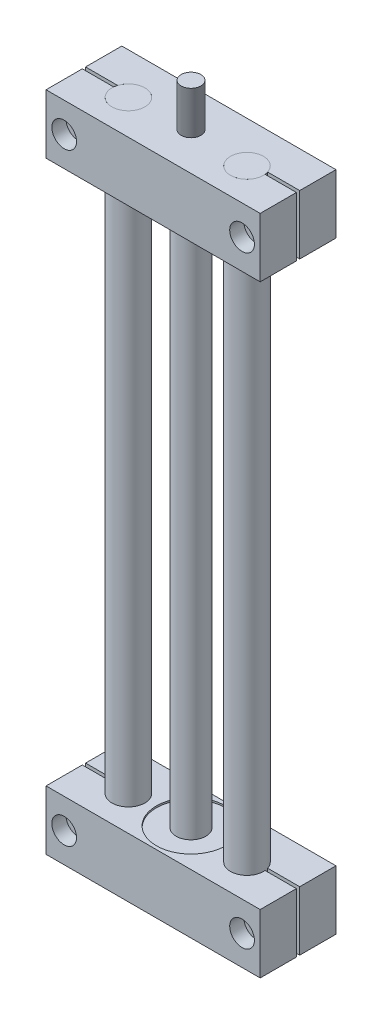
ISO-10303-21;
HEADER;
FILE_DESCRIPTION(('STEP AP214'),'2;1');
FILE_NAME('part.step','',(''),(''),'','','');
FILE_SCHEMA(('AUTOMOTIVE_DESIGN { 1 0 10303 214 1 1 1 1 }'));
ENDSEC;
DATA;
#1=APPLICATION_CONTEXT('core data for automotive mechanical design processes');
#2=APPLICATION_PROTOCOL_DEFINITION('international standard','automotive_design',2000,#1);
#3=PRODUCT_CONTEXT('',#1,'mechanical');
#4=PRODUCT('Part','Part','',(#3));
#5=PRODUCT_RELATED_PRODUCT_CATEGORY('part','',(#4));
#6=PRODUCT_DEFINITION_FORMATION('','',#4);
#7=PRODUCT_DEFINITION_CONTEXT('part definition',#1,'design');
#8=PRODUCT_DEFINITION('design','',#6,#7);
#9=PRODUCT_DEFINITION_SHAPE('','',#8);
#10=(LENGTH_UNIT() NAMED_UNIT(*) SI_UNIT(.MILLI.,.METRE.));
#11=(NAMED_UNIT(*) PLANE_ANGLE_UNIT() SI_UNIT($,.RADIAN.));
#12=(NAMED_UNIT(*) SI_UNIT($,.STERADIAN.) SOLID_ANGLE_UNIT());
#13=UNCERTAINTY_MEASURE_WITH_UNIT(LENGTH_MEASURE(1.E-05),#10,'distance_accuracy_value','');
#14=(GEOMETRIC_REPRESENTATION_CONTEXT(3) GLOBAL_UNCERTAINTY_ASSIGNED_CONTEXT((#13)) GLOBAL_UNIT_ASSIGNED_CONTEXT((#10,
#11,#12)) REPRESENTATION_CONTEXT('',''));
#15=CARTESIAN_POINT('',(0.,0.,0.));
#16=DIRECTION('',(0.,0.,1.));
#17=DIRECTION('',(1.,0.,0.));
#18=AXIS2_PLACEMENT_3D('',#15,#16,#17);
#19=CARTESIAN_POINT('',(-54.,6.5,40.0000000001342));
#20=DIRECTION('',(0.,0.,-1.));
#21=DIRECTION('',(-1.,0.,0.));
#22=AXIS2_PLACEMENT_3D('',#19,#20,#21);
#23=CONICAL_SURFACE('',#22,2.49999999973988,1.04719755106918);
#24=DIRECTION('',(-0.86602540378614,0.,0.499999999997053));
#25=VECTOR('',#24,1.);
#26=CARTESIAN_POINT('',(498892.,6.5000000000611,-288025.16403315));
#27=LINE('',#26,#25);
#28=CARTESIAN_POINT('',(-53.9999999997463,6.5,41.443375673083));
#29=VERTEX_POINT('',#28);
#30=CARTESIAN_POINT('',(-51.5000000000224,6.5,40.0000000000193));
#31=VERTEX_POINT('',#30);
#32=EDGE_CURVE('P0_E606',#29,#31,#27,.F.);
#33=ORIENTED_EDGE('',*,*,#32,.T.);
#34=CARTESIAN_POINT('',(-54.,6.5,40.));
#35=DIRECTION('',(0.,0.,-1.));
#36=DIRECTION('',(-1.,0.,0.));
#37=AXIS2_PLACEMENT_3D('',#34,#35,#36);
#38=CIRCLE('',#37,2.5);
#39=CARTESIAN_POINT('',(-56.4999999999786,6.5,40.0000000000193));
#40=VERTEX_POINT('',#39);
#41=EDGE_CURVE('P0_E562',#31,#40,#38,.T.);
#42=ORIENTED_EDGE('',*,*,#41,.T.);
#43=DIRECTION('',(0.86602540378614,0.,0.499999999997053));
#44=VECTOR('',#43,1.);
#45=CARTESIAN_POINT('',(-499000.,6.5,-288025.16403315));
#46=LINE('',#45,#44);
#47=EDGE_CURVE('P0_E593',#40,#29,#46,.T.);
#48=ORIENTED_EDGE('',*,*,#47,.T.);
#49=EDGE_LOOP('',(#33,#42,#48));
#50=FACE_BOUND('',#49,.T.);
#51=ADVANCED_FACE('P0_F17',(#50),#23,.F.);
#52=CARTESIAN_POINT('',(-54.,6.5,40.0000000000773));
#53=DIRECTION('',(0.,0.,-1.));
#54=DIRECTION('',(-1.,0.,0.));
#55=AXIS2_PLACEMENT_3D('',#52,#53,#54);
#56=CONICAL_SURFACE('',#55,2.49999999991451,1.04719755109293);
#57=CARTESIAN_POINT('',(-54.,6.5,40.));
#58=DIRECTION('',(0.,0.,-1.));
#59=DIRECTION('',(-1.,0.,0.));
#60=AXIS2_PLACEMENT_3D('',#57,#58,#59);
#61=CIRCLE('',#60,2.5);
#62=EDGE_CURVE('P0_E584',#40,#31,#61,.T.);
#63=ORIENTED_EDGE('',*,*,#62,.T.);
#64=ORIENTED_EDGE('',*,*,#32,.F.);
#65=ORIENTED_EDGE('',*,*,#47,.F.);
#66=EDGE_LOOP('',(#63,#64,#65));
#67=FACE_BOUND('',#66,.T.);
#68=ADVANCED_FACE('P0_F894',(#67),#56,.F.);
#69=CARTESIAN_POINT('',(-54.,29.5,40.0000000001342));
#70=DIRECTION('',(0.,0.,-1.));
#71=DIRECTION('',(-1.,0.,0.));
#72=AXIS2_PLACEMENT_3D('',#69,#70,#71);
#73=CONICAL_SURFACE('',#72,2.49999999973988,1.04719755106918);
#74=DIRECTION('',(-0.86602540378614,0.,0.499999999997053));
#75=VECTOR('',#74,1.);
#76=CARTESIAN_POINT('',(498892.,29.5000000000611,-288025.16403315));
#77=LINE('',#76,#75);
#78=CARTESIAN_POINT('',(-53.9999999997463,29.5,41.443375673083));
#79=VERTEX_POINT('',#78);
#80=CARTESIAN_POINT('',(-51.5000000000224,29.5,40.0000000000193));
#81=VERTEX_POINT('',#80);
#82=EDGE_CURVE('P0_E591',#79,#81,#77,.F.);
#83=ORIENTED_EDGE('',*,*,#82,.T.);
#84=CARTESIAN_POINT('',(-54.,29.5,40.));
#85=DIRECTION('',(0.,0.,-1.));
#86=DIRECTION('',(-1.,0.,0.));
#87=AXIS2_PLACEMENT_3D('',#84,#85,#86);
#88=CIRCLE('',#87,2.5);
#89=CARTESIAN_POINT('',(-56.4999999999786,29.5,40.0000000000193));
#90=VERTEX_POINT('',#89);
#91=EDGE_CURVE('P0_E582',#81,#90,#88,.T.);
#92=ORIENTED_EDGE('',*,*,#91,.T.);
#93=DIRECTION('',(0.86602540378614,0.,0.499999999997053));
#94=VECTOR('',#93,1.);
#95=CARTESIAN_POINT('',(-499000.,29.5,-288025.16403315));
#96=LINE('',#95,#94);
#97=EDGE_CURVE('P0_E576',#90,#79,#96,.T.);
#98=ORIENTED_EDGE('',*,*,#97,.T.);
#99=EDGE_LOOP('',(#83,#92,#98));
#100=FACE_BOUND('',#99,.T.);
#101=ADVANCED_FACE('P0_F891',(#100),#73,.F.);
#102=CARTESIAN_POINT('',(-54.,29.5,40.0000000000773));
#103=DIRECTION('',(0.,0.,-1.));
#104=DIRECTION('',(-1.,0.,0.));
#105=AXIS2_PLACEMENT_3D('',#102,#103,#104);
#106=CONICAL_SURFACE('',#105,2.49999999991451,1.04719755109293);
#107=CARTESIAN_POINT('',(-54.,29.5,40.));
#108=DIRECTION('',(0.,0.,-1.));
#109=DIRECTION('',(-1.,0.,0.));
#110=AXIS2_PLACEMENT_3D('',#107,#108,#109);
#111=CIRCLE('',#110,2.5);
#112=EDGE_CURVE('P0_E567',#90,#81,#111,.T.);
#113=ORIENTED_EDGE('',*,*,#112,.T.);
#114=ORIENTED_EDGE('',*,*,#82,.F.);
#115=ORIENTED_EDGE('',*,*,#97,.F.);
#116=EDGE_LOOP('',(#113,#114,#115));
#117=FACE_BOUND('',#116,.T.);
#118=ADVANCED_FACE('P0_F887',(#117),#106,.F.);
#119=CARTESIAN_POINT('',(54.,6.5,40.0000000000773));
#120=DIRECTION('',(0.,0.,-1.));
#121=DIRECTION('',(-1.,0.,0.));
#122=AXIS2_PLACEMENT_3D('',#119,#120,#121);
#123=CONICAL_SURFACE('',#122,2.49999999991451,1.04719755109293);
#124=DIRECTION('',(-0.86602540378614,0.,0.499999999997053));
#125=VECTOR('',#124,1.);
#126=CARTESIAN_POINT('',(499108.,6.50000000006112,-288087.517862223));
#127=LINE('',#126,#125);
#128=CARTESIAN_POINT('',(54.0000000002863,6.5,41.4433756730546));
#129=VERTEX_POINT('',#128);
#130=CARTESIAN_POINT('',(56.499999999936,6.5,40.0000000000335));
#131=VERTEX_POINT('',#130);
#132=EDGE_CURVE('P0_E574',#129,#131,#127,.F.);
#133=ORIENTED_EDGE('',*,*,#132,.T.);
#134=CARTESIAN_POINT('',(54.,6.5,40.));
#135=DIRECTION('',(0.,0.,-1.));
#136=DIRECTION('',(-1.,0.,0.));
#137=AXIS2_PLACEMENT_3D('',#134,#135,#136);
#138=CIRCLE('',#137,2.5);
#139=CARTESIAN_POINT('',(51.5000000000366,6.5,40.0000000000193));
#140=VERTEX_POINT('',#139);
#141=EDGE_CURVE('P0_E565',#131,#140,#138,.T.);
#142=ORIENTED_EDGE('',*,*,#141,.T.);
#143=DIRECTION('',(0.86602540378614,0.,0.499999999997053));
#144=VECTOR('',#143,1.);
#145=CARTESIAN_POINT('',(-499000.,6.5,-288087.517862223));
#146=LINE('',#145,#144);
#147=EDGE_CURVE('P0_E558',#140,#129,#146,.T.);
#148=ORIENTED_EDGE('',*,*,#147,.T.);
#149=EDGE_LOOP('',(#133,#142,#148));
#150=FACE_BOUND('',#149,.T.);
#151=ADVANCED_FACE('P0_F883',(#150),#123,.F.);
#152=CARTESIAN_POINT('',(54.,6.5,40.0000000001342));
#153=DIRECTION('',(0.,0.,-1.));
#154=DIRECTION('',(-1.,0.,0.));
#155=AXIS2_PLACEMENT_3D('',#152,#153,#154);
#156=CONICAL_SURFACE('',#155,2.49999999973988,1.04719755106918);
#157=CARTESIAN_POINT('',(54.,6.5,40.));
#158=DIRECTION('',(0.,0.,-1.));
#159=DIRECTION('',(-1.,0.,0.));
#160=AXIS2_PLACEMENT_3D('',#157,#158,#159);
#161=CIRCLE('',#160,2.5);
#162=EDGE_CURVE('P0_E548',#140,#131,#161,.T.);
#163=ORIENTED_EDGE('',*,*,#162,.T.);
#164=ORIENTED_EDGE('',*,*,#132,.F.);
#165=ORIENTED_EDGE('',*,*,#147,.F.);
#166=EDGE_LOOP('',(#163,#164,#165));
#167=FACE_BOUND('',#166,.T.);
#168=ADVANCED_FACE('P0_F879',(#167),#156,.F.);
#169=CARTESIAN_POINT('',(54.,29.5,40.0000000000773));
#170=DIRECTION('',(0.,0.,-1.));
#171=DIRECTION('',(-1.,0.,0.));
#172=AXIS2_PLACEMENT_3D('',#169,#170,#171);
#173=CONICAL_SURFACE('',#172,2.49999999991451,1.04719755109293);
#174=DIRECTION('',(-0.86602540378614,0.,0.499999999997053));
#175=VECTOR('',#174,1.);
#176=CARTESIAN_POINT('',(499108.,29.5000000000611,-288087.517862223));
#177=LINE('',#176,#175);
#178=CARTESIAN_POINT('',(54.0000000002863,29.5,41.4433756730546));
#179=VERTEX_POINT('',#178);
#180=CARTESIAN_POINT('',(56.499999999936,29.5,40.0000000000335));
#181=VERTEX_POINT('',#180);
#182=EDGE_CURVE('P0_E555',#179,#181,#177,.F.);
#183=ORIENTED_EDGE('',*,*,#182,.T.);
#184=CARTESIAN_POINT('',(54.,29.5,40.));
#185=DIRECTION('',(0.,0.,-1.));
#186=DIRECTION('',(-1.,0.,0.));
#187=AXIS2_PLACEMENT_3D('',#184,#185,#186);
#188=CIRCLE('',#187,2.5);
#189=CARTESIAN_POINT('',(51.5000000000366,29.5,40.0000000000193));
#190=VERTEX_POINT('',#189);
#191=EDGE_CURVE('P0_E545',#181,#190,#188,.T.);
#192=ORIENTED_EDGE('',*,*,#191,.T.);
#193=DIRECTION('',(0.86602540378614,0.,0.499999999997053));
#194=VECTOR('',#193,1.);
#195=CARTESIAN_POINT('',(-499000.,29.5,-288087.517862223));
#196=LINE('',#195,#194);
#197=EDGE_CURVE('P0_E557',#190,#179,#196,.T.);
#198=ORIENTED_EDGE('',*,*,#197,.T.);
#199=EDGE_LOOP('',(#183,#192,#198));
#200=FACE_BOUND('',#199,.T.);
#201=ADVANCED_FACE('P0_F871',(#200),#173,.F.);
#202=CARTESIAN_POINT('',(54.,29.5,40.0000000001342));
#203=DIRECTION('',(0.,0.,-1.));
#204=DIRECTION('',(-1.,0.,0.));
#205=AXIS2_PLACEMENT_3D('',#202,#203,#204);
#206=CONICAL_SURFACE('',#205,2.49999999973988,1.04719755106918);
#207=CARTESIAN_POINT('',(54.,29.5,40.));
#208=DIRECTION('',(0.,0.,-1.));
#209=DIRECTION('',(-1.,0.,0.));
#210=AXIS2_PLACEMENT_3D('',#207,#208,#209);
#211=CIRCLE('',#210,2.5);
#212=EDGE_CURVE('P0_E547',#190,#181,#211,.T.);
#213=ORIENTED_EDGE('',*,*,#212,.T.);
#214=ORIENTED_EDGE('',*,*,#182,.F.);
#215=ORIENTED_EDGE('',*,*,#197,.F.);
#216=EDGE_LOOP('',(#213,#214,#215));
#217=FACE_BOUND('',#216,.T.);
#218=ADVANCED_FACE('P0_F861',(#217),#206,.F.);
#219=CARTESIAN_POINT('',(-54.,6.5,38.));
#220=DIRECTION('',(0.,0.,-1.));
#221=DIRECTION('',(-1.,0.,0.));
#222=AXIS2_PLACEMENT_3D('',#219,#220,#221);
#223=CYLINDRICAL_SURFACE('',#222,2.5);
#224=ORIENTED_EDGE('',*,*,#62,.F.);
#225=ORIENTED_EDGE('',*,*,#41,.F.);
#226=EDGE_LOOP('',(#224,#225));
#227=FACE_BOUND('',#226,.T.);
#228=CARTESIAN_POINT('',(-54.,6.5,36.));
#229=DIRECTION('',(0.,0.,-1.));
#230=DIRECTION('',(-1.,0.,0.));
#231=AXIS2_PLACEMENT_3D('',#228,#229,#230);
#232=CIRCLE('',#231,2.5);
#233=CARTESIAN_POINT('',(-56.5,6.5,36.));
#234=VERTEX_POINT('',#233);
#235=EDGE_CURVE('P0_E20',#234,#234,#232,.F.);
#236=ORIENTED_EDGE('',*,*,#235,.F.);
#237=EDGE_LOOP('',(#236));
#238=FACE_BOUND('',#237,.T.);
#239=ADVANCED_FACE('P0_F858',(#227,#238),#223,.F.);
#240=CARTESIAN_POINT('',(-54.,29.5,38.));
#241=DIRECTION('',(0.,0.,-1.));
#242=DIRECTION('',(-1.,0.,0.));
#243=AXIS2_PLACEMENT_3D('',#240,#241,#242);
#244=CYLINDRICAL_SURFACE('',#243,2.5);
#245=ORIENTED_EDGE('',*,*,#112,.F.);
#246=ORIENTED_EDGE('',*,*,#91,.F.);
#247=EDGE_LOOP('',(#245,#246));
#248=FACE_BOUND('',#247,.T.);
#249=CARTESIAN_POINT('',(-54.,29.5,36.));
#250=DIRECTION('',(0.,0.,-1.));
#251=DIRECTION('',(-1.,0.,0.));
#252=AXIS2_PLACEMENT_3D('',#249,#250,#251);
#253=CIRCLE('',#252,2.5);
#254=CARTESIAN_POINT('',(-56.5,29.5,36.));
#255=VERTEX_POINT('',#254);
#256=EDGE_CURVE('P0_E849',#255,#255,#253,.F.);
#257=ORIENTED_EDGE('',*,*,#256,.F.);
#258=EDGE_LOOP('',(#257));
#259=FACE_BOUND('',#258,.T.);
#260=ADVANCED_FACE('P0_F860',(#248,#259),#244,.F.);
#261=CARTESIAN_POINT('',(54.,6.5,38.));
#262=DIRECTION('',(0.,0.,-1.));
#263=DIRECTION('',(-1.,0.,0.));
#264=AXIS2_PLACEMENT_3D('',#261,#262,#263);
#265=CYLINDRICAL_SURFACE('',#264,2.5);
#266=ORIENTED_EDGE('',*,*,#162,.F.);
#267=ORIENTED_EDGE('',*,*,#141,.F.);
#268=EDGE_LOOP('',(#266,#267));
#269=FACE_BOUND('',#268,.T.);
#270=CARTESIAN_POINT('',(54.,6.5,36.));
#271=DIRECTION('',(0.,0.,-1.));
#272=DIRECTION('',(-1.,0.,0.));
#273=AXIS2_PLACEMENT_3D('',#270,#271,#272);
#274=CIRCLE('',#273,2.5);
#275=CARTESIAN_POINT('',(51.5,6.5,36.));
#276=VERTEX_POINT('',#275);
#277=EDGE_CURVE('P0_E847',#276,#276,#274,.F.);
#278=ORIENTED_EDGE('',*,*,#277,.F.);
#279=EDGE_LOOP('',(#278));
#280=FACE_BOUND('',#279,.T.);
#281=ADVANCED_FACE('P0_F868',(#269,#280),#265,.F.);
#282=CARTESIAN_POINT('',(54.,29.5,38.));
#283=DIRECTION('',(0.,0.,-1.));
#284=DIRECTION('',(-1.,0.,0.));
#285=AXIS2_PLACEMENT_3D('',#282,#283,#284);
#286=CYLINDRICAL_SURFACE('',#285,2.5);
#287=ORIENTED_EDGE('',*,*,#212,.F.);
#288=ORIENTED_EDGE('',*,*,#191,.F.);
#289=EDGE_LOOP('',(#287,#288));
#290=FACE_BOUND('',#289,.T.);
#291=CARTESIAN_POINT('',(54.,29.5,36.));
#292=DIRECTION('',(0.,0.,-1.));
#293=DIRECTION('',(-1.,0.,0.));
#294=AXIS2_PLACEMENT_3D('',#291,#292,#293);
#295=CIRCLE('',#294,2.5);
#296=CARTESIAN_POINT('',(51.5,29.5,36.));
#297=VERTEX_POINT('',#296);
#298=EDGE_CURVE('P0_E844',#297,#297,#295,.F.);
#299=ORIENTED_EDGE('',*,*,#298,.F.);
#300=EDGE_LOOP('',(#299));
#301=FACE_BOUND('',#300,.T.);
#302=ADVANCED_FACE('P0_F951',(#290,#301),#286,.F.);
#303=CARTESIAN_POINT('',(-51.2525,6.5,36.));
#304=DIRECTION('',(0.,0.,1.));
#305=DIRECTION('',(1.,0.,0.));
#306=AXIS2_PLACEMENT_3D('',#303,#304,#305);
#307=PLANE('',#306);
#308=CARTESIAN_POINT('',(-54.,6.5,36.));
#309=DIRECTION('',(0.,0.,-1.));
#310=DIRECTION('',(-1.,0.,0.));
#311=AXIS2_PLACEMENT_3D('',#308,#309,#310);
#312=CIRCLE('',#311,2.495);
#313=CARTESIAN_POINT('',(-56.495,6.5,36.));
#314=VERTEX_POINT('',#313);
#315=EDGE_CURVE('P0_E841',#314,#314,#312,.T.);
#316=ORIENTED_EDGE('',*,*,#315,.T.);
#317=EDGE_LOOP('',(#316));
#318=FACE_BOUND('',#317,.T.);
#319=ORIENTED_EDGE('',*,*,#235,.T.);
#320=EDGE_LOOP('',(#319));
#321=FACE_BOUND('',#320,.T.);
#322=ADVANCED_FACE('P0_F856',(#318,#321),#307,.T.);
#323=CARTESIAN_POINT('',(-51.2525,29.5,36.));
#324=DIRECTION('',(0.,0.,1.));
#325=DIRECTION('',(1.,0.,0.));
#326=AXIS2_PLACEMENT_3D('',#323,#324,#325);
#327=PLANE('',#326);
#328=CARTESIAN_POINT('',(-54.,29.5,36.));
#329=DIRECTION('',(0.,0.,-1.));
#330=DIRECTION('',(-1.,0.,0.));
#331=AXIS2_PLACEMENT_3D('',#328,#329,#330);
#332=CIRCLE('',#331,2.495);
#333=CARTESIAN_POINT('',(-56.495,29.5,36.));
#334=VERTEX_POINT('',#333);
#335=EDGE_CURVE('P0_E838',#334,#334,#332,.T.);
#336=ORIENTED_EDGE('',*,*,#335,.T.);
#337=EDGE_LOOP('',(#336));
#338=FACE_BOUND('',#337,.T.);
#339=ORIENTED_EDGE('',*,*,#256,.T.);
#340=EDGE_LOOP('',(#339));
#341=FACE_BOUND('',#340,.T.);
#342=ADVANCED_FACE('P0_F965',(#338,#341),#327,.T.);
#343=CARTESIAN_POINT('',(56.7475,6.5,36.));
#344=DIRECTION('',(0.,0.,1.));
#345=DIRECTION('',(1.,0.,0.));
#346=AXIS2_PLACEMENT_3D('',#343,#344,#345);
#347=PLANE('',#346);
#348=CARTESIAN_POINT('',(54.,6.5,36.));
#349=DIRECTION('',(0.,0.,-1.));
#350=DIRECTION('',(-1.,0.,0.));
#351=AXIS2_PLACEMENT_3D('',#348,#349,#350);
#352=CIRCLE('',#351,2.495);
#353=CARTESIAN_POINT('',(51.505,6.5,36.));
#354=VERTEX_POINT('',#353);
#355=EDGE_CURVE('P0_E835',#354,#354,#352,.T.);
#356=ORIENTED_EDGE('',*,*,#355,.T.);
#357=EDGE_LOOP('',(#356));
#358=FACE_BOUND('',#357,.T.);
#359=ORIENTED_EDGE('',*,*,#277,.T.);
#360=EDGE_LOOP('',(#359));
#361=FACE_BOUND('',#360,.T.);
#362=ADVANCED_FACE('P0_F973',(#358,#361),#347,.T.);
#363=CARTESIAN_POINT('',(56.7475,29.5,36.));
#364=DIRECTION('',(0.,0.,1.));
#365=DIRECTION('',(1.,0.,0.));
#366=AXIS2_PLACEMENT_3D('',#363,#364,#365);
#367=PLANE('',#366);
#368=CARTESIAN_POINT('',(54.,29.5,36.));
#369=DIRECTION('',(0.,0.,-1.));
#370=DIRECTION('',(-1.,0.,0.));
#371=AXIS2_PLACEMENT_3D('',#368,#369,#370);
#372=CIRCLE('',#371,2.495);
#373=CARTESIAN_POINT('',(51.505,29.5,36.));
#374=VERTEX_POINT('',#373);
#375=EDGE_CURVE('P0_E832',#374,#374,#372,.T.);
#376=ORIENTED_EDGE('',*,*,#375,.T.);
#377=EDGE_LOOP('',(#376));
#378=FACE_BOUND('',#377,.T.);
#379=ORIENTED_EDGE('',*,*,#298,.T.);
#380=EDGE_LOOP('',(#379));
#381=FACE_BOUND('',#380,.T.);
#382=ADVANCED_FACE('P0_F981',(#378,#381),#367,.T.);
#383=CARTESIAN_POINT('',(54.,18.,11.));
#384=DIRECTION('',(0.,0.,-1.));
#385=DIRECTION('',(0.,1.,0.));
#386=AXIS2_PLACEMENT_3D('',#383,#384,#385);
#387=CYLINDRICAL_SURFACE('',#386,4.);
#388=CARTESIAN_POINT('',(54.,18.,1.0000000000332));
#389=DIRECTION('',(0.,0.,-1.));
#390=DIRECTION('',(-1.,0.,0.));
#391=AXIS2_PLACEMENT_3D('',#388,#389,#390);
#392=CIRCLE('',#391,3.99999999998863);
#393=CARTESIAN_POINT('',(50.0000000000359,18.,1.0000000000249));
#394=VERTEX_POINT('',#393);
#395=CARTESIAN_POINT('',(57.9999999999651,18.,1.0000000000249));
#396=VERTEX_POINT('',#395);
#397=EDGE_CURVE('P0_E461',#394,#396,#392,.T.);
#398=ORIENTED_EDGE('',*,*,#397,.T.);
#399=CARTESIAN_POINT('',(54.,18.,0.999999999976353));
#400=DIRECTION('',(0.,0.,-1.));
#401=DIRECTION('',(1.,0.,0.));
#402=AXIS2_PLACEMENT_3D('',#399,#400,#401);
#403=CIRCLE('',#402,3.99999999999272);
#404=EDGE_CURVE('P0_E477',#396,#394,#403,.T.);
#405=ORIENTED_EDGE('',*,*,#404,.T.);
#406=EDGE_LOOP('',(#398,#405));
#407=FACE_BOUND('',#406,.T.);
#408=CARTESIAN_POINT('',(54.,18.,21.000000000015));
#409=DIRECTION('',(0.,0.,1.));
#410=DIRECTION('',(-1.,0.,0.));
#411=AXIS2_PLACEMENT_3D('',#408,#409,#410);
#412=CIRCLE('',#411,4.00000000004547);
#413=CARTESIAN_POINT('',(50.0000000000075,18.,20.999999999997));
#414=VERTEX_POINT('',#413);
#415=CARTESIAN_POINT('',(57.9999999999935,18.,20.999999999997));
#416=VERTEX_POINT('',#415);
#417=EDGE_CURVE('P0_E489',#414,#416,#412,.T.);
#418=ORIENTED_EDGE('',*,*,#417,.T.);
#419=CARTESIAN_POINT('',(54.,18.,21.000000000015));
#420=DIRECTION('',(0.,0.,1.));
#421=DIRECTION('',(1.,0.,0.));
#422=AXIS2_PLACEMENT_3D('',#419,#420,#421);
#423=CIRCLE('',#422,3.99999999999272);
#424=EDGE_CURVE('P0_E483',#416,#414,#423,.T.);
#425=ORIENTED_EDGE('',*,*,#424,.T.);
#426=EDGE_LOOP('',(#418,#425));
#427=FACE_BOUND('',#426,.T.);
#428=ADVANCED_FACE('P0_F989',(#407,#427),#387,.F.);
#429=CARTESIAN_POINT('',(58.4,6.5,6.4));
#430=DIRECTION('',(0.,0.,1.));
#431=DIRECTION('',(0.,-1.,0.));
#432=AXIS2_PLACEMENT_3D('',#429,#430,#431);
#433=PLANE('',#432);
#434=CARTESIAN_POINT('',(54.,6.5,6.39999999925));
#435=DIRECTION('',(0.,0.,-1.));
#436=DIRECTION('',(0.,1.,0.));
#437=AXIS2_PLACEMENT_3D('',#434,#435,#436);
#438=CIRCLE('',#437,3.3);
#439=CARTESIAN_POINT('',(54.,9.8,6.39999999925));
#440=VERTEX_POINT('',#439);
#441=EDGE_CURVE('P0_E482',#440,#440,#438,.F.);
#442=ORIENTED_EDGE('',*,*,#441,.T.);
#443=EDGE_LOOP('',(#442));
#444=FACE_BOUND('',#443,.T.);
#445=CARTESIAN_POINT('',(54.,6.5,6.39999999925));
#446=DIRECTION('',(0.,0.,-1.));
#447=DIRECTION('',(0.,1.,0.));
#448=AXIS2_PLACEMENT_3D('',#445,#446,#447);
#449=CIRCLE('',#448,5.5);
#450=CARTESIAN_POINT('',(54.,12.,6.39999999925));
#451=VERTEX_POINT('',#450);
#452=EDGE_CURVE('P0_E818',#451,#451,#449,.T.);
#453=ORIENTED_EDGE('',*,*,#452,.T.);
#454=EDGE_LOOP('',(#453));
#455=FACE_BOUND('',#454,.T.);
#456=ADVANCED_FACE('P0_F997',(#444,#455),#433,.F.);
#457=CARTESIAN_POINT('',(58.4,29.5,6.4));
#458=DIRECTION('',(0.,0.,1.));
#459=DIRECTION('',(0.,-1.,0.));
#460=AXIS2_PLACEMENT_3D('',#457,#458,#459);
#461=PLANE('',#460);
#462=CARTESIAN_POINT('',(54.,29.5,6.39999999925));
#463=DIRECTION('',(0.,0.,-1.));
#464=DIRECTION('',(0.,1.,0.));
#465=AXIS2_PLACEMENT_3D('',#462,#463,#464);
#466=CIRCLE('',#465,3.3);
#467=CARTESIAN_POINT('',(54.,32.8,6.39999999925));
#468=VERTEX_POINT('',#467);
#469=EDGE_CURVE('P0_E532',#468,#468,#466,.F.);
#470=ORIENTED_EDGE('',*,*,#469,.T.);
#471=EDGE_LOOP('',(#470));
#472=FACE_BOUND('',#471,.T.);
#473=CARTESIAN_POINT('',(54.,29.5,6.39999999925));
#474=DIRECTION('',(0.,0.,-1.));
#475=DIRECTION('',(0.,1.,0.));
#476=AXIS2_PLACEMENT_3D('',#473,#474,#475);
#477=CIRCLE('',#476,5.5);
#478=CARTESIAN_POINT('',(54.,35.,6.39999999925));
#479=VERTEX_POINT('',#478);
#480=EDGE_CURVE('P0_E518',#479,#479,#477,.T.);
#481=ORIENTED_EDGE('',*,*,#480,.T.);
#482=EDGE_LOOP('',(#481));
#483=FACE_BOUND('',#482,.T.);
#484=ADVANCED_FACE('P0_F1005',(#472,#483),#461,.F.);
#485=CARTESIAN_POINT('',(-54.,18.,11.));
#486=DIRECTION('',(0.,0.,-1.));
#487=DIRECTION('',(0.,1.,0.));
#488=AXIS2_PLACEMENT_3D('',#485,#486,#487);
#489=CYLINDRICAL_SURFACE('',#488,4.);
#490=CARTESIAN_POINT('',(-54.,18.,0.999999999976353));
#491=DIRECTION('',(0.,0.,-1.));
#492=DIRECTION('',(-1.,0.,0.));
#493=AXIS2_PLACEMENT_3D('',#490,#491,#492);
#494=CIRCLE('',#493,3.99999999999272);
#495=CARTESIAN_POINT('',(-57.9999999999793,18.,1.00000000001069));
#496=VERTEX_POINT('',#495);
#497=CARTESIAN_POINT('',(-50.0000000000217,18.,1.00000000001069));
#498=VERTEX_POINT('',#497);
#499=EDGE_CURVE('P0_E472',#496,#498,#494,.T.);
#500=ORIENTED_EDGE('',*,*,#499,.T.);
#501=CARTESIAN_POINT('',(-54.,18.,1.0000000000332));
#502=DIRECTION('',(0.,0.,-1.));
#503=DIRECTION('',(1.,0.,0.));
#504=AXIS2_PLACEMENT_3D('',#501,#502,#503);
#505=CIRCLE('',#504,3.99999999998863);
#506=EDGE_CURVE('P0_E530',#498,#496,#505,.T.);
#507=ORIENTED_EDGE('',*,*,#506,.T.);
#508=EDGE_LOOP('',(#500,#507));
#509=FACE_BOUND('',#508,.T.);
#510=CARTESIAN_POINT('',(-54.,18.,21.000000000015));
#511=DIRECTION('',(0.,0.,1.));
#512=DIRECTION('',(-1.,0.,0.));
#513=AXIS2_PLACEMENT_3D('',#510,#511,#512);
#514=CIRCLE('',#513,3.99999999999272);
#515=CARTESIAN_POINT('',(-58.0000000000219,18.,21.0000000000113));
#516=VERTEX_POINT('',#515);
#517=CARTESIAN_POINT('',(-49.9999999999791,18.,21.000000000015));
#518=VERTEX_POINT('',#517);
#519=EDGE_CURVE('P0_E455',#516,#518,#514,.T.);
#520=ORIENTED_EDGE('',*,*,#519,.T.);
#521=CARTESIAN_POINT('',(-54.,18.,21.000000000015));
#522=DIRECTION('',(0.,0.,1.));
#523=DIRECTION('',(1.,0.,0.));
#524=AXIS2_PLACEMENT_3D('',#521,#522,#523);
#525=CIRCLE('',#524,4.00000000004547);
#526=EDGE_CURVE('P0_E449',#518,#516,#525,.T.);
#527=ORIENTED_EDGE('',*,*,#526,.T.);
#528=EDGE_LOOP('',(#520,#527));
#529=FACE_BOUND('',#528,.T.);
#530=ADVANCED_FACE('P0_F1013',(#509,#529),#489,.F.);
#531=CARTESIAN_POINT('',(-49.6,6.5,6.4));
#532=DIRECTION('',(0.,0.,1.));
#533=DIRECTION('',(0.,-1.,0.));
#534=AXIS2_PLACEMENT_3D('',#531,#532,#533);
#535=PLANE('',#534);
#536=CARTESIAN_POINT('',(-54.,6.5,6.39999999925));
#537=DIRECTION('',(0.,0.,-1.));
#538=DIRECTION('',(0.,1.,0.));
#539=AXIS2_PLACEMENT_3D('',#536,#537,#538);
#540=CIRCLE('',#539,3.3);
#541=CARTESIAN_POINT('',(-54.,9.8,6.39999999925));
#542=VERTEX_POINT('',#541);
#543=EDGE_CURVE('P0_E448',#542,#542,#540,.F.);
#544=ORIENTED_EDGE('',*,*,#543,.T.);
#545=EDGE_LOOP('',(#544));
#546=FACE_BOUND('',#545,.T.);
#547=CARTESIAN_POINT('',(-54.,6.5,6.39999999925));
#548=DIRECTION('',(0.,0.,-1.));
#549=DIRECTION('',(0.,1.,0.));
#550=AXIS2_PLACEMENT_3D('',#547,#548,#549);
#551=CIRCLE('',#550,5.5);
#552=CARTESIAN_POINT('',(-54.,12.,6.39999999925));
#553=VERTEX_POINT('',#552);
#554=EDGE_CURVE('P0_E466',#553,#553,#551,.T.);
#555=ORIENTED_EDGE('',*,*,#554,.T.);
#556=EDGE_LOOP('',(#555));
#557=FACE_BOUND('',#556,.T.);
#558=ADVANCED_FACE('P0_F1021',(#546,#557),#535,.F.);
#559=CARTESIAN_POINT('',(-49.6,29.5,6.4));
#560=DIRECTION('',(0.,0.,1.));
#561=DIRECTION('',(0.,-1.,0.));
#562=AXIS2_PLACEMENT_3D('',#559,#560,#561);
#563=PLANE('',#562);
#564=CARTESIAN_POINT('',(-54.,29.5,6.39999999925));
#565=DIRECTION('',(0.,0.,-1.));
#566=DIRECTION('',(0.,1.,0.));
#567=AXIS2_PLACEMENT_3D('',#564,#565,#566);
#568=CIRCLE('',#567,3.3);
#569=CARTESIAN_POINT('',(-54.,32.8,6.39999999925));
#570=VERTEX_POINT('',#569);
#571=EDGE_CURVE('P0_E511',#570,#570,#568,.F.);
#572=ORIENTED_EDGE('',*,*,#571,.T.);
#573=EDGE_LOOP('',(#572));
#574=FACE_BOUND('',#573,.T.);
#575=CARTESIAN_POINT('',(-54.,29.5,6.39999999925));
#576=DIRECTION('',(0.,0.,-1.));
#577=DIRECTION('',(0.,1.,0.));
#578=AXIS2_PLACEMENT_3D('',#575,#576,#577);
#579=CIRCLE('',#578,5.5);
#580=CARTESIAN_POINT('',(-54.,35.,6.39999999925));
#581=VERTEX_POINT('',#580);
#582=EDGE_CURVE('P0_E821',#581,#581,#579,.T.);
#583=ORIENTED_EDGE('',*,*,#582,.T.);
#584=EDGE_LOOP('',(#583));
#585=FACE_BOUND('',#584,.T.);
#586=ADVANCED_FACE('P0_F1029',(#574,#585),#563,.F.);
#587=CARTESIAN_POINT('',(-54.,6.5,30.2525));
#588=DIRECTION('',(0.,0.,-1.));
#589=DIRECTION('',(-1.,0.,0.));
#590=AXIS2_PLACEMENT_3D('',#587,#588,#589);
#591=CYLINDRICAL_SURFACE('',#590,2.495);
#592=ORIENTED_EDGE('',*,*,#315,.F.);
#593=EDGE_LOOP('',(#592));
#594=FACE_BOUND('',#593,.T.);
#595=CARTESIAN_POINT('',(-54.,6.5,24.5050000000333));
#596=DIRECTION('',(0.,0.,-1.));
#597=DIRECTION('',(1.,0.,0.));
#598=AXIS2_PLACEMENT_3D('',#595,#596,#597);
#599=CIRCLE('',#598,2.49500000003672);
#600=CARTESIAN_POINT('',(-51.5049999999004,6.5,24.5049999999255));
#601=VERTEX_POINT('',#600);
#602=CARTESIAN_POINT('',(-56.4950000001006,6.5,24.5049999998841));
#603=VERTEX_POINT('',#602);
#604=EDGE_CURVE('P0_E443',#601,#603,#599,.T.);
#605=ORIENTED_EDGE('',*,*,#604,.T.);
#606=CARTESIAN_POINT('',(-54.,6.5,24.5049999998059));
#607=DIRECTION('',(0.,0.,-1.));
#608=DIRECTION('',(-1.,0.,0.));
#609=AXIS2_PLACEMENT_3D('',#606,#607,#608);
#610=CIRCLE('',#609,2.49500000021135);
#611=EDGE_CURVE('P0_E437',#603,#601,#610,.T.);
#612=ORIENTED_EDGE('',*,*,#611,.T.);
#613=EDGE_LOOP('',(#605,#612));
#614=FACE_BOUND('',#613,.T.);
#615=ADVANCED_FACE('P0_F1037',(#594,#614),#591,.F.);
#616=CARTESIAN_POINT('',(-54.,29.5,30.2525));
#617=DIRECTION('',(0.,0.,-1.));
#618=DIRECTION('',(-1.,0.,0.));
#619=AXIS2_PLACEMENT_3D('',#616,#617,#618);
#620=CYLINDRICAL_SURFACE('',#619,2.495);
#621=ORIENTED_EDGE('',*,*,#335,.F.);
#622=EDGE_LOOP('',(#621));
#623=FACE_BOUND('',#622,.T.);
#624=CARTESIAN_POINT('',(-54.,29.5,24.5050000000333));
#625=DIRECTION('',(0.,0.,-1.));
#626=DIRECTION('',(1.,0.,0.));
#627=AXIS2_PLACEMENT_3D('',#624,#625,#626);
#628=CIRCLE('',#627,2.49500000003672);
#629=CARTESIAN_POINT('',(-51.5049999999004,29.5,24.5049999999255));
#630=VERTEX_POINT('',#629);
#631=CARTESIAN_POINT('',(-56.4950000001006,29.5,24.5049999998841));
#632=VERTEX_POINT('',#631);
#633=EDGE_CURVE('P0_E432',#630,#632,#628,.T.);
#634=ORIENTED_EDGE('',*,*,#633,.T.);
#635=CARTESIAN_POINT('',(-54.,29.5,24.5049999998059));
#636=DIRECTION('',(0.,0.,-1.));
#637=DIRECTION('',(-1.,0.,0.));
#638=AXIS2_PLACEMENT_3D('',#635,#636,#637);
#639=CIRCLE('',#638,2.49500000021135);
#640=EDGE_CURVE('P0_E426',#632,#630,#639,.T.);
#641=ORIENTED_EDGE('',*,*,#640,.T.);
#642=EDGE_LOOP('',(#634,#641));
#643=FACE_BOUND('',#642,.T.);
#644=ADVANCED_FACE('P0_F1045',(#623,#643),#620,.F.);
#645=CARTESIAN_POINT('',(54.,6.5,30.2525));
#646=DIRECTION('',(0.,0.,-1.));
#647=DIRECTION('',(-1.,0.,0.));
#648=AXIS2_PLACEMENT_3D('',#645,#646,#647);
#649=CYLINDRICAL_SURFACE('',#648,2.495);
#650=ORIENTED_EDGE('',*,*,#355,.F.);
#651=EDGE_LOOP('',(#650));
#652=FACE_BOUND('',#651,.T.);
#653=CARTESIAN_POINT('',(54.,6.5,24.5050000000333));
#654=DIRECTION('',(0.,0.,-1.));
#655=DIRECTION('',(1.,0.,0.));
#656=AXIS2_PLACEMENT_3D('',#653,#654,#655);
#657=CIRCLE('',#656,2.49499999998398);
#658=CARTESIAN_POINT('',(56.4950000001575,6.5,24.5049999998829));
#659=VERTEX_POINT('',#658);
#660=CARTESIAN_POINT('',(51.5049999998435,6.5,24.5049999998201));
#661=VERTEX_POINT('',#660);
#662=EDGE_CURVE('P0_E421',#659,#661,#657,.T.);
#663=ORIENTED_EDGE('',*,*,#662,.T.);
#664=CARTESIAN_POINT('',(54.,6.5,24.5049999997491));
#665=DIRECTION('',(0.,0.,-1.));
#666=DIRECTION('',(-1.,0.,0.));
#667=AXIS2_PLACEMENT_3D('',#664,#665,#666);
#668=CIRCLE('',#667,2.49500000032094);
#669=EDGE_CURVE('P0_E415',#661,#659,#668,.T.);
#670=ORIENTED_EDGE('',*,*,#669,.T.);
#671=EDGE_LOOP('',(#663,#670));
#672=FACE_BOUND('',#671,.T.);
#673=ADVANCED_FACE('P0_F1053',(#652,#672),#649,.F.);
#674=CARTESIAN_POINT('',(54.,29.5,30.2525));
#675=DIRECTION('',(0.,0.,-1.));
#676=DIRECTION('',(-1.,0.,0.));
#677=AXIS2_PLACEMENT_3D('',#674,#675,#676);
#678=CYLINDRICAL_SURFACE('',#677,2.495);
#679=ORIENTED_EDGE('',*,*,#375,.F.);
#680=EDGE_LOOP('',(#679));
#681=FACE_BOUND('',#680,.T.);
#682=CARTESIAN_POINT('',(54.,29.5,24.5050000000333));
#683=DIRECTION('',(0.,0.,-1.));
#684=DIRECTION('',(1.,0.,0.));
#685=AXIS2_PLACEMENT_3D('',#682,#683,#684);
#686=CIRCLE('',#685,2.49499999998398);
#687=CARTESIAN_POINT('',(56.4950000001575,29.5,24.5049999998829));
#688=VERTEX_POINT('',#687);
#689=CARTESIAN_POINT('',(51.5049999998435,29.5,24.5049999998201));
#690=VERTEX_POINT('',#689);
#691=EDGE_CURVE('P0_E410',#688,#690,#686,.T.);
#692=ORIENTED_EDGE('',*,*,#691,.T.);
#693=CARTESIAN_POINT('',(54.,29.5,24.5049999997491));
#694=DIRECTION('',(0.,0.,-1.));
#695=DIRECTION('',(-1.,0.,0.));
#696=AXIS2_PLACEMENT_3D('',#693,#694,#695);
#697=CIRCLE('',#696,2.49500000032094);
#698=EDGE_CURVE('P0_E404',#690,#688,#697,.T.);
#699=ORIENTED_EDGE('',*,*,#698,.T.);
#700=EDGE_LOOP('',(#692,#699));
#701=FACE_BOUND('',#700,.T.);
#702=ADVANCED_FACE('P0_F1061',(#681,#701),#678,.F.);
#703=CARTESIAN_POINT('',(0.,18.,23.));
#704=DIRECTION('',(0.,-1.,0.));
#705=DIRECTION('',(0.,0.,-1.));
#706=AXIS2_PLACEMENT_3D('',#703,#704,#705);
#707=CYLINDRICAL_SURFACE('',#706,9.);
#708=CARTESIAN_POINT('',(0.,21.,23.));
#709=DIRECTION('',(0.,-1.,0.));
#710=DIRECTION('',(0.,0.,-1.));
#711=AXIS2_PLACEMENT_3D('',#708,#709,#710);
#712=CIRCLE('',#711,9.);
#713=CARTESIAN_POINT('',(0.,21.,14.));
#714=VERTEX_POINT('',#713);
#715=EDGE_CURVE('P0_E539',#714,#714,#712,.F.);
#716=ORIENTED_EDGE('',*,*,#715,.T.);
#717=EDGE_LOOP('',(#716));
#718=FACE_BOUND('',#717,.T.);
#719=CARTESIAN_POINT('',(0.,15.,23.));
#720=DIRECTION('',(0.,-1.,0.));
#721=DIRECTION('',(0.,0.,-1.));
#722=AXIS2_PLACEMENT_3D('',#719,#720,#721);
#723=CIRCLE('',#722,9.);
#724=CARTESIAN_POINT('',(0.,15.,14.));
#725=VERTEX_POINT('',#724);
#726=EDGE_CURVE('P0_E403',#725,#725,#723,.T.);
#727=ORIENTED_EDGE('',*,*,#726,.T.);
#728=EDGE_LOOP('',(#727));
#729=FACE_BOUND('',#728,.T.);
#730=ADVANCED_FACE('P0_F1069',(#718,#729),#707,.F.);
#731=CARTESIAN_POINT('',(0.,21.,23.));
#732=DIRECTION('',(0.,-1.,0.));
#733=DIRECTION('',(0.,0.,-1.));
#734=AXIS2_PLACEMENT_3D('',#731,#732,#733);
#735=PLANE('',#734);
#736=ORIENTED_EDGE('',*,*,#715,.F.);
#737=EDGE_LOOP('',(#736));
#738=FACE_BOUND('',#737,.T.);
#739=CARTESIAN_POINT('',(0.,21.,23.));
#740=DIRECTION('',(0.,1.,0.));
#741=DIRECTION('',(0.,0.,1.));
#742=AXIS2_PLACEMENT_3D('',#739,#740,#741);
#743=CIRCLE('',#742,21.);
#744=CARTESIAN_POINT('',(0.,21.,44.));
#745=VERTEX_POINT('',#744);
#746=EDGE_CURVE('P0_E373',#745,#745,#743,.T.);
#747=ORIENTED_EDGE('',*,*,#746,.T.);
#748=EDGE_LOOP('',(#747));
#749=FACE_BOUND('',#748,.T.);
#750=ADVANCED_FACE('P0_F1077',(#738,#749),#735,.F.);
#751=CARTESIAN_POINT('',(54.,18.,21.9999999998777));
#752=DIRECTION('',(0.,0.,1.));
#753=DIRECTION('',(1.,0.,0.));
#754=AXIS2_PLACEMENT_3D('',#751,#752,#753);
#755=CONICAL_SURFACE('',#754,4.99999999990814,0.785398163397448);
#756=CARTESIAN_POINT('',(54.,18.,21.9999999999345));
#757=DIRECTION('',(0.,0.,1.));
#758=DIRECTION('',(1.,0.,0.));
#759=AXIS2_PLACEMENT_3D('',#756,#757,#758);
#760=CIRCLE('',#759,4.99999999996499);
#761=CARTESIAN_POINT('',(58.9999999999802,18.,21.9999999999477));
#762=VERTEX_POINT('',#761);
#763=CARTESIAN_POINT('',(49.000000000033,18.,21.9999999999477));
#764=VERTEX_POINT('',#763);
#765=EDGE_CURVE('P0_E372',#762,#764,#760,.F.);
#766=ORIENTED_EDGE('',*,*,#765,.F.);
#767=DIRECTION('',(-0.70710678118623,0.,-0.707106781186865));
#768=VECTOR('',#767,1.);
#769=CARTESIAN_POINT('',(499000.,18.,498963.000000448));
#770=LINE('',#769,#768);
#771=EDGE_CURVE('P0_E486',#762,#416,#770,.T.);
#772=ORIENTED_EDGE('',*,*,#771,.T.);
#773=ORIENTED_EDGE('',*,*,#417,.F.);
#774=DIRECTION('',(0.70710678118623,0.,-0.707106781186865));
#775=VECTOR('',#774,1.);
#776=CARTESIAN_POINT('',(-498892.,18.0000000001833,498963.000000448));
#777=LINE('',#776,#775);
#778=EDGE_CURVE('P0_E480',#414,#764,#777,.F.);
#779=ORIENTED_EDGE('',*,*,#778,.T.);
#780=EDGE_LOOP('',(#766,#772,#773,#779));
#781=FACE_BOUND('',#780,.T.);
#782=ADVANCED_FACE('P0_F1085',(#781),#755,.F.);
#783=CARTESIAN_POINT('',(54.,18.,21.9999999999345));
#784=DIRECTION('',(0.,0.,1.));
#785=DIRECTION('',(1.,0.,0.));
#786=AXIS2_PLACEMENT_3D('',#783,#784,#785);
#787=CONICAL_SURFACE('',#786,4.99999999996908,0.785398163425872);
#788=ORIENTED_EDGE('',*,*,#424,.F.);
#789=ORIENTED_EDGE('',*,*,#771,.F.);
#790=CARTESIAN_POINT('',(54.,18.,21.9999999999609));
#791=DIRECTION('',(0.,0.,1.));
#792=DIRECTION('',(1.,0.,0.));
#793=AXIS2_PLACEMENT_3D('',#790,#791,#792);
#794=CIRCLE('',#793,4.99999999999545);
#795=EDGE_CURVE('P0_E803',#764,#762,#794,.F.);
#796=ORIENTED_EDGE('',*,*,#795,.F.);
#797=ORIENTED_EDGE('',*,*,#778,.F.);
#798=EDGE_LOOP('',(#788,#789,#796,#797));
#799=FACE_BOUND('',#798,.T.);
#800=ADVANCED_FACE('P0_F1093',(#799),#787,.F.);
#801=CARTESIAN_POINT('',(54.,6.5,15.2));
#802=DIRECTION('',(0.,0.,-1.));
#803=DIRECTION('',(0.,1.,0.));
#804=AXIS2_PLACEMENT_3D('',#801,#802,#803);
#805=CYLINDRICAL_SURFACE('',#804,3.3);
#806=ORIENTED_EDGE('',*,*,#441,.F.);
#807=EDGE_LOOP('',(#806));
#808=FACE_BOUND('',#807,.T.);
#809=CARTESIAN_POINT('',(54.,6.5,22.0000000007));
#810=DIRECTION('',(0.,0.,-1.));
#811=DIRECTION('',(0.,1.,0.));
#812=AXIS2_PLACEMENT_3D('',#809,#810,#811);
#813=CIRCLE('',#812,3.3);
#814=CARTESIAN_POINT('',(54.,9.8,22.0000000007));
#815=VERTEX_POINT('',#814);
#816=EDGE_CURVE('P0_E800',#815,#815,#813,.T.);
#817=ORIENTED_EDGE('',*,*,#816,.F.);
#818=EDGE_LOOP('',(#817));
#819=FACE_BOUND('',#818,.T.);
#820=ADVANCED_FACE('P0_F1101',(#808,#819),#805,.F.);
#821=CARTESIAN_POINT('',(54.,29.5,15.2));
#822=DIRECTION('',(0.,0.,-1.));
#823=DIRECTION('',(0.,1.,0.));
#824=AXIS2_PLACEMENT_3D('',#821,#822,#823);
#825=CYLINDRICAL_SURFACE('',#824,3.3);
#826=ORIENTED_EDGE('',*,*,#469,.F.);
#827=EDGE_LOOP('',(#826));
#828=FACE_BOUND('',#827,.T.);
#829=CARTESIAN_POINT('',(54.,29.5,22.0000000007));
#830=DIRECTION('',(0.,0.,-1.));
#831=DIRECTION('',(0.,1.,0.));
#832=AXIS2_PLACEMENT_3D('',#829,#830,#831);
#833=CIRCLE('',#832,3.3);
#834=CARTESIAN_POINT('',(54.,32.8,22.0000000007));
#835=VERTEX_POINT('',#834);
#836=EDGE_CURVE('P0_E366',#835,#835,#833,.T.);
#837=ORIENTED_EDGE('',*,*,#836,.F.);
#838=EDGE_LOOP('',(#837));
#839=FACE_BOUND('',#838,.T.);
#840=ADVANCED_FACE('P0_F1109',(#828,#839),#825,.F.);
#841=CARTESIAN_POINT('',(-54.,18.,5.68430210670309E-11));
#842=DIRECTION('',(0.,0.,-1.));
#843=DIRECTION('',(0.,1.,0.));
#844=AXIS2_PLACEMENT_3D('',#841,#842,#843);
#845=CONICAL_SURFACE('',#844,4.99999999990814,0.785398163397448);
#846=ORIENTED_EDGE('',*,*,#506,.F.);
#847=DIRECTION('',(-0.70710678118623,0.,0.707106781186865));
#848=VECTOR('',#847,1.);
#849=CARTESIAN_POINT('',(498892.,17.9999999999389,-498941.000000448));
#850=LINE('',#849,#848);
#851=CARTESIAN_POINT('',(-49.000000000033,18.,-1.31873678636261E-11));
#852=VERTEX_POINT('',#851);
#853=EDGE_CURVE('P0_E469',#498,#852,#850,.F.);
#854=ORIENTED_EDGE('',*,*,#853,.T.);
#855=CARTESIAN_POINT('',(-54.,18.,0.));
#856=DIRECTION('',(0.,0.,-1.));
#857=DIRECTION('',(0.,1.,0.));
#858=AXIS2_PLACEMENT_3D('',#855,#856,#857);
#859=CIRCLE('',#858,4.99999999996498);
#860=CARTESIAN_POINT('',(-58.9999999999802,18.,2.84219083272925E-11));
#861=VERTEX_POINT('',#860);
#862=EDGE_CURVE('P0_E358',#852,#861,#859,.T.);
#863=ORIENTED_EDGE('',*,*,#862,.T.);
#864=DIRECTION('',(0.70710678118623,0.,0.707106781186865));
#865=VECTOR('',#864,1.);
#866=CARTESIAN_POINT('',(-499000.,18.,-498941.000000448));
#867=LINE('',#866,#865);
#868=EDGE_CURVE('P0_E471',#861,#496,#867,.T.);
#869=ORIENTED_EDGE('',*,*,#868,.T.);
#870=EDGE_LOOP('',(#846,#854,#863,#869));
#871=FACE_BOUND('',#870,.T.);
#872=ADVANCED_FACE('P0_F1117',(#871),#845,.F.);
#873=CARTESIAN_POINT('',(-54.,18.,5.68430210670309E-11));
#874=DIRECTION('',(0.,0.,-1.));
#875=DIRECTION('',(0.,1.,0.));
#876=AXIS2_PLACEMENT_3D('',#873,#874,#875);
#877=CONICAL_SURFACE('',#876,4.99999999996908,0.78539816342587);
#878=CARTESIAN_POINT('',(-54.,18.,3.04682853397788E-11));
#879=DIRECTION('',(0.,0.,-1.));
#880=DIRECTION('',(0.,1.,0.));
#881=AXIS2_PLACEMENT_3D('',#878,#879,#880);
#882=CIRCLE('',#881,4.99999999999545);
#883=EDGE_CURVE('P0_E794',#861,#852,#882,.T.);
#884=ORIENTED_EDGE('',*,*,#883,.T.);
#885=ORIENTED_EDGE('',*,*,#853,.F.);
#886=ORIENTED_EDGE('',*,*,#499,.F.);
#887=ORIENTED_EDGE('',*,*,#868,.F.);
#888=EDGE_LOOP('',(#884,#885,#886,#887));
#889=FACE_BOUND('',#888,.T.);
#890=ADVANCED_FACE('P0_F1125',(#889),#877,.F.);
#891=CARTESIAN_POINT('',(54.,18.,5.68430210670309E-11));
#892=DIRECTION('',(0.,0.,-1.));
#893=DIRECTION('',(0.,1.,0.));
#894=AXIS2_PLACEMENT_3D('',#891,#892,#893);
#895=CONICAL_SURFACE('',#894,4.99999999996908,0.78539816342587);
#896=ORIENTED_EDGE('',*,*,#404,.F.);
#897=DIRECTION('',(-0.70710678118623,0.,0.707106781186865));
#898=VECTOR('',#897,1.);
#899=CARTESIAN_POINT('',(499058.999999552,17.9999999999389,-499000.));
#900=LINE('',#899,#898);
#901=CARTESIAN_POINT('',(58.9999999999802,18.,-1.31875667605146E-11));
#902=VERTEX_POINT('',#901);
#903=EDGE_CURVE('P0_E458',#396,#902,#900,.F.);
#904=ORIENTED_EDGE('',*,*,#903,.T.);
#905=CARTESIAN_POINT('',(54.,18.,3.04682853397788E-11));
#906=DIRECTION('',(0.,0.,-1.));
#907=DIRECTION('',(0.,1.,0.));
#908=AXIS2_PLACEMENT_3D('',#905,#906,#907);
#909=CIRCLE('',#908,4.99999999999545);
#910=CARTESIAN_POINT('',(49.0000000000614,18.,3.04680864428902E-11));
#911=VERTEX_POINT('',#910);
#912=EDGE_CURVE('P0_E792',#902,#911,#909,.T.);
#913=ORIENTED_EDGE('',*,*,#912,.T.);
#914=DIRECTION('',(0.70710678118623,0.,0.707106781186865));
#915=VECTOR('',#914,1.);
#916=CARTESIAN_POINT('',(-498950.999999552,18.,-499000.));
#917=LINE('',#916,#915);
#918=EDGE_CURVE('P0_E460',#911,#394,#917,.T.);
#919=ORIENTED_EDGE('',*,*,#918,.T.);
#920=EDGE_LOOP('',(#896,#904,#913,#919));
#921=FACE_BOUND('',#920,.T.);
#922=ADVANCED_FACE('P0_F1133',(#921),#895,.F.);
#923=CARTESIAN_POINT('',(54.,18.,5.68430210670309E-11));
#924=DIRECTION('',(0.,0.,-1.));
#925=DIRECTION('',(0.,1.,0.));
#926=AXIS2_PLACEMENT_3D('',#923,#924,#925);
#927=CONICAL_SURFACE('',#926,4.99999999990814,0.785398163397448);
#928=CARTESIAN_POINT('',(54.,18.,0.));
#929=DIRECTION('',(0.,0.,-1.));
#930=DIRECTION('',(0.,1.,0.));
#931=AXIS2_PLACEMENT_3D('',#928,#929,#930);
#932=CIRCLE('',#931,4.99999999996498);
#933=EDGE_CURVE('P0_E789',#911,#902,#932,.T.);
#934=ORIENTED_EDGE('',*,*,#933,.T.);
#935=ORIENTED_EDGE('',*,*,#903,.F.);
#936=ORIENTED_EDGE('',*,*,#397,.F.);
#937=ORIENTED_EDGE('',*,*,#918,.F.);
#938=EDGE_LOOP('',(#934,#935,#936,#937));
#939=FACE_BOUND('',#938,.T.);
#940=ADVANCED_FACE('P0_F1141',(#939),#927,.F.);
#941=CARTESIAN_POINT('',(-54.,6.5,3.2));
#942=DIRECTION('',(0.,0.,-1.));
#943=DIRECTION('',(0.,1.,0.));
#944=AXIS2_PLACEMENT_3D('',#941,#942,#943);
#945=CYLINDRICAL_SURFACE('',#944,5.5);
#946=ORIENTED_EDGE('',*,*,#554,.F.);
#947=EDGE_LOOP('',(#946));
#948=FACE_BOUND('',#947,.T.);
#949=CARTESIAN_POINT('',(-54.,6.5,7.45058095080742E-10));
#950=DIRECTION('',(0.,0.,-1.));
#951=DIRECTION('',(0.,1.,0.));
#952=AXIS2_PLACEMENT_3D('',#949,#950,#951);
#953=CIRCLE('',#952,5.5);
#954=CARTESIAN_POINT('',(-54.,12.,7.45057421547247E-10));
#955=VERTEX_POINT('',#954);
#956=EDGE_CURVE('P0_E786',#955,#955,#953,.T.);
#957=ORIENTED_EDGE('',*,*,#956,.T.);
#958=EDGE_LOOP('',(#957));
#959=FACE_BOUND('',#958,.T.);
#960=ADVANCED_FACE('P0_F1149',(#948,#959),#945,.F.);
#961=CARTESIAN_POINT('',(-54.,29.5,3.2));
#962=DIRECTION('',(0.,0.,-1.));
#963=DIRECTION('',(0.,1.,0.));
#964=AXIS2_PLACEMENT_3D('',#961,#962,#963);
#965=CYLINDRICAL_SURFACE('',#964,5.5);
#966=ORIENTED_EDGE('',*,*,#582,.F.);
#967=EDGE_LOOP('',(#966));
#968=FACE_BOUND('',#967,.T.);
#969=CARTESIAN_POINT('',(-54.,29.5,7.45058095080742E-10));
#970=DIRECTION('',(0.,0.,-1.));
#971=DIRECTION('',(0.,1.,0.));
#972=AXIS2_PLACEMENT_3D('',#969,#970,#971);
#973=CIRCLE('',#972,5.5);
#974=CARTESIAN_POINT('',(-54.,35.,7.45057421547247E-10));
#975=VERTEX_POINT('',#974);
#976=EDGE_CURVE('P0_E783',#975,#975,#973,.T.);
#977=ORIENTED_EDGE('',*,*,#976,.T.);
#978=EDGE_LOOP('',(#977));
#979=FACE_BOUND('',#978,.T.);
#980=ADVANCED_FACE('P0_F1157',(#968,#979),#965,.F.);
#981=CARTESIAN_POINT('',(54.,6.5,3.2));
#982=DIRECTION('',(0.,0.,-1.));
#983=DIRECTION('',(0.,1.,0.));
#984=AXIS2_PLACEMENT_3D('',#981,#982,#983);
#985=CYLINDRICAL_SURFACE('',#984,5.5);
#986=ORIENTED_EDGE('',*,*,#452,.F.);
#987=EDGE_LOOP('',(#986));
#988=FACE_BOUND('',#987,.T.);
#989=CARTESIAN_POINT('',(54.,6.5,7.45058095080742E-10));
#990=DIRECTION('',(0.,0.,-1.));
#991=DIRECTION('',(0.,1.,0.));
#992=AXIS2_PLACEMENT_3D('',#989,#990,#991);
#993=CIRCLE('',#992,5.5);
#994=CARTESIAN_POINT('',(54.,12.,7.45057421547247E-10));
#995=VERTEX_POINT('',#994);
#996=EDGE_CURVE('P0_E780',#995,#995,#993,.T.);
#997=ORIENTED_EDGE('',*,*,#996,.T.);
#998=EDGE_LOOP('',(#997));
#999=FACE_BOUND('',#998,.T.);
#1000=ADVANCED_FACE('P0_F1165',(#988,#999),#985,.F.);
#1001=CARTESIAN_POINT('',(54.,29.5,3.2));
#1002=DIRECTION('',(0.,0.,-1.));
#1003=DIRECTION('',(0.,1.,0.));
#1004=AXIS2_PLACEMENT_3D('',#1001,#1002,#1003);
#1005=CYLINDRICAL_SURFACE('',#1004,5.5);
#1006=ORIENTED_EDGE('',*,*,#480,.F.);
#1007=EDGE_LOOP('',(#1006));
#1008=FACE_BOUND('',#1007,.T.);
#1009=CARTESIAN_POINT('',(54.,29.5,7.45058095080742E-10));
#1010=DIRECTION('',(0.,0.,-1.));
#1011=DIRECTION('',(0.,1.,0.));
#1012=AXIS2_PLACEMENT_3D('',#1009,#1010,#1011);
#1013=CIRCLE('',#1012,5.5);
#1014=CARTESIAN_POINT('',(54.,35.,7.45057421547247E-10));
#1015=VERTEX_POINT('',#1014);
#1016=EDGE_CURVE('P0_E777',#1015,#1015,#1013,.T.);
#1017=ORIENTED_EDGE('',*,*,#1016,.T.);
#1018=EDGE_LOOP('',(#1017));
#1019=FACE_BOUND('',#1018,.T.);
#1020=ADVANCED_FACE('P0_F1173',(#1008,#1019),#1005,.F.);
#1021=CARTESIAN_POINT('',(-54.,18.,21.9999999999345));
#1022=DIRECTION('',(0.,0.,1.));
#1023=DIRECTION('',(1.,0.,0.));
#1024=AXIS2_PLACEMENT_3D('',#1021,#1022,#1023);
#1025=CONICAL_SURFACE('',#1024,4.99999999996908,0.785398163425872);
#1026=CARTESIAN_POINT('',(-54.,18.,21.9999999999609));
#1027=DIRECTION('',(0.,0.,1.));
#1028=DIRECTION('',(1.,0.,0.));
#1029=AXIS2_PLACEMENT_3D('',#1026,#1027,#1028);
#1030=CIRCLE('',#1029,4.99999999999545);
#1031=CARTESIAN_POINT('',(-49.000000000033,18.,21.9999999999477));
#1032=VERTEX_POINT('',#1031);
#1033=CARTESIAN_POINT('',(-58.9999999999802,18.,21.9999999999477));
#1034=VERTEX_POINT('',#1033);
#1035=EDGE_CURVE('P0_E341',#1032,#1034,#1030,.F.);
#1036=ORIENTED_EDGE('',*,*,#1035,.F.);
#1037=DIRECTION('',(-0.70710678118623,0.,-0.707106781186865));
#1038=VECTOR('',#1037,1.);
#1039=CARTESIAN_POINT('',(498928.999999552,18.,499000.));
#1040=LINE('',#1039,#1038);
#1041=EDGE_CURVE('P0_E452',#1032,#518,#1040,.T.);
#1042=ORIENTED_EDGE('',*,*,#1041,.T.);
#1043=ORIENTED_EDGE('',*,*,#519,.F.);
#1044=DIRECTION('',(0.70710678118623,0.,-0.707106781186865));
#1045=VECTOR('',#1044,1.);
#1046=CARTESIAN_POINT('',(-499036.999999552,18.0000000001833,499000.));
#1047=LINE('',#1046,#1045);
#1048=EDGE_CURVE('P0_E446',#516,#1034,#1047,.F.);
#1049=ORIENTED_EDGE('',*,*,#1048,.T.);
#1050=EDGE_LOOP('',(#1036,#1042,#1043,#1049));
#1051=FACE_BOUND('',#1050,.T.);
#1052=ADVANCED_FACE('P0_F1181',(#1051),#1025,.F.);
#1053=CARTESIAN_POINT('',(-54.,18.,21.9999999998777));
#1054=DIRECTION('',(0.,0.,1.));
#1055=DIRECTION('',(1.,0.,0.));
#1056=AXIS2_PLACEMENT_3D('',#1053,#1054,#1055);
#1057=CONICAL_SURFACE('',#1056,4.99999999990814,0.785398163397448);
#1058=ORIENTED_EDGE('',*,*,#526,.F.);
#1059=ORIENTED_EDGE('',*,*,#1041,.F.);
#1060=CARTESIAN_POINT('',(-54.,18.,21.9999999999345));
#1061=DIRECTION('',(0.,0.,1.));
#1062=DIRECTION('',(1.,0.,0.));
#1063=AXIS2_PLACEMENT_3D('',#1060,#1061,#1062);
#1064=CIRCLE('',#1063,4.99999999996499);
#1065=EDGE_CURVE('P0_E770',#1034,#1032,#1064,.F.);
#1066=ORIENTED_EDGE('',*,*,#1065,.F.);
#1067=ORIENTED_EDGE('',*,*,#1048,.F.);
#1068=EDGE_LOOP('',(#1058,#1059,#1066,#1067));
#1069=FACE_BOUND('',#1068,.T.);
#1070=ADVANCED_FACE('P0_F1189',(#1069),#1057,.F.);
#1071=CARTESIAN_POINT('',(-54.,6.5,15.2));
#1072=DIRECTION('',(0.,0.,-1.));
#1073=DIRECTION('',(0.,1.,0.));
#1074=AXIS2_PLACEMENT_3D('',#1071,#1072,#1073);
#1075=CYLINDRICAL_SURFACE('',#1074,3.3);
#1076=ORIENTED_EDGE('',*,*,#543,.F.);
#1077=EDGE_LOOP('',(#1076));
#1078=FACE_BOUND('',#1077,.T.);
#1079=CARTESIAN_POINT('',(-54.,6.5,22.0000000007));
#1080=DIRECTION('',(0.,0.,-1.));
#1081=DIRECTION('',(0.,1.,0.));
#1082=AXIS2_PLACEMENT_3D('',#1079,#1080,#1081);
#1083=CIRCLE('',#1082,3.3);
#1084=CARTESIAN_POINT('',(-54.,9.8,22.0000000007));
#1085=VERTEX_POINT('',#1084);
#1086=EDGE_CURVE('P0_E767',#1085,#1085,#1083,.T.);
#1087=ORIENTED_EDGE('',*,*,#1086,.F.);
#1088=EDGE_LOOP('',(#1087));
#1089=FACE_BOUND('',#1088,.T.);
#1090=ADVANCED_FACE('P0_F1197',(#1078,#1089),#1075,.F.);
#1091=CARTESIAN_POINT('',(-54.,29.5,15.2));
#1092=DIRECTION('',(0.,0.,-1.));
#1093=DIRECTION('',(0.,1.,0.));
#1094=AXIS2_PLACEMENT_3D('',#1091,#1092,#1093);
#1095=CYLINDRICAL_SURFACE('',#1094,3.3);
#1096=ORIENTED_EDGE('',*,*,#571,.F.);
#1097=EDGE_LOOP('',(#1096));
#1098=FACE_BOUND('',#1097,.T.);
#1099=CARTESIAN_POINT('',(-54.,29.5,22.0000000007));
#1100=DIRECTION('',(0.,0.,-1.));
#1101=DIRECTION('',(0.,1.,0.));
#1102=AXIS2_PLACEMENT_3D('',#1099,#1100,#1101);
#1103=CIRCLE('',#1102,3.3);
#1104=CARTESIAN_POINT('',(-54.,32.8,22.0000000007));
#1105=VERTEX_POINT('',#1104);
#1106=EDGE_CURVE('P0_E337',#1105,#1105,#1103,.T.);
#1107=ORIENTED_EDGE('',*,*,#1106,.F.);
#1108=EDGE_LOOP('',(#1107));
#1109=FACE_BOUND('',#1108,.T.);
#1110=ADVANCED_FACE('P0_F1205',(#1098,#1109),#1095,.F.);
#1111=CARTESIAN_POINT('',(-54.,6.5,24.0000000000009));
#1112=DIRECTION('',(0.,0.,-1.));
#1113=DIRECTION('',(0.,1.,0.));
#1114=AXIS2_PLACEMENT_3D('',#1111,#1112,#1113);
#1115=CONICAL_SURFACE('',#1114,3.00000000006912,0.785398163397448);
#1116=CARTESIAN_POINT('',(-54.,6.5,24.0000000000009));
#1117=DIRECTION('',(0.,0.,-1.));
#1118=DIRECTION('',(0.,1.,0.));
#1119=AXIS2_PLACEMENT_3D('',#1116,#1117,#1118);
#1120=CIRCLE('',#1119,3.00000000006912);
#1121=CARTESIAN_POINT('',(-51.0000000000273,6.5,24.0000000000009));
#1122=VERTEX_POINT('',#1121);
#1123=CARTESIAN_POINT('',(-57.0000000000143,6.5,24.0000000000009));
#1124=VERTEX_POINT('',#1123);
#1125=EDGE_CURVE('P0_E761',#1122,#1124,#1120,.T.);
#1126=ORIENTED_EDGE('',*,*,#1125,.T.);
#1127=DIRECTION('',(0.70710678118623,0.,0.707106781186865));
#1128=VECTOR('',#1127,1.);
#1129=CARTESIAN_POINT('',(-499000.,6.5,-498919.000000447));
#1130=LINE('',#1129,#1128);
#1131=EDGE_CURVE('P0_E440',#1124,#603,#1130,.T.);
#1132=ORIENTED_EDGE('',*,*,#1131,.T.);
#1133=ORIENTED_EDGE('',*,*,#604,.F.);
#1134=DIRECTION('',(-0.70710678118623,0.,0.707106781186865));
#1135=VECTOR('',#1134,1.);
#1136=CARTESIAN_POINT('',(498892.,6.5000000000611,-498919.000000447));
#1137=LINE('',#1136,#1135);
#1138=EDGE_CURVE('P0_E435',#601,#1122,#1137,.F.);
#1139=ORIENTED_EDGE('',*,*,#1138,.T.);
#1140=EDGE_LOOP('',(#1126,#1132,#1133,#1139));
#1141=FACE_BOUND('',#1140,.T.);
#1142=ADVANCED_FACE('P0_F1213',(#1141),#1115,.F.);
#1143=CARTESIAN_POINT('',(-54.,6.5,23.9999999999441));
#1144=DIRECTION('',(0.,0.,-1.));
#1145=DIRECTION('',(-1.,0.,0.));
#1146=AXIS2_PLACEMENT_3D('',#1143,#1144,#1145);
#1147=CONICAL_SURFACE('',#1146,3.00000000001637,0.785398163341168);
#1148=ORIENTED_EDGE('',*,*,#611,.F.);
#1149=ORIENTED_EDGE('',*,*,#1131,.F.);
#1150=CARTESIAN_POINT('',(-54.,6.5,23.9999999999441));
#1151=DIRECTION('',(0.,0.,-1.));
#1152=DIRECTION('',(-1.,0.,0.));
#1153=AXIS2_PLACEMENT_3D('',#1150,#1151,#1152);
#1154=CIRCLE('',#1153,3.00000000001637);
#1155=EDGE_CURVE('P0_E758',#1124,#1122,#1154,.T.);
#1156=ORIENTED_EDGE('',*,*,#1155,.T.);
#1157=ORIENTED_EDGE('',*,*,#1138,.F.);
#1158=EDGE_LOOP('',(#1148,#1149,#1156,#1157));
#1159=FACE_BOUND('',#1158,.T.);
#1160=ADVANCED_FACE('P0_F1221',(#1159),#1147,.F.);
#1161=CARTESIAN_POINT('',(-54.,29.5,24.0000000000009));
#1162=DIRECTION('',(0.,0.,-1.));
#1163=DIRECTION('',(0.,1.,0.));
#1164=AXIS2_PLACEMENT_3D('',#1161,#1162,#1163);
#1165=CONICAL_SURFACE('',#1164,3.00000000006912,0.785398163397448);
#1166=CARTESIAN_POINT('',(-54.,29.5,24.0000000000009));
#1167=DIRECTION('',(0.,0.,-1.));
#1168=DIRECTION('',(0.,1.,0.));
#1169=AXIS2_PLACEMENT_3D('',#1166,#1167,#1168);
#1170=CIRCLE('',#1169,3.00000000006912);
#1171=CARTESIAN_POINT('',(-51.0000000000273,29.5,24.0000000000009));
#1172=VERTEX_POINT('',#1171);
#1173=CARTESIAN_POINT('',(-57.0000000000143,29.5,24.0000000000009));
#1174=VERTEX_POINT('',#1173);
#1175=EDGE_CURVE('P0_E756',#1172,#1174,#1170,.T.);
#1176=ORIENTED_EDGE('',*,*,#1175,.T.);
#1177=DIRECTION('',(0.70710678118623,0.,0.707106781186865));
#1178=VECTOR('',#1177,1.);
#1179=CARTESIAN_POINT('',(-499000.,29.5,-498919.000000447));
#1180=LINE('',#1179,#1178);
#1181=EDGE_CURVE('P0_E429',#1174,#632,#1180,.T.);
#1182=ORIENTED_EDGE('',*,*,#1181,.T.);
#1183=ORIENTED_EDGE('',*,*,#633,.F.);
#1184=DIRECTION('',(-0.70710678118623,0.,0.707106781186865));
#1185=VECTOR('',#1184,1.);
#1186=CARTESIAN_POINT('',(498892.,29.5000000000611,-498919.000000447));
#1187=LINE('',#1186,#1185);
#1188=EDGE_CURVE('P0_E424',#630,#1172,#1187,.F.);
#1189=ORIENTED_EDGE('',*,*,#1188,.T.);
#1190=EDGE_LOOP('',(#1176,#1182,#1183,#1189));
#1191=FACE_BOUND('',#1190,.T.);
#1192=ADVANCED_FACE('P0_F1229',(#1191),#1165,.F.);
#1193=CARTESIAN_POINT('',(-54.,29.5,23.9999999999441));
#1194=DIRECTION('',(0.,0.,-1.));
#1195=DIRECTION('',(-1.,0.,0.));
#1196=AXIS2_PLACEMENT_3D('',#1193,#1194,#1195);
#1197=CONICAL_SURFACE('',#1196,3.00000000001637,0.785398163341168);
#1198=ORIENTED_EDGE('',*,*,#640,.F.);
#1199=ORIENTED_EDGE('',*,*,#1181,.F.);
#1200=CARTESIAN_POINT('',(-54.,29.5,23.9999999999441));
#1201=DIRECTION('',(0.,0.,-1.));
#1202=DIRECTION('',(-1.,0.,0.));
#1203=AXIS2_PLACEMENT_3D('',#1200,#1201,#1202);
#1204=CIRCLE('',#1203,3.00000000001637);
#1205=EDGE_CURVE('P0_E305',#1174,#1172,#1204,.T.);
#1206=ORIENTED_EDGE('',*,*,#1205,.T.);
#1207=ORIENTED_EDGE('',*,*,#1188,.F.);
#1208=EDGE_LOOP('',(#1198,#1199,#1206,#1207));
#1209=FACE_BOUND('',#1208,.T.);
#1210=ADVANCED_FACE('P0_F1237',(#1209),#1197,.F.);
#1211=CARTESIAN_POINT('',(54.,6.5,23.9999999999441));
#1212=DIRECTION('',(0.,0.,-1.));
#1213=DIRECTION('',(-1.,0.,0.));
#1214=AXIS2_PLACEMENT_3D('',#1211,#1212,#1213);
#1215=CONICAL_SURFACE('',#1214,3.00000000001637,0.785398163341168);
#1216=CARTESIAN_POINT('',(54.,6.5,23.9999999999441));
#1217=DIRECTION('',(0.,0.,-1.));
#1218=DIRECTION('',(-1.,0.,0.));
#1219=AXIS2_PLACEMENT_3D('',#1216,#1217,#1218);
#1220=CIRCLE('',#1219,3.00000000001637);
#1221=CARTESIAN_POINT('',(57.0000000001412,6.5,23.9999999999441));
#1222=VERTEX_POINT('',#1221);
#1223=CARTESIAN_POINT('',(50.9999999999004,6.5,23.9999999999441));
#1224=VERTEX_POINT('',#1223);
#1225=EDGE_CURVE('P0_E748',#1222,#1224,#1220,.T.);
#1226=ORIENTED_EDGE('',*,*,#1225,.T.);
#1227=DIRECTION('',(0.70710678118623,0.,0.707106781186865));
#1228=VECTOR('',#1227,1.);
#1229=CARTESIAN_POINT('',(-498972.999999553,6.5,-499000.));
#1230=LINE('',#1229,#1228);
#1231=EDGE_CURVE('P0_E418',#1224,#661,#1230,.T.);
#1232=ORIENTED_EDGE('',*,*,#1231,.T.);
#1233=ORIENTED_EDGE('',*,*,#662,.F.);
#1234=DIRECTION('',(-0.70710678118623,0.,0.707106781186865));
#1235=VECTOR('',#1234,1.);
#1236=CARTESIAN_POINT('',(499080.999999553,6.50000000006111,-499000.));
#1237=LINE('',#1236,#1235);
#1238=EDGE_CURVE('P0_E413',#659,#1222,#1237,.F.);
#1239=ORIENTED_EDGE('',*,*,#1238,.T.);
#1240=EDGE_LOOP('',(#1226,#1232,#1233,#1239));
#1241=FACE_BOUND('',#1240,.T.);
#1242=ADVANCED_FACE('P0_F1245',(#1241),#1215,.F.);
#1243=CARTESIAN_POINT('',(54.,6.5,24.0000000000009));
#1244=DIRECTION('',(0.,0.,-1.));
#1245=DIRECTION('',(0.,1.,0.));
#1246=AXIS2_PLACEMENT_3D('',#1243,#1244,#1245);
#1247=CONICAL_SURFACE('',#1246,3.00000000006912,0.785398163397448);
#1248=ORIENTED_EDGE('',*,*,#669,.F.);
#1249=ORIENTED_EDGE('',*,*,#1231,.F.);
#1250=CARTESIAN_POINT('',(54.,6.5,24.0000000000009));
#1251=DIRECTION('',(0.,0.,-1.));
#1252=DIRECTION('',(0.,1.,0.));
#1253=AXIS2_PLACEMENT_3D('',#1250,#1251,#1252);
#1254=CIRCLE('',#1253,3.00000000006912);
#1255=EDGE_CURVE('P0_E750',#1224,#1222,#1254,.T.);
#1256=ORIENTED_EDGE('',*,*,#1255,.T.);
#1257=ORIENTED_EDGE('',*,*,#1238,.F.);
#1258=EDGE_LOOP('',(#1248,#1249,#1256,#1257));
#1259=FACE_BOUND('',#1258,.T.);
#1260=ADVANCED_FACE('P0_F1253',(#1259),#1247,.F.);
#1261=CARTESIAN_POINT('',(54.,29.5,23.9999999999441));
#1262=DIRECTION('',(0.,0.,-1.));
#1263=DIRECTION('',(-1.,0.,0.));
#1264=AXIS2_PLACEMENT_3D('',#1261,#1262,#1263);
#1265=CONICAL_SURFACE('',#1264,3.00000000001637,0.785398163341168);
#1266=CARTESIAN_POINT('',(54.,29.5,23.9999999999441));
#1267=DIRECTION('',(0.,0.,-1.));
#1268=DIRECTION('',(-1.,0.,0.));
#1269=AXIS2_PLACEMENT_3D('',#1266,#1267,#1268);
#1270=CIRCLE('',#1269,3.00000000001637);
#1271=CARTESIAN_POINT('',(57.0000000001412,29.5,23.9999999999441));
#1272=VERTEX_POINT('',#1271);
#1273=CARTESIAN_POINT('',(50.9999999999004,29.5,23.9999999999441));
#1274=VERTEX_POINT('',#1273);
#1275=EDGE_CURVE('P0_E1377',#1272,#1274,#1270,.T.);
#1276=ORIENTED_EDGE('',*,*,#1275,.T.);
#1277=DIRECTION('',(0.70710678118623,0.,0.707106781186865));
#1278=VECTOR('',#1277,1.);
#1279=CARTESIAN_POINT('',(-498972.999999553,29.5,-499000.));
#1280=LINE('',#1279,#1278);
#1281=EDGE_CURVE('P0_E407',#1274,#690,#1280,.T.);
#1282=ORIENTED_EDGE('',*,*,#1281,.T.);
#1283=ORIENTED_EDGE('',*,*,#691,.F.);
#1284=DIRECTION('',(-0.70710678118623,0.,0.707106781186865));
#1285=VECTOR('',#1284,1.);
#1286=CARTESIAN_POINT('',(499080.999999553,29.5000000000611,-499000.));
#1287=LINE('',#1286,#1285);
#1288=EDGE_CURVE('P0_E401',#688,#1272,#1287,.F.);
#1289=ORIENTED_EDGE('',*,*,#1288,.T.);
#1290=EDGE_LOOP('',(#1276,#1282,#1283,#1289));
#1291=FACE_BOUND('',#1290,.T.);
#1292=ADVANCED_FACE('P0_F1261',(#1291),#1265,.F.);
#1293=CARTESIAN_POINT('',(54.,29.5,24.0000000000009));
#1294=DIRECTION('',(0.,0.,-1.));
#1295=DIRECTION('',(0.,1.,0.));
#1296=AXIS2_PLACEMENT_3D('',#1293,#1294,#1295);
#1297=CONICAL_SURFACE('',#1296,3.00000000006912,0.785398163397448);
#1298=ORIENTED_EDGE('',*,*,#698,.F.);
#1299=ORIENTED_EDGE('',*,*,#1281,.F.);
#1300=CARTESIAN_POINT('',(54.,29.5,24.0000000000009));
#1301=DIRECTION('',(0.,0.,-1.));
#1302=DIRECTION('',(0.,1.,0.));
#1303=AXIS2_PLACEMENT_3D('',#1300,#1301,#1302);
#1304=CIRCLE('',#1303,3.00000000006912);
#1305=EDGE_CURVE('P0_E1375',#1274,#1272,#1304,.T.);
#1306=ORIENTED_EDGE('',*,*,#1305,.T.);
#1307=ORIENTED_EDGE('',*,*,#1288,.F.);
#1308=EDGE_LOOP('',(#1298,#1299,#1306,#1307));
#1309=FACE_BOUND('',#1308,.T.);
#1310=ADVANCED_FACE('P0_F1269',(#1309),#1297,.F.);
#1311=CARTESIAN_POINT('',(0.,15.,23.));
#1312=DIRECTION('',(0.,1.,0.));
#1313=DIRECTION('',(0.,0.,1.));
#1314=AXIS2_PLACEMENT_3D('',#1311,#1312,#1313);
#1315=PLANE('',#1314);
#1316=ORIENTED_EDGE('',*,*,#726,.F.);
#1317=EDGE_LOOP('',(#1316));
#1318=FACE_BOUND('',#1317,.T.);
#1319=CARTESIAN_POINT('',(0.,15.,23.));
#1320=DIRECTION('',(0.,1.,0.));
#1321=DIRECTION('',(0.,0.,1.));
#1322=AXIS2_PLACEMENT_3D('',#1319,#1320,#1321);
#1323=CIRCLE('',#1322,21.);
#1324=CARTESIAN_POINT('',(0.,15.,44.));
#1325=VERTEX_POINT('',#1324);
#1326=EDGE_CURVE('P0_E640',#1325,#1325,#1323,.F.);
#1327=ORIENTED_EDGE('',*,*,#1326,.T.);
#1328=EDGE_LOOP('',(#1327));
#1329=FACE_BOUND('',#1328,.T.);
#1330=ADVANCED_FACE('P0_F701',(#1318,#1329),#1315,.F.);
#1331=CARTESIAN_POINT('',(13.5,8.,12.));
#1332=DIRECTION('',(0.,0.,1.));
#1333=DIRECTION('',(1.,0.,0.));
#1334=AXIS2_PLACEMENT_3D('',#1331,#1332,#1333);
#1335=CYLINDRICAL_SURFACE('',#1334,2.5);
#1336=CARTESIAN_POINT('',(13.5,8.,0.));
#1337=DIRECTION('',(0.,0.,1.));
#1338=DIRECTION('',(1.,0.,0.));
#1339=AXIS2_PLACEMENT_3D('',#1336,#1337,#1338);
#1340=CIRCLE('',#1339,2.5);
#1341=CARTESIAN_POINT('',(16.,8.,0.));
#1342=VERTEX_POINT('',#1341);
#1343=EDGE_CURVE('P0_E350',#1342,#1342,#1340,.F.);
#1344=ORIENTED_EDGE('',*,*,#1343,.T.);
#1345=EDGE_LOOP('',(#1344));
#1346=FACE_BOUND('',#1345,.T.);
#1347=CARTESIAN_POINT('',(15.380395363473,9.64745653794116,8.70162818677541));
#1348=CARTESIAN_POINT('',(15.3234132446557,9.71249500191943,8.64033401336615));
#1349=CARTESIAN_POINT('',(15.2639706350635,9.77354732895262,8.57713177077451));
#1350=CARTESIAN_POINT('',(15.1408667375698,9.88802097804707,8.44795037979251));
#1351=CARTESIAN_POINT('',(15.0772029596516,9.94143773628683,8.38196960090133));
#1352=CARTESIAN_POINT('',(14.8804282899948,10.0908402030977,8.18082607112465));
#1353=CARTESIAN_POINT('',(14.7417605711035,10.175726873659,8.04270776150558));
#1354=CARTESIAN_POINT('',(14.4491457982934,10.3187087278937,7.75975876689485));
#1355=CARTESIAN_POINT('',(14.2948741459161,10.3759637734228,7.61484925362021));
#1356=CARTESIAN_POINT('',(13.9777577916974,10.4593654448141,7.32620219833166));
#1357=CARTESIAN_POINT('',(13.8149424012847,10.4856119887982,7.18246238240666));
#1358=CARTESIAN_POINT('',(13.599927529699,10.4984965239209,6.99855299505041));
#1359=CARTESIAN_POINT('',(13.550075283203,10.4999996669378,6.95631578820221));
#1360=CARTESIAN_POINT('',(13.3378442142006,10.5000010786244,6.77820913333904));
#1361=CARTESIAN_POINT('',(13.1733826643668,10.4842404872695,6.6443932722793));
#1362=CARTESIAN_POINT('',(12.8443515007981,10.4183255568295,6.38474824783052));
#1363=CARTESIAN_POINT('',(12.679782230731,10.3681089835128,6.25893398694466));
#1364=CARTESIAN_POINT('',(12.3902195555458,10.2445228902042,6.04393519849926));
#1365=CARTESIAN_POINT('',(12.2639927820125,10.1779527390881,5.9525095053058));
#1366=CARTESIAN_POINT('',(12.0205197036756,10.0203955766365,5.77997738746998));
#1367=CARTESIAN_POINT('',(11.9032389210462,9.92950910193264,5.69883045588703));
#1368=CARTESIAN_POINT('',(11.7482857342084,9.78473703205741,5.59365693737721));
#1369=CARTESIAN_POINT('',(11.7046369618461,9.74085783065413,5.56428646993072));
#1370=CARTESIAN_POINT('',(11.5798822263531,9.60558242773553,5.48097886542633));
#1371=CARTESIAN_POINT('',(11.5025408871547,9.50861132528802,5.4301799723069));
#1372=CARTESIAN_POINT('',(11.3613453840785,9.30075929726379,5.3385455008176));
#1373=CARTESIAN_POINT('',(11.297516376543,9.18985302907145,5.29772848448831));
#1374=CARTESIAN_POINT('',(11.1863646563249,8.95599641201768,5.22727900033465));
#1375=CARTESIAN_POINT('',(11.1391239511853,8.83298996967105,5.19770204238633));
#1376=CARTESIAN_POINT('',(11.0644066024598,8.57905861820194,5.15116570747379));
#1377=CARTESIAN_POINT('',(11.036877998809,8.44815552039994,5.13417315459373));
#1378=CARTESIAN_POINT('',(11.0133469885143,8.26334149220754,5.11966921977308));
#1379=CARTESIAN_POINT('',(11.008349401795,8.2108545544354,5.11659264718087));
#1380=CARTESIAN_POINT('',(11.0016741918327,8.10558732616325,5.11248534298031));
#1381=CARTESIAN_POINT('',(10.9999966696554,8.0528070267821,5.11145467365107));
#1382=CARTESIAN_POINT('',(11.000007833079,7.87579615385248,5.11145972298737));
#1383=CARTESIAN_POINT('',(11.0093142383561,7.75144445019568,5.11717332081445));
#1384=CARTESIAN_POINT('',(11.0460788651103,7.50635421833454,5.13986044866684));
#1385=CARTESIAN_POINT('',(11.0735733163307,7.38562340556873,5.15685645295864));
#1386=CARTESIAN_POINT('',(11.1451590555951,7.15168045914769,5.20148348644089));
#1387=CARTESIAN_POINT('',(11.1892034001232,7.03844811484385,5.22908443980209));
#1388=CARTESIAN_POINT('',(11.2917249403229,6.82192777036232,5.29405181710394));
#1389=CARTESIAN_POINT('',(11.3501865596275,6.7186292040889,5.33140770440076));
#1390=CARTESIAN_POINT('',(11.4521588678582,6.56437995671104,5.39744167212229));
#1391=CARTESIAN_POINT('',(11.4917640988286,6.50953688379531,5.42325979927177));
#1392=CARTESIAN_POINT('',(11.5745080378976,6.4040760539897,5.47763637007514));
#1393=CARTESIAN_POINT('',(11.6176457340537,6.35345709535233,5.50619402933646));
#1394=CARTESIAN_POINT('',(11.7670551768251,6.19148909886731,5.60597273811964));
#1395=CARTESIAN_POINT('',(11.8802884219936,6.08991016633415,5.68296835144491));
#1396=CARTESIAN_POINT('',(12.1177707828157,5.91154608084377,5.84830444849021));
#1397=CARTESIAN_POINT('',(12.2420528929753,5.83483860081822,5.93667929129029));
#1398=CARTESIAN_POINT('',(12.495516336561,5.70630410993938,6.12141931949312));
#1399=CARTESIAN_POINT('',(12.6246528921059,5.65429116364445,6.21771817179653));
#1400=CARTESIAN_POINT('',(12.8847888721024,5.57305379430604,6.4166051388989));
#1401=CARTESIAN_POINT('',(13.0157852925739,5.54379612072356,6.5191838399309));
#1402=CARTESIAN_POINT('',(13.2648295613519,5.50821083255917,6.71910816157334));
#1403=CARTESIAN_POINT('',(13.3829464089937,5.50000036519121,6.81605055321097));
#1404=CARTESIAN_POINT('',(13.6615581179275,5.49999715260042,7.04988255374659));
#1405=CARTESIAN_POINT('',(13.8210947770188,5.51563149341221,7.18794951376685));
#1406=CARTESIAN_POINT('',(14.1333355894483,5.57630747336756,7.46639969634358));
#1407=CARTESIAN_POINT('',(14.2860140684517,5.62145113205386,7.60678930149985));
#1408=CARTESIAN_POINT('',(14.5215167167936,5.71625641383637,7.82962456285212));
#1409=CARTESIAN_POINT('',(14.6076559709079,5.75673496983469,7.91257976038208));
#1410=CARTESIAN_POINT('',(14.7757872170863,5.84790400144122,8.0772008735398));
#1411=CARTESIAN_POINT('',(14.8577775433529,5.89859853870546,8.1588662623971));
#1412=CARTESIAN_POINT('',(15.016678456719,6.01025214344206,8.31966902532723));
#1413=CARTESIAN_POINT('',(15.0936002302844,6.07118747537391,8.39881175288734));
#1414=CARTESIAN_POINT('',(15.2416279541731,6.20372823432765,8.55340122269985));
#1415=CARTESIAN_POINT('',(15.3127388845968,6.27532437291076,8.62885110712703));
#1416=CARTESIAN_POINT('',(15.4556863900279,6.4384761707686,8.78261763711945));
#1417=CARTESIAN_POINT('',(15.5266993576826,6.53137244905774,8.86029703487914));
#1418=CARTESIAN_POINT('',(15.6577117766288,6.73171257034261,9.00551553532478));
#1419=CARTESIAN_POINT('',(15.7177304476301,6.83913044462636,9.07307229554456));
#1420=CARTESIAN_POINT('',(15.8112971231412,7.04220290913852,9.17948206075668));
#1421=CARTESIAN_POINT('',(15.8477591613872,7.13490698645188,9.22136480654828));
#1422=CARTESIAN_POINT('',(15.9101393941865,7.32808243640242,9.29344137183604));
#1423=CARTESIAN_POINT('',(15.9360761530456,7.42853975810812,9.32365576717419));
#1424=CARTESIAN_POINT('',(15.9702441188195,7.60772424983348,9.36358549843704));
#1425=CARTESIAN_POINT('',(15.9813435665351,7.68517366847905,9.37660864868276));
#1426=CARTESIAN_POINT('',(15.9962246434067,7.84173573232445,9.39408487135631));
#1427=CARTESIAN_POINT('',(16.0000068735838,7.92084824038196,9.39853864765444));
#1428=CARTESIAN_POINT('',(15.9999906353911,8.10783679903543,9.39851701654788));
#1429=CARTESIAN_POINT('',(15.9929481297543,8.21574645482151,9.39022067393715));
#1430=CARTESIAN_POINT('',(15.9655025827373,8.42750054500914,9.35803758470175));
#1431=CARTESIAN_POINT('',(15.9450775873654,8.53133800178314,9.33412522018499));
#1432=CARTESIAN_POINT('',(15.8929628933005,8.73094760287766,9.27355507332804));
#1433=CARTESIAN_POINT('',(15.8613821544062,8.82678704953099,9.23702064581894));
#1434=CARTESIAN_POINT('',(15.7889498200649,9.01017036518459,9.15398650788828));
#1435=CARTESIAN_POINT('',(15.7480965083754,9.09771269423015,9.1074849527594));
#1436=CARTESIAN_POINT('',(15.6568431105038,9.26798512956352,9.00470809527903));
#1437=CARTESIAN_POINT('',(15.6060909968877,9.35031013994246,8.94808224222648));
#1438=CARTESIAN_POINT('',(15.4979394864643,9.50572448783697,8.82889014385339));
#1439=CARTESIAN_POINT('',(15.4405379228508,9.57881079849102,8.7663219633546));
#1440=CARTESIAN_POINT('',(15.380395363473,9.64745653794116,8.70162818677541));
#1441=B_SPLINE_CURVE_WITH_KNOTS('',3,(#1347,#1348,#1349,#1350,#1351,#1352,#1353,#1354,#1355,
#1356,#1357,#1358,#1359,#1360,#1361,#1362,#1363,#1364,#1365,#1366,#1367,#1368,#1369,#1370,#1371,
#1372,#1373,#1374,#1375,#1376,#1377,#1378,#1379,#1380,#1381,#1382,#1383,#1384,#1385,#1386,#1387,
#1388,#1389,#1390,#1391,#1392,#1393,#1394,#1395,#1396,#1397,#1398,#1399,#1400,#1401,#1402,#1403,
#1404,#1405,#1406,#1407,#1408,#1409,#1410,#1411,#1412,#1413,#1414,#1415,#1416,#1417,#1418,#1419,
#1420,#1421,#1422,#1423,#1424,#1425,#1426,#1427,#1428,#1429,#1430,#1431,#1432,#1433,#1434,#1435,
#1436,#1437,#1438,#1439,#1440),.UNSPECIFIED.,.T.,.F.,(4,2,2,2,2,2,2,2,2,2,2,2,2,2,2,2,2,2,2,2,2,
2,2,2,2,2,2,2,2,2,2,2,2,2,2,2,2,2,2,2,2,2,2,2,2,2,4),(0.,0.317834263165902,0.635857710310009,
1.27314384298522,1.92874629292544,2.58223039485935,2.77828214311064,3.41320330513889,
4.04927428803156,4.55578573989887,5.06023452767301,5.26563230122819,5.66595876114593,
6.06702409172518,6.47004514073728,6.87199989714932,7.0303261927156,7.18865730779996,
7.56105724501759,7.93420122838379,8.30629468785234,8.67798788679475,8.89496946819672,
9.11188910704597,9.62022339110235,10.1301302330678,10.6361343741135,11.1413977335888,
11.5995731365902,12.2319110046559,12.8664466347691,13.2447902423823,13.6232845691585,
14.0009134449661,14.3782152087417,14.7980927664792,15.2172291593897,15.5402579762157,
15.8627145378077,16.0999084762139,16.3370829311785,16.6602107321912,16.9838699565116,
17.3044515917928,17.6250926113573,17.9604455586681,18.2959080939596),.UNSPECIFIED.);
#1442=CARTESIAN_POINT('',(15.380395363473,9.64745653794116,8.70162818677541));
#1443=VERTEX_POINT('',#1442);
#1444=EDGE_CURVE('P0_E633',#1443,#1443,#1441,.T.);
#1445=ORIENTED_EDGE('',*,*,#1444,.T.);
#1446=EDGE_LOOP('',(#1445));
#1447=FACE_BOUND('',#1446,.T.);
#1448=ADVANCED_FACE('P0_F642',(#1346,#1447),#1335,.F.);
#1449=CARTESIAN_POINT('',(-54.,18.,29.7));
#1450=DIRECTION('',(0.,0.,1.));
#1451=DIRECTION('',(1.,0.,0.));
#1452=AXIS2_PLACEMENT_3D('',#1449,#1450,#1451);
#1453=CYLINDRICAL_SURFACE('',#1452,4.5);
#1454=CARTESIAN_POINT('',(-54.,18.,37.4));
#1455=DIRECTION('',(0.,0.,1.));
#1456=DIRECTION('',(1.,0.,0.));
#1457=AXIS2_PLACEMENT_3D('',#1454,#1455,#1456);
#1458=CIRCLE('',#1457,4.5);
#1459=CARTESIAN_POINT('',(-49.5,18.,37.4));
#1460=VERTEX_POINT('',#1459);
#1461=EDGE_CURVE('P0_E630',#1460,#1460,#1458,.T.);
#1462=ORIENTED_EDGE('',*,*,#1461,.T.);
#1463=EDGE_LOOP('',(#1462));
#1464=FACE_BOUND('',#1463,.T.);
#1465=CARTESIAN_POINT('',(-54.,18.,24.0000000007));
#1466=DIRECTION('',(0.,0.,1.));
#1467=DIRECTION('',(1.,0.,0.));
#1468=AXIS2_PLACEMENT_3D('',#1465,#1466,#1467);
#1469=CIRCLE('',#1468,4.5);
#1470=CARTESIAN_POINT('',(-49.5,18.,24.0000000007));
#1471=VERTEX_POINT('',#1470);
#1472=EDGE_CURVE('P0_E254',#1471,#1471,#1469,.F.);
#1473=ORIENTED_EDGE('',*,*,#1472,.T.);
#1474=EDGE_LOOP('',(#1473));
#1475=FACE_BOUND('',#1474,.T.);
#1476=ADVANCED_FACE('P0_F693',(#1464,#1475),#1453,.F.);
#1477=CARTESIAN_POINT('',(54.,18.,29.7));
#1478=DIRECTION('',(0.,0.,1.));
#1479=DIRECTION('',(1.,0.,0.));
#1480=AXIS2_PLACEMENT_3D('',#1477,#1478,#1479);
#1481=CYLINDRICAL_SURFACE('',#1480,4.5);
#1482=CARTESIAN_POINT('',(54.,18.,37.4));
#1483=DIRECTION('',(0.,0.,1.));
#1484=DIRECTION('',(1.,0.,0.));
#1485=AXIS2_PLACEMENT_3D('',#1482,#1483,#1484);
#1486=CIRCLE('',#1485,4.5);
#1487=CARTESIAN_POINT('',(58.5,18.,37.4));
#1488=VERTEX_POINT('',#1487);
#1489=EDGE_CURVE('P0_E313',#1488,#1488,#1486,.T.);
#1490=ORIENTED_EDGE('',*,*,#1489,.T.);
#1491=EDGE_LOOP('',(#1490));
#1492=FACE_BOUND('',#1491,.T.);
#1493=CARTESIAN_POINT('',(54.,18.,24.0000000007));
#1494=DIRECTION('',(0.,0.,1.));
#1495=DIRECTION('',(1.,0.,0.));
#1496=AXIS2_PLACEMENT_3D('',#1493,#1494,#1495);
#1497=CIRCLE('',#1496,4.5);
#1498=CARTESIAN_POINT('',(58.5,18.,24.0000000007));
#1499=VERTEX_POINT('',#1498);
#1500=EDGE_CURVE('P0_E304',#1499,#1499,#1497,.F.);
#1501=ORIENTED_EDGE('',*,*,#1500,.T.);
#1502=EDGE_LOOP('',(#1501));
#1503=FACE_BOUND('',#1502,.T.);
#1504=ADVANCED_FACE('P0_F690',(#1492,#1503),#1481,.F.);
#1505=CARTESIAN_POINT('',(0.,28.5,23.));
#1506=DIRECTION('',(0.,1.,0.));
#1507=DIRECTION('',(0.,0.,1.));
#1508=AXIS2_PLACEMENT_3D('',#1505,#1506,#1507);
#1509=CYLINDRICAL_SURFACE('',#1508,21.);
#1510=ORIENTED_EDGE('',*,*,#746,.F.);
#1511=EDGE_LOOP('',(#1510));
#1512=FACE_BOUND('',#1511,.T.);
#1513=CARTESIAN_POINT('',(0.,36.,23.));
#1514=DIRECTION('',(0.,1.,0.));
#1515=DIRECTION('',(0.,0.,1.));
#1516=AXIS2_PLACEMENT_3D('',#1513,#1514,#1515);
#1517=CIRCLE('',#1516,21.);
#1518=CARTESIAN_POINT('',(0.,36.,44.));
#1519=VERTEX_POINT('',#1518);
#1520=EDGE_CURVE('P0_E280',#1519,#1519,#1517,.T.);
#1521=ORIENTED_EDGE('',*,*,#1520,.T.);
#1522=EDGE_LOOP('',(#1521));
#1523=FACE_BOUND('',#1522,.T.);
#1524=ADVANCED_FACE('P0_F686',(#1512,#1523),#1509,.F.);
#1525=CARTESIAN_POINT('',(36.,18.,25.));
#1526=DIRECTION('',(0.,1.,0.));
#1527=DIRECTION('',(0.,0.,1.));
#1528=AXIS2_PLACEMENT_3D('',#1525,#1526,#1527);
#1529=CYLINDRICAL_SURFACE('',#1528,10.);
#1530=CARTESIAN_POINT('',(36.,0.,25.));
#1531=DIRECTION('',(0.,1.,0.));
#1532=DIRECTION('',(0.,0.,1.));
#1533=AXIS2_PLACEMENT_3D('',#1530,#1531,#1532);
#1534=CIRCLE('',#1533,10.);
#1535=CARTESIAN_POINT('',(45.9498743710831,0.,24.));
#1536=VERTEX_POINT('',#1535);
#1537=CARTESIAN_POINT('',(45.5393920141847,0.,22.));
#1538=VERTEX_POINT('',#1537);
#1539=EDGE_CURVE('P0_E274',#1536,#1538,#1534,.F.);
#1540=ORIENTED_EDGE('',*,*,#1539,.T.);
#1541=DIRECTION('',(0.,1.,0.));
#1542=VECTOR('',#1541,1.);
#1543=CARTESIAN_POINT('',(45.5393920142,18.,22.));
#1544=LINE('',#1543,#1542);
#1545=CARTESIAN_POINT('',(45.5393920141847,36.,22.));
#1546=VERTEX_POINT('',#1545);
#1547=EDGE_CURVE('P0_E369',#1546,#1538,#1544,.F.);
#1548=ORIENTED_EDGE('',*,*,#1547,.F.);
#1549=CARTESIAN_POINT('',(36.,36.,25.));
#1550=DIRECTION('',(0.,1.,0.));
#1551=DIRECTION('',(0.,0.,1.));
#1552=AXIS2_PLACEMENT_3D('',#1549,#1550,#1551);
#1553=CIRCLE('',#1552,10.);
#1554=CARTESIAN_POINT('',(45.9498743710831,36.,24.));
#1555=VERTEX_POINT('',#1554);
#1556=EDGE_CURVE('P0_E281',#1546,#1555,#1553,.T.);
#1557=ORIENTED_EDGE('',*,*,#1556,.T.);
#1558=DIRECTION('',(0.,1.,0.));
#1559=VECTOR('',#1558,1.);
#1560=CARTESIAN_POINT('',(45.9498743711,18.,24.));
#1561=LINE('',#1560,#1559);
#1562=EDGE_CURVE('P0_E301',#1555,#1536,#1561,.F.);
#1563=ORIENTED_EDGE('',*,*,#1562,.T.);
#1564=EDGE_LOOP('',(#1540,#1548,#1557,#1563));
#1565=FACE_BOUND('',#1564,.T.);
#1566=ADVANCED_FACE('P0_F682',(#1565),#1529,.F.);
#1567=CARTESIAN_POINT('',(48.75,18.,22.));
#1568=DIRECTION('',(0.,0.,1.));
#1569=DIRECTION('',(1.,0.,0.));
#1570=AXIS2_PLACEMENT_3D('',#1567,#1568,#1569);
#1571=PLANE('',#1570);
#1572=ORIENTED_EDGE('',*,*,#836,.T.);
#1573=EDGE_LOOP('',(#1572));
#1574=FACE_BOUND('',#1573,.T.);
#1575=ORIENTED_EDGE('',*,*,#816,.T.);
#1576=EDGE_LOOP('',(#1575));
#1577=FACE_BOUND('',#1576,.T.);
#1578=ORIENTED_EDGE('',*,*,#765,.T.);
#1579=ORIENTED_EDGE('',*,*,#795,.T.);
#1580=EDGE_LOOP('',(#1578,#1579));
#1581=FACE_BOUND('',#1580,.T.);
#1582=DIRECTION('',(0.,1.,0.));
#1583=VECTOR('',#1582,1.);
#1584=CARTESIAN_POINT('',(65.,18.,22.));
#1585=LINE('',#1584,#1583);
#1586=CARTESIAN_POINT('',(65.,0.,22.));
#1587=VERTEX_POINT('',#1586);
#1588=CARTESIAN_POINT('',(65.,36.,22.));
#1589=VERTEX_POINT('',#1588);
#1590=EDGE_CURVE('P0_E359',#1587,#1589,#1585,.T.);
#1591=ORIENTED_EDGE('',*,*,#1590,.T.);
#1592=DIRECTION('',(1.,0.,0.));
#1593=VECTOR('',#1592,1.);
#1594=CARTESIAN_POINT('',(0.,36.,22.));
#1595=LINE('',#1594,#1593);
#1596=EDGE_CURVE('P0_E284',#1589,#1546,#1595,.F.);
#1597=ORIENTED_EDGE('',*,*,#1596,.T.);
#1598=ORIENTED_EDGE('',*,*,#1547,.T.);
#1599=DIRECTION('',(1.,0.,0.));
#1600=VECTOR('',#1599,1.);
#1601=CARTESIAN_POINT('',(0.,0.,22.));
#1602=LINE('',#1601,#1600);
#1603=EDGE_CURVE('P0_E271',#1538,#1587,#1602,.T.);
#1604=ORIENTED_EDGE('',*,*,#1603,.T.);
#1605=EDGE_LOOP('',(#1591,#1597,#1598,#1604));
#1606=FACE_BOUND('',#1605,.T.);
#1607=ADVANCED_FACE('P0_F678',(#1574,#1577,#1581,#1606),#1571,.T.);
#1608=CARTESIAN_POINT('',(65.,18.,23.));
#1609=DIRECTION('',(-1.,0.,0.));
#1610=DIRECTION('',(0.,0.,1.));
#1611=AXIS2_PLACEMENT_3D('',#1608,#1609,#1610);
#1612=PLANE('',#1611);
#1613=DIRECTION('',(0.,0.,1.));
#1614=VECTOR('',#1613,1.);
#1615=CARTESIAN_POINT('',(65.,0.,23.));
#1616=LINE('',#1615,#1614);
#1617=CARTESIAN_POINT('',(65.,0.,0.));
#1618=VERTEX_POINT('',#1617);
#1619=EDGE_CURVE('P0_E273',#1587,#1618,#1616,.F.);
#1620=ORIENTED_EDGE('',*,*,#1619,.T.);
#1621=DIRECTION('',(0.,1.,0.));
#1622=VECTOR('',#1621,1.);
#1623=CARTESIAN_POINT('',(65.,18.,0.));
#1624=LINE('',#1623,#1622);
#1625=CARTESIAN_POINT('',(65.,36.,0.));
#1626=VERTEX_POINT('',#1625);
#1627=EDGE_CURVE('P0_E356',#1618,#1626,#1624,.T.);
#1628=ORIENTED_EDGE('',*,*,#1627,.T.);
#1629=DIRECTION('',(0.,0.,-1.));
#1630=VECTOR('',#1629,1.);
#1631=CARTESIAN_POINT('',(65.,36.,23.));
#1632=LINE('',#1631,#1630);
#1633=EDGE_CURVE('P0_E287',#1626,#1589,#1632,.F.);
#1634=ORIENTED_EDGE('',*,*,#1633,.T.);
#1635=ORIENTED_EDGE('',*,*,#1590,.F.);
#1636=EDGE_LOOP('',(#1620,#1628,#1634,#1635));
#1637=FACE_BOUND('',#1636,.T.);
#1638=ADVANCED_FACE('P0_F674',(#1637),#1612,.F.);
#1639=CARTESIAN_POINT('',(0.,18.,0.));
#1640=DIRECTION('',(0.,0.,1.));
#1641=DIRECTION('',(1.,0.,0.));
#1642=AXIS2_PLACEMENT_3D('',#1639,#1640,#1641);
#1643=PLANE('',#1642);
#1644=ORIENTED_EDGE('',*,*,#1343,.F.);
#1645=EDGE_LOOP('',(#1644));
#1646=FACE_BOUND('',#1645,.T.);
#1647=ORIENTED_EDGE('',*,*,#1016,.F.);
#1648=EDGE_LOOP('',(#1647));
#1649=FACE_BOUND('',#1648,.T.);
#1650=ORIENTED_EDGE('',*,*,#996,.F.);
#1651=EDGE_LOOP('',(#1650));
#1652=FACE_BOUND('',#1651,.T.);
#1653=ORIENTED_EDGE('',*,*,#976,.F.);
#1654=EDGE_LOOP('',(#1653));
#1655=FACE_BOUND('',#1654,.T.);
#1656=ORIENTED_EDGE('',*,*,#956,.F.);
#1657=EDGE_LOOP('',(#1656));
#1658=FACE_BOUND('',#1657,.T.);
#1659=ORIENTED_EDGE('',*,*,#912,.F.);
#1660=ORIENTED_EDGE('',*,*,#933,.F.);
#1661=EDGE_LOOP('',(#1659,#1660));
#1662=FACE_BOUND('',#1661,.T.);
#1663=ORIENTED_EDGE('',*,*,#862,.F.);
#1664=ORIENTED_EDGE('',*,*,#883,.F.);
#1665=EDGE_LOOP('',(#1663,#1664));
#1666=FACE_BOUND('',#1665,.T.);
#1667=DIRECTION('',(1.,0.,0.));
#1668=VECTOR('',#1667,1.);
#1669=CARTESIAN_POINT('',(0.,0.,0.));
#1670=LINE('',#1669,#1668);
#1671=CARTESIAN_POINT('',(-65.,0.,0.));
#1672=VERTEX_POINT('',#1671);
#1673=EDGE_CURVE('P0_E346',#1618,#1672,#1670,.F.);
#1674=ORIENTED_EDGE('',*,*,#1673,.T.);
#1675=DIRECTION('',(0.,1.,0.));
#1676=VECTOR('',#1675,1.);
#1677=CARTESIAN_POINT('',(-65.,18.,0.));
#1678=LINE('',#1677,#1676);
#1679=CARTESIAN_POINT('',(-65.,36.,0.));
#1680=VERTEX_POINT('',#1679);
#1681=EDGE_CURVE('P0_E342',#1672,#1680,#1678,.T.);
#1682=ORIENTED_EDGE('',*,*,#1681,.T.);
#1683=DIRECTION('',(1.,0.,0.));
#1684=VECTOR('',#1683,1.);
#1685=CARTESIAN_POINT('',(0.,36.,0.));
#1686=LINE('',#1685,#1684);
#1687=EDGE_CURVE('P0_E390',#1680,#1626,#1686,.T.);
#1688=ORIENTED_EDGE('',*,*,#1687,.T.);
#1689=ORIENTED_EDGE('',*,*,#1627,.F.);
#1690=EDGE_LOOP('',(#1674,#1682,#1688,#1689));
#1691=FACE_BOUND('',#1690,.T.);
#1692=ADVANCED_FACE('P0_F670',(#1646,#1649,#1652,#1655,#1658,#1662,#1666,#1691),#1643,.F.);
#1693=CARTESIAN_POINT('',(-65.,18.,23.));
#1694=DIRECTION('',(1.,0.,0.));
#1695=DIRECTION('',(0.,0.,-1.));
#1696=AXIS2_PLACEMENT_3D('',#1693,#1694,#1695);
#1697=PLANE('',#1696);
#1698=DIRECTION('',(0.,0.,-1.));
#1699=VECTOR('',#1698,1.);
#1700=CARTESIAN_POINT('',(-65.,36.,23.));
#1701=LINE('',#1700,#1699);
#1702=CARTESIAN_POINT('',(-65.,36.,22.));
#1703=VERTEX_POINT('',#1702);
#1704=EDGE_CURVE('P0_E293',#1703,#1680,#1701,.T.);
#1705=ORIENTED_EDGE('',*,*,#1704,.T.);
#1706=ORIENTED_EDGE('',*,*,#1681,.F.);
#1707=DIRECTION('',(0.,0.,1.));
#1708=VECTOR('',#1707,1.);
#1709=CARTESIAN_POINT('',(-65.,0.,23.));
#1710=LINE('',#1709,#1708);
#1711=CARTESIAN_POINT('',(-65.,0.,22.));
#1712=VERTEX_POINT('',#1711);
#1713=EDGE_CURVE('P0_E268',#1672,#1712,#1710,.T.);
#1714=ORIENTED_EDGE('',*,*,#1713,.T.);
#1715=DIRECTION('',(0.,1.,0.));
#1716=VECTOR('',#1715,1.);
#1717=CARTESIAN_POINT('',(-65.,18.,22.));
#1718=LINE('',#1717,#1716);
#1719=EDGE_CURVE('P0_E338',#1703,#1712,#1718,.F.);
#1720=ORIENTED_EDGE('',*,*,#1719,.F.);
#1721=EDGE_LOOP('',(#1705,#1706,#1714,#1720));
#1722=FACE_BOUND('',#1721,.T.);
#1723=ADVANCED_FACE('P0_F666',(#1722),#1697,.F.);
#1724=CARTESIAN_POINT('',(-48.75,18.,22.));
#1725=DIRECTION('',(0.,0.,1.));
#1726=DIRECTION('',(1.,0.,0.));
#1727=AXIS2_PLACEMENT_3D('',#1724,#1725,#1726);
#1728=PLANE('',#1727);
#1729=ORIENTED_EDGE('',*,*,#1106,.T.);
#1730=EDGE_LOOP('',(#1729));
#1731=FACE_BOUND('',#1730,.T.);
#1732=ORIENTED_EDGE('',*,*,#1086,.T.);
#1733=EDGE_LOOP('',(#1732));
#1734=FACE_BOUND('',#1733,.T.);
#1735=ORIENTED_EDGE('',*,*,#1035,.T.);
#1736=ORIENTED_EDGE('',*,*,#1065,.T.);
#1737=EDGE_LOOP('',(#1735,#1736));
#1738=FACE_BOUND('',#1737,.T.);
#1739=ORIENTED_EDGE('',*,*,#1719,.T.);
#1740=DIRECTION('',(1.,0.,0.));
#1741=VECTOR('',#1740,1.);
#1742=CARTESIAN_POINT('',(0.,0.,22.));
#1743=LINE('',#1742,#1741);
#1744=CARTESIAN_POINT('',(-45.5393920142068,0.,22.0000000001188));
#1745=VERTEX_POINT('',#1744);
#1746=EDGE_CURVE('P0_E248',#1712,#1745,#1743,.T.);
#1747=ORIENTED_EDGE('',*,*,#1746,.T.);
#1748=DIRECTION('',(0.,1.,0.));
#1749=VECTOR('',#1748,1.);
#1750=CARTESIAN_POINT('',(-45.5393920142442,18.,22.0000000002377));
#1751=LINE('',#1750,#1749);
#1752=CARTESIAN_POINT('',(-45.5393920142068,36.,22.0000000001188));
#1753=VERTEX_POINT('',#1752);
#1754=EDGE_CURVE('P0_E242',#1745,#1753,#1751,.T.);
#1755=ORIENTED_EDGE('',*,*,#1754,.T.);
#1756=DIRECTION('',(1.,0.,0.));
#1757=VECTOR('',#1756,1.);
#1758=CARTESIAN_POINT('',(0.,36.,22.));
#1759=LINE('',#1758,#1757);
#1760=EDGE_CURVE('P0_E290',#1753,#1703,#1759,.F.);
#1761=ORIENTED_EDGE('',*,*,#1760,.T.);
#1762=EDGE_LOOP('',(#1739,#1747,#1755,#1761));
#1763=FACE_BOUND('',#1762,.T.);
#1764=ADVANCED_FACE('P0_F663',(#1731,#1734,#1738,#1763),#1728,.T.);
#1765=CARTESIAN_POINT('',(-36.,18.,25.));
#1766=DIRECTION('',(0.,1.,0.));
#1767=DIRECTION('',(0.,0.,1.));
#1768=AXIS2_PLACEMENT_3D('',#1765,#1766,#1767);
#1769=CYLINDRICAL_SURFACE('',#1768,10.);
#1770=CARTESIAN_POINT('',(-36.,0.,25.));
#1771=DIRECTION('',(0.,1.,0.));
#1772=DIRECTION('',(0.,0.,1.));
#1773=AXIS2_PLACEMENT_3D('',#1770,#1771,#1772);
#1774=CIRCLE('',#1773,10.);
#1775=CARTESIAN_POINT('',(-45.9498743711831,0.,24.));
#1776=VERTEX_POINT('',#1775);
#1777=EDGE_CURVE('P0_E236',#1745,#1776,#1774,.F.);
#1778=ORIENTED_EDGE('',*,*,#1777,.T.);
#1779=DIRECTION('',(0.,1.,0.));
#1780=VECTOR('',#1779,1.);
#1781=CARTESIAN_POINT('',(-45.9498743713,18.,24.));
#1782=LINE('',#1781,#1780);
#1783=CARTESIAN_POINT('',(-45.9498743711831,36.,24.));
#1784=VERTEX_POINT('',#1783);
#1785=EDGE_CURVE('P0_E240',#1776,#1784,#1782,.T.);
#1786=ORIENTED_EDGE('',*,*,#1785,.T.);
#1787=CARTESIAN_POINT('',(-36.,36.,25.));
#1788=DIRECTION('',(0.,1.,0.));
#1789=DIRECTION('',(0.,0.,1.));
#1790=AXIS2_PLACEMENT_3D('',#1787,#1788,#1789);
#1791=CIRCLE('',#1790,10.);
#1792=EDGE_CURVE('P0_E294',#1784,#1753,#1791,.T.);
#1793=ORIENTED_EDGE('',*,*,#1792,.T.);
#1794=ORIENTED_EDGE('',*,*,#1754,.F.);
#1795=EDGE_LOOP('',(#1778,#1786,#1793,#1794));
#1796=FACE_BOUND('',#1795,.T.);
#1797=ADVANCED_FACE('P0_F238',(#1796),#1769,.F.);
#1798=CARTESIAN_POINT('',(-48.75,18.,24.));
#1799=DIRECTION('',(0.,0.,1.));
#1800=DIRECTION('',(1.,0.,0.));
#1801=AXIS2_PLACEMENT_3D('',#1798,#1799,#1800);
#1802=PLANE('',#1801);
#1803=ORIENTED_EDGE('',*,*,#1175,.F.);
#1804=ORIENTED_EDGE('',*,*,#1205,.F.);
#1805=EDGE_LOOP('',(#1803,#1804));
#1806=FACE_BOUND('',#1805,.T.);
#1807=ORIENTED_EDGE('',*,*,#1125,.F.);
#1808=ORIENTED_EDGE('',*,*,#1155,.F.);
#1809=EDGE_LOOP('',(#1807,#1808));
#1810=FACE_BOUND('',#1809,.T.);
#1811=ORIENTED_EDGE('',*,*,#1472,.F.);
#1812=EDGE_LOOP('',(#1811));
#1813=FACE_BOUND('',#1812,.T.);
#1814=DIRECTION('',(1.,0.,0.));
#1815=VECTOR('',#1814,1.);
#1816=CARTESIAN_POINT('',(0.,0.,24.));
#1817=LINE('',#1816,#1815);
#1818=CARTESIAN_POINT('',(-65.,0.,24.));
#1819=VERTEX_POINT('',#1818);
#1820=EDGE_CURVE('P0_E247',#1776,#1819,#1817,.F.);
#1821=ORIENTED_EDGE('',*,*,#1820,.T.);
#1822=DIRECTION('',(0.,1.,0.));
#1823=VECTOR('',#1822,1.);
#1824=CARTESIAN_POINT('',(-65.,18.,24.));
#1825=LINE('',#1824,#1823);
#1826=CARTESIAN_POINT('',(-65.,36.,24.));
#1827=VERTEX_POINT('',#1826);
#1828=EDGE_CURVE('P0_E329',#1819,#1827,#1825,.T.);
#1829=ORIENTED_EDGE('',*,*,#1828,.T.);
#1830=DIRECTION('',(1.,0.,0.));
#1831=VECTOR('',#1830,1.);
#1832=CARTESIAN_POINT('',(0.,36.,24.));
#1833=LINE('',#1832,#1831);
#1834=EDGE_CURVE('P0_E253',#1827,#1784,#1833,.T.);
#1835=ORIENTED_EDGE('',*,*,#1834,.T.);
#1836=ORIENTED_EDGE('',*,*,#1785,.F.);
#1837=EDGE_LOOP('',(#1821,#1829,#1835,#1836));
#1838=FACE_BOUND('',#1837,.T.);
#1839=ADVANCED_FACE('P0_F251',(#1806,#1810,#1813,#1838),#1802,.F.);
#1840=CARTESIAN_POINT('',(48.75,18.,24.));
#1841=DIRECTION('',(0.,0.,1.));
#1842=DIRECTION('',(1.,0.,0.));
#1843=AXIS2_PLACEMENT_3D('',#1840,#1841,#1842);
#1844=PLANE('',#1843);
#1845=ORIENTED_EDGE('',*,*,#1275,.F.);
#1846=ORIENTED_EDGE('',*,*,#1305,.F.);
#1847=EDGE_LOOP('',(#1845,#1846));
#1848=FACE_BOUND('',#1847,.T.);
#1849=ORIENTED_EDGE('',*,*,#1225,.F.);
#1850=ORIENTED_EDGE('',*,*,#1255,.F.);
#1851=EDGE_LOOP('',(#1849,#1850));
#1852=FACE_BOUND('',#1851,.T.);
#1853=ORIENTED_EDGE('',*,*,#1500,.F.);
#1854=EDGE_LOOP('',(#1853));
#1855=FACE_BOUND('',#1854,.T.);
#1856=DIRECTION('',(1.,0.,0.));
#1857=VECTOR('',#1856,1.);
#1858=CARTESIAN_POINT('',(0.,36.,24.));
#1859=LINE('',#1858,#1857);
#1860=CARTESIAN_POINT('',(65.,36.,24.));
#1861=VERTEX_POINT('',#1860);
#1862=EDGE_CURVE('P0_E277',#1555,#1861,#1859,.T.);
#1863=ORIENTED_EDGE('',*,*,#1862,.T.);
#1864=DIRECTION('',(0.,1.,0.));
#1865=VECTOR('',#1864,1.);
#1866=CARTESIAN_POINT('',(65.,18.,24.));
#1867=LINE('',#1866,#1865);
#1868=CARTESIAN_POINT('',(65.,0.,24.));
#1869=VERTEX_POINT('',#1868);
#1870=EDGE_CURVE('P0_E311',#1861,#1869,#1867,.F.);
#1871=ORIENTED_EDGE('',*,*,#1870,.T.);
#1872=DIRECTION('',(1.,0.,0.));
#1873=VECTOR('',#1872,1.);
#1874=CARTESIAN_POINT('',(0.,0.,24.));
#1875=LINE('',#1874,#1873);
#1876=EDGE_CURVE('P0_E308',#1869,#1536,#1875,.F.);
#1877=ORIENTED_EDGE('',*,*,#1876,.T.);
#1878=ORIENTED_EDGE('',*,*,#1562,.F.);
#1879=EDGE_LOOP('',(#1863,#1871,#1877,#1878));
#1880=FACE_BOUND('',#1879,.T.);
#1881=ADVANCED_FACE('P0_F652',(#1848,#1852,#1855,#1880),#1844,.F.);
#1882=CARTESIAN_POINT('',(0.,7.5,23.));
#1883=DIRECTION('',(0.,1.,0.));
#1884=DIRECTION('',(0.,0.,1.));
#1885=AXIS2_PLACEMENT_3D('',#1882,#1883,#1884);
#1886=CYLINDRICAL_SURFACE('',#1885,21.);
#1887=ORIENTED_EDGE('',*,*,#1326,.F.);
#1888=EDGE_LOOP('',(#1887));
#1889=FACE_BOUND('',#1888,.T.);
#1890=ORIENTED_EDGE('',*,*,#1444,.F.);
#1891=EDGE_LOOP('',(#1890));
#1892=FACE_BOUND('',#1891,.T.);
#1893=CARTESIAN_POINT('',(0.,0.,23.));
#1894=DIRECTION('',(0.,1.,0.));
#1895=DIRECTION('',(0.,0.,1.));
#1896=AXIS2_PLACEMENT_3D('',#1893,#1894,#1895);
#1897=CIRCLE('',#1896,21.);
#1898=CARTESIAN_POINT('',(0.,0.,44.));
#1899=VERTEX_POINT('',#1898);
#1900=EDGE_CURVE('P0_E620',#1899,#1899,#1897,.F.);
#1901=ORIENTED_EDGE('',*,*,#1900,.T.);
#1902=EDGE_LOOP('',(#1901));
#1903=FACE_BOUND('',#1902,.T.);
#1904=ADVANCED_FACE('P0_F646',(#1889,#1892,#1903),#1886,.F.);
#1905=CARTESIAN_POINT('',(-48.,18.,37.4));
#1906=DIRECTION('',(0.,0.,-1.));
#1907=DIRECTION('',(-1.,0.,0.));
#1908=AXIS2_PLACEMENT_3D('',#1905,#1906,#1907);
#1909=PLANE('',#1908);
#1910=ORIENTED_EDGE('',*,*,#1461,.F.);
#1911=EDGE_LOOP('',(#1910));
#1912=FACE_BOUND('',#1911,.T.);
#1913=CARTESIAN_POINT('',(-54.,18.,37.3999999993));
#1914=DIRECTION('',(0.,0.,1.));
#1915=DIRECTION('',(1.,0.,0.));
#1916=AXIS2_PLACEMENT_3D('',#1913,#1914,#1915);
#1917=CIRCLE('',#1916,7.5);
#1918=CARTESIAN_POINT('',(-46.5,18.,37.3999999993));
#1919=VERTEX_POINT('',#1918);
#1920=EDGE_CURVE('P0_E617',#1919,#1919,#1917,.T.);
#1921=ORIENTED_EDGE('',*,*,#1920,.T.);
#1922=EDGE_LOOP('',(#1921));
#1923=FACE_BOUND('',#1922,.T.);
#1924=ADVANCED_FACE('P0_F651',(#1912,#1923),#1909,.F.);
#1925=CARTESIAN_POINT('',(60.,18.,37.4));
#1926=DIRECTION('',(0.,0.,-1.));
#1927=DIRECTION('',(-1.,0.,0.));
#1928=AXIS2_PLACEMENT_3D('',#1925,#1926,#1927);
#1929=PLANE('',#1928);
#1930=ORIENTED_EDGE('',*,*,#1489,.F.);
#1931=EDGE_LOOP('',(#1930));
#1932=FACE_BOUND('',#1931,.T.);
#1933=CARTESIAN_POINT('',(54.,18.,37.3999999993));
#1934=DIRECTION('',(0.,0.,1.));
#1935=DIRECTION('',(1.,0.,0.));
#1936=AXIS2_PLACEMENT_3D('',#1933,#1934,#1935);
#1937=CIRCLE('',#1936,7.5);
#1938=CARTESIAN_POINT('',(61.5,18.,37.3999999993));
#1939=VERTEX_POINT('',#1938);
#1940=EDGE_CURVE('P0_E320',#1939,#1939,#1937,.T.);
#1941=ORIENTED_EDGE('',*,*,#1940,.T.);
#1942=EDGE_LOOP('',(#1941));
#1943=FACE_BOUND('',#1942,.T.);
#1944=ADVANCED_FACE('P0_F732',(#1932,#1943),#1929,.F.);
#1945=CARTESIAN_POINT('',(65.,18.,23.));
#1946=DIRECTION('',(-1.,0.,0.));
#1947=DIRECTION('',(0.,0.,1.));
#1948=AXIS2_PLACEMENT_3D('',#1945,#1946,#1947);
#1949=PLANE('',#1948);
#1950=DIRECTION('',(0.,0.,-1.));
#1951=VECTOR('',#1950,1.);
#1952=CARTESIAN_POINT('',(65.,36.,23.));
#1953=LINE('',#1952,#1951);
#1954=CARTESIAN_POINT('',(65.,36.,46.));
#1955=VERTEX_POINT('',#1954);
#1956=EDGE_CURVE('P0_E298',#1861,#1955,#1953,.F.);
#1957=ORIENTED_EDGE('',*,*,#1956,.T.);
#1958=DIRECTION('',(0.,1.,0.));
#1959=VECTOR('',#1958,1.);
#1960=CARTESIAN_POINT('',(65.,18.,46.));
#1961=LINE('',#1960,#1959);
#1962=CARTESIAN_POINT('',(65.,0.,46.));
#1963=VERTEX_POINT('',#1962);
#1964=EDGE_CURVE('P0_E316',#1963,#1955,#1961,.T.);
#1965=ORIENTED_EDGE('',*,*,#1964,.F.);
#1966=DIRECTION('',(0.,0.,1.));
#1967=VECTOR('',#1966,1.);
#1968=CARTESIAN_POINT('',(65.,0.,23.));
#1969=LINE('',#1968,#1967);
#1970=EDGE_CURVE('P0_E259',#1963,#1869,#1969,.F.);
#1971=ORIENTED_EDGE('',*,*,#1970,.T.);
#1972=ORIENTED_EDGE('',*,*,#1870,.F.);
#1973=EDGE_LOOP('',(#1957,#1965,#1971,#1972));
#1974=FACE_BOUND('',#1973,.T.);
#1975=ADVANCED_FACE('P0_F729',(#1974),#1949,.F.);
#1976=CARTESIAN_POINT('',(0.,36.,23.));
#1977=DIRECTION('',(0.,-1.,0.));
#1978=DIRECTION('',(0.,0.,-1.));
#1979=AXIS2_PLACEMENT_3D('',#1976,#1977,#1978);
#1980=PLANE('',#1979);
#1981=ORIENTED_EDGE('',*,*,#1520,.F.);
#1982=EDGE_LOOP('',(#1981));
#1983=FACE_BOUND('',#1982,.T.);
#1984=ORIENTED_EDGE('',*,*,#1862,.F.);
#1985=ORIENTED_EDGE('',*,*,#1556,.F.);
#1986=ORIENTED_EDGE('',*,*,#1596,.F.);
#1987=ORIENTED_EDGE('',*,*,#1633,.F.);
#1988=ORIENTED_EDGE('',*,*,#1687,.F.);
#1989=ORIENTED_EDGE('',*,*,#1704,.F.);
#1990=ORIENTED_EDGE('',*,*,#1760,.F.);
#1991=ORIENTED_EDGE('',*,*,#1792,.F.);
#1992=ORIENTED_EDGE('',*,*,#1834,.F.);
#1993=DIRECTION('',(0.,0.,-1.));
#1994=VECTOR('',#1993,1.);
#1995=CARTESIAN_POINT('',(-65.,36.,23.));
#1996=LINE('',#1995,#1994);
#1997=CARTESIAN_POINT('',(-65.,36.,46.));
#1998=VERTEX_POINT('',#1997);
#1999=EDGE_CURVE('P0_E331',#1827,#1998,#1996,.F.);
#2000=ORIENTED_EDGE('',*,*,#1999,.T.);
#2001=DIRECTION('',(1.,0.,0.));
#2002=VECTOR('',#2001,1.);
#2003=CARTESIAN_POINT('',(0.,36.,46.));
#2004=LINE('',#2003,#2002);
#2005=EDGE_CURVE('P0_E319',#1955,#1998,#2004,.F.);
#2006=ORIENTED_EDGE('',*,*,#2005,.F.);
#2007=ORIENTED_EDGE('',*,*,#1956,.F.);
#2008=EDGE_LOOP('',(#1984,#1985,#1986,#1987,#1988,#1989,#1990,#1991,#1992,#2000,#2006,#2007));
#2009=FACE_BOUND('',#2008,.T.);
#2010=ADVANCED_FACE('P0_F726',(#1983,#2009),#1980,.F.);
#2011=CARTESIAN_POINT('',(-65.,18.,23.));
#2012=DIRECTION('',(1.,0.,0.));
#2013=DIRECTION('',(0.,0.,-1.));
#2014=AXIS2_PLACEMENT_3D('',#2011,#2012,#2013);
#2015=PLANE('',#2014);
#2016=DIRECTION('',(0.,0.,1.));
#2017=VECTOR('',#2016,1.);
#2018=CARTESIAN_POINT('',(-65.,0.,23.));
#2019=LINE('',#2018,#2017);
#2020=CARTESIAN_POINT('',(-65.,0.,46.));
#2021=VERTEX_POINT('',#2020);
#2022=EDGE_CURVE('P0_E35',#1819,#2021,#2019,.T.);
#2023=ORIENTED_EDGE('',*,*,#2022,.T.);
#2024=DIRECTION('',(0.,1.,0.));
#2025=VECTOR('',#2024,1.);
#2026=CARTESIAN_POINT('',(-65.,18.,46.));
#2027=LINE('',#2026,#2025);
#2028=EDGE_CURVE('P0_E326',#1998,#2021,#2027,.F.);
#2029=ORIENTED_EDGE('',*,*,#2028,.F.);
#2030=ORIENTED_EDGE('',*,*,#1999,.F.);
#2031=ORIENTED_EDGE('',*,*,#1828,.F.);
#2032=EDGE_LOOP('',(#2023,#2029,#2030,#2031));
#2033=FACE_BOUND('',#2032,.T.);
#2034=ADVANCED_FACE('P0_F722',(#2033),#2015,.F.);
#2035=CARTESIAN_POINT('',(0.,0.,23.));
#2036=DIRECTION('',(0.,1.,0.));
#2037=DIRECTION('',(0.,0.,1.));
#2038=AXIS2_PLACEMENT_3D('',#2035,#2036,#2037);
#2039=PLANE('',#2038);
#2040=ORIENTED_EDGE('',*,*,#1900,.F.);
#2041=EDGE_LOOP('',(#2040));
#2042=FACE_BOUND('',#2041,.T.);
#2043=ORIENTED_EDGE('',*,*,#1970,.F.);
#2044=DIRECTION('',(1.,0.,0.));
#2045=VECTOR('',#2044,1.);
#2046=CARTESIAN_POINT('',(0.,0.,46.));
#2047=LINE('',#2046,#2045);
#2048=EDGE_CURVE('P0_E323',#2021,#1963,#2047,.T.);
#2049=ORIENTED_EDGE('',*,*,#2048,.F.);
#2050=ORIENTED_EDGE('',*,*,#2022,.F.);
#2051=ORIENTED_EDGE('',*,*,#1820,.F.);
#2052=ORIENTED_EDGE('',*,*,#1777,.F.);
#2053=ORIENTED_EDGE('',*,*,#1746,.F.);
#2054=ORIENTED_EDGE('',*,*,#1713,.F.);
#2055=ORIENTED_EDGE('',*,*,#1673,.F.);
#2056=ORIENTED_EDGE('',*,*,#1619,.F.);
#2057=ORIENTED_EDGE('',*,*,#1603,.F.);
#2058=ORIENTED_EDGE('',*,*,#1539,.F.);
#2059=ORIENTED_EDGE('',*,*,#1876,.F.);
#2060=EDGE_LOOP('',(#2043,#2049,#2050,#2051,#2052,#2053,#2054,#2055,#2056,#2057,#2058,#2059));
#2061=FACE_BOUND('',#2060,.T.);
#2062=ADVANCED_FACE('P0_F257',(#2042,#2061),#2039,.F.);
#2063=CARTESIAN_POINT('',(-54.,18.,41.7));
#2064=DIRECTION('',(0.,0.,1.));
#2065=DIRECTION('',(1.,0.,0.));
#2066=AXIS2_PLACEMENT_3D('',#2063,#2064,#2065);
#2067=CYLINDRICAL_SURFACE('',#2066,7.5);
#2068=CARTESIAN_POINT('',(-54.,18.,46.0000000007));
#2069=DIRECTION('',(0.,0.,1.));
#2070=DIRECTION('',(1.,0.,0.));
#2071=AXIS2_PLACEMENT_3D('',#2068,#2069,#2070);
#2072=CIRCLE('',#2071,7.5);
#2073=CARTESIAN_POINT('',(-46.5,18.,46.0000000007));
#2074=VERTEX_POINT('',#2073);
#2075=EDGE_CURVE('P0_E26',#2074,#2074,#2072,.F.);
#2076=ORIENTED_EDGE('',*,*,#2075,.F.);
#2077=EDGE_LOOP('',(#2076));
#2078=FACE_BOUND('',#2077,.T.);
#2079=ORIENTED_EDGE('',*,*,#1920,.F.);
#2080=EDGE_LOOP('',(#2079));
#2081=FACE_BOUND('',#2080,.T.);
#2082=ADVANCED_FACE('P0_F712',(#2078,#2081),#2067,.F.);
#2083=CARTESIAN_POINT('',(54.,18.,41.7));
#2084=DIRECTION('',(0.,0.,1.));
#2085=DIRECTION('',(1.,0.,0.));
#2086=AXIS2_PLACEMENT_3D('',#2083,#2084,#2085);
#2087=CYLINDRICAL_SURFACE('',#2086,7.5);
#2088=CARTESIAN_POINT('',(54.,18.,46.0000000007));
#2089=DIRECTION('',(0.,0.,1.));
#2090=DIRECTION('',(1.,0.,0.));
#2091=AXIS2_PLACEMENT_3D('',#2088,#2089,#2090);
#2092=CIRCLE('',#2091,7.5);
#2093=CARTESIAN_POINT('',(61.5,18.,46.0000000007));
#2094=VERTEX_POINT('',#2093);
#2095=EDGE_CURVE('P0_E11',#2094,#2094,#2092,.F.);
#2096=ORIENTED_EDGE('',*,*,#2095,.F.);
#2097=EDGE_LOOP('',(#2096));
#2098=FACE_BOUND('',#2097,.T.);
#2099=ORIENTED_EDGE('',*,*,#1940,.F.);
#2100=EDGE_LOOP('',(#2099));
#2101=FACE_BOUND('',#2100,.T.);
#2102=ADVANCED_FACE('P0_F706',(#2098,#2101),#2087,.F.);
#2103=CARTESIAN_POINT('',(0.,18.,46.));
#2104=DIRECTION('',(0.,0.,1.));
#2105=DIRECTION('',(1.,0.,0.));
#2106=AXIS2_PLACEMENT_3D('',#2103,#2104,#2105);
#2107=PLANE('',#2106);
#2108=ORIENTED_EDGE('',*,*,#2095,.T.);
#2109=EDGE_LOOP('',(#2108));
#2110=FACE_BOUND('',#2109,.T.);
#2111=ORIENTED_EDGE('',*,*,#2075,.T.);
#2112=EDGE_LOOP('',(#2111));
#2113=FACE_BOUND('',#2112,.T.);
#2114=ORIENTED_EDGE('',*,*,#2028,.T.);
#2115=ORIENTED_EDGE('',*,*,#2048,.T.);
#2116=ORIENTED_EDGE('',*,*,#1964,.T.);
#2117=ORIENTED_EDGE('',*,*,#2005,.T.);
#2118=EDGE_LOOP('',(#2114,#2115,#2116,#2117));
#2119=FACE_BOUND('',#2118,.T.);
#2120=ADVANCED_FACE('P0_F704',(#2110,#2113,#2119),#2107,.T.);
#2121=CLOSED_SHELL('',(#51,#68,#101,#118,#151,#168,#201,#218,#239,#260,#281,#302,#322,#342,#362,
#382,#428,#456,#484,#530,#558,#586,#615,#644,#673,#702,#730,#750,#782,#800,#820,#840,#872,#890,
#922,#940,#960,#980,#1000,#1020,#1052,#1070,#1090,#1110,#1142,#1160,#1192,#1210,#1242,#1260,
#1292,#1310,#1330,#1448,#1476,#1504,#1524,#1566,#1607,#1638,#1692,#1723,#1764,#1797,#1839,#1881,
#1904,#1924,#1944,#1975,#2010,#2034,#2062,#2082,#2102,#2120));
#2122=MANIFOLD_SOLID_BREP('P0_B1',#2121);
#2123=CARTESIAN_POINT('',(0.,35.,23.));
#2124=DIRECTION('',(0.,1.,0.));
#2125=DIRECTION('',(0.,0.,1.));
#2126=AXIS2_PLACEMENT_3D('',#2123,#2124,#2125);
#2127=PLANE('',#2126);
#2128=CARTESIAN_POINT('',(0.,35.,23.));
#2129=DIRECTION('',(0.,-1.,0.));
#2130=DIRECTION('',(0.,0.,-1.));
#2131=AXIS2_PLACEMENT_3D('',#2128,#2129,#2130);
#2132=CIRCLE('',#2131,9.);
#2133=CARTESIAN_POINT('',(0.,35.,14.));
#2134=VERTEX_POINT('',#2133);
#2135=EDGE_CURVE('P1_E27',#2134,#2134,#2132,.T.);
#2136=ORIENTED_EDGE('',*,*,#2135,.T.);
#2137=EDGE_LOOP('',(#2136));
#2138=FACE_BOUND('',#2137,.T.);
#2139=CARTESIAN_POINT('',(0.,35.,23.));
#2140=DIRECTION('',(0.,-1.,0.));
#2141=DIRECTION('',(0.,0.,-1.));
#2142=AXIS2_PLACEMENT_3D('',#2139,#2140,#2141);
#2143=CIRCLE('',#2142,20.9999);
#2144=CARTESIAN_POINT('',(0.,35.,2.0001));
#2145=VERTEX_POINT('',#2144);
#2146=EDGE_CURVE('P1_E18',#2145,#2145,#2143,.T.);
#2147=ORIENTED_EDGE('',*,*,#2146,.F.);
#2148=EDGE_LOOP('',(#2147));
#2149=FACE_BOUND('',#2148,.T.);
#2150=ADVANCED_FACE('P1_F15',(#2138,#2149),#2127,.T.);
#2151=CARTESIAN_POINT('',(0.,29.5,23.));
#2152=DIRECTION('',(0.,-1.,0.));
#2153=DIRECTION('',(0.,0.,-1.));
#2154=AXIS2_PLACEMENT_3D('',#2151,#2152,#2153);
#2155=CYLINDRICAL_SURFACE('',#2154,20.9999);
#2156=CARTESIAN_POINT('',(0.,24.,23.));
#2157=DIRECTION('',(0.,-1.,0.));
#2158=DIRECTION('',(0.,0.,-1.));
#2159=AXIS2_PLACEMENT_3D('',#2156,#2157,#2158);
#2160=CIRCLE('',#2159,20.9999);
#2161=CARTESIAN_POINT('',(0.,24.,2.0001));
#2162=VERTEX_POINT('',#2161);
#2163=EDGE_CURVE('P1_E22',#2162,#2162,#2160,.T.);
#2164=ORIENTED_EDGE('',*,*,#2163,.F.);
#2165=EDGE_LOOP('',(#2164));
#2166=FACE_BOUND('',#2165,.T.);
#2167=ORIENTED_EDGE('',*,*,#2146,.T.);
#2168=EDGE_LOOP('',(#2167));
#2169=FACE_BOUND('',#2168,.T.);
#2170=ADVANCED_FACE('P1_F35',(#2166,#2169),#2155,.T.);
#2171=CARTESIAN_POINT('',(0.,29.5,23.));
#2172=DIRECTION('',(0.,-1.,0.));
#2173=DIRECTION('',(0.,0.,-1.));
#2174=AXIS2_PLACEMENT_3D('',#2171,#2172,#2173);
#2175=CYLINDRICAL_SURFACE('',#2174,9.);
#2176=CARTESIAN_POINT('',(0.,24.,23.));
#2177=DIRECTION('',(0.,-1.,0.));
#2178=DIRECTION('',(0.,0.,-1.));
#2179=AXIS2_PLACEMENT_3D('',#2176,#2177,#2178);
#2180=CIRCLE('',#2179,9.);
#2181=CARTESIAN_POINT('',(0.,24.,14.));
#2182=VERTEX_POINT('',#2181);
#2183=EDGE_CURVE('P1_E10',#2182,#2182,#2180,.F.);
#2184=ORIENTED_EDGE('',*,*,#2183,.F.);
#2185=EDGE_LOOP('',(#2184));
#2186=FACE_BOUND('',#2185,.T.);
#2187=ORIENTED_EDGE('',*,*,#2135,.F.);
#2188=EDGE_LOOP('',(#2187));
#2189=FACE_BOUND('',#2188,.T.);
#2190=ADVANCED_FACE('P1_F42',(#2186,#2189),#2175,.F.);
#2191=CARTESIAN_POINT('',(0.,24.,23.));
#2192=DIRECTION('',(0.,-1.,0.));
#2193=DIRECTION('',(0.,0.,-1.));
#2194=AXIS2_PLACEMENT_3D('',#2191,#2192,#2193);
#2195=PLANE('',#2194);
#2196=ORIENTED_EDGE('',*,*,#2183,.T.);
#2197=EDGE_LOOP('',(#2196));
#2198=FACE_BOUND('',#2197,.T.);
#2199=ORIENTED_EDGE('',*,*,#2163,.T.);
#2200=EDGE_LOOP('',(#2199));
#2201=FACE_BOUND('',#2200,.T.);
#2202=ADVANCED_FACE('P1_F44',(#2198,#2201),#2195,.T.);
#2203=CLOSED_SHELL('',(#2150,#2170,#2190,#2202));
#2204=MANIFOLD_SOLID_BREP('P1_B1',#2203);
#2205=CARTESIAN_POINT('',(3.,428.,23.));
#2206=DIRECTION('',(0.,1.,0.));
#2207=DIRECTION('',(0.,0.,1.));
#2208=AXIS2_PLACEMENT_3D('',#2205,#2206,#2207);
#2209=PLANE('',#2208);
#2210=CARTESIAN_POINT('',(0.,428.,23.));
#2211=DIRECTION('',(0.,1.,0.));
#2212=DIRECTION('',(0.,0.,1.));
#2213=AXIS2_PLACEMENT_3D('',#2210,#2211,#2212);
#2214=CIRCLE('',#2213,6.);
#2215=CARTESIAN_POINT('',(0.,428.,29.));
#2216=VERTEX_POINT('',#2215);
#2217=EDGE_CURVE('P2_E18',#2216,#2216,#2214,.F.);
#2218=ORIENTED_EDGE('',*,*,#2217,.F.);
#2219=EDGE_LOOP('',(#2218));
#2220=FACE_BOUND('',#2219,.T.);
#2221=ADVANCED_FACE('P2_F15',(#2220),#2209,.T.);
#2222=CARTESIAN_POINT('',(0.,396.,23.));
#2223=DIRECTION('',(0.,1.,0.));
#2224=DIRECTION('',(0.,0.,1.));
#2225=AXIS2_PLACEMENT_3D('',#2222,#2223,#2224);
#2226=CYLINDRICAL_SURFACE('',#2225,6.);
#2227=CARTESIAN_POINT('',(0.,364.,23.));
#2228=DIRECTION('',(0.,1.,0.));
#2229=DIRECTION('',(0.,0.,1.));
#2230=AXIS2_PLACEMENT_3D('',#2227,#2228,#2229);
#2231=CIRCLE('',#2230,6.);
#2232=CARTESIAN_POINT('',(0.,364.,29.));
#2233=VERTEX_POINT('',#2232);
#2234=EDGE_CURVE('P2_E27',#2233,#2233,#2231,.F.);
#2235=ORIENTED_EDGE('',*,*,#2234,.F.);
#2236=EDGE_LOOP('',(#2235));
#2237=FACE_BOUND('',#2236,.T.);
#2238=ORIENTED_EDGE('',*,*,#2217,.T.);
#2239=EDGE_LOOP('',(#2238));
#2240=FACE_BOUND('',#2239,.T.);
#2241=ADVANCED_FACE('P2_F35',(#2237,#2240),#2226,.T.);
#2242=CARTESIAN_POINT('',(4.5,0.,23.));
#2243=DIRECTION('',(0.,-1.,0.));
#2244=DIRECTION('',(0.,0.,-1.));
#2245=AXIS2_PLACEMENT_3D('',#2242,#2243,#2244);
#2246=PLANE('',#2245);
#2247=CARTESIAN_POINT('',(0.,0.,23.));
#2248=DIRECTION('',(0.,-1.,0.));
#2249=DIRECTION('',(0.,0.,-1.));
#2250=AXIS2_PLACEMENT_3D('',#2247,#2248,#2249);
#2251=CIRCLE('',#2250,9.);
#2252=CARTESIAN_POINT('',(0.,0.,14.));
#2253=VERTEX_POINT('',#2252);
#2254=EDGE_CURVE('P2_E22',#2253,#2253,#2251,.F.);
#2255=ORIENTED_EDGE('',*,*,#2254,.F.);
#2256=EDGE_LOOP('',(#2255));
#2257=FACE_BOUND('',#2256,.T.);
#2258=ADVANCED_FACE('P2_F42',(#2257),#2246,.T.);
#2259=CARTESIAN_POINT('',(4.5,364.,23.));
#2260=DIRECTION('',(0.,1.,0.));
#2261=DIRECTION('',(0.,0.,1.));
#2262=AXIS2_PLACEMENT_3D('',#2259,#2260,#2261);
#2263=PLANE('',#2262);
#2264=ORIENTED_EDGE('',*,*,#2234,.T.);
#2265=EDGE_LOOP('',(#2264));
#2266=FACE_BOUND('',#2265,.T.);
#2267=CARTESIAN_POINT('',(0.,364.,23.));
#2268=DIRECTION('',(0.,-1.,0.));
#2269=DIRECTION('',(0.,0.,-1.));
#2270=AXIS2_PLACEMENT_3D('',#2267,#2268,#2269);
#2271=CIRCLE('',#2270,9.);
#2272=CARTESIAN_POINT('',(0.,364.,14.));
#2273=VERTEX_POINT('',#2272);
#2274=EDGE_CURVE('P2_E10',#2273,#2273,#2271,.T.);
#2275=ORIENTED_EDGE('',*,*,#2274,.F.);
#2276=EDGE_LOOP('',(#2275));
#2277=FACE_BOUND('',#2276,.T.);
#2278=ADVANCED_FACE('P2_F46',(#2266,#2277),#2263,.T.);
#2279=CARTESIAN_POINT('',(0.,182.,23.));
#2280=DIRECTION('',(0.,-1.,0.));
#2281=DIRECTION('',(0.,0.,-1.));
#2282=AXIS2_PLACEMENT_3D('',#2279,#2280,#2281);
#2283=CYLINDRICAL_SURFACE('',#2282,9.);
#2284=ORIENTED_EDGE('',*,*,#2254,.T.);
#2285=EDGE_LOOP('',(#2284));
#2286=FACE_BOUND('',#2285,.T.);
#2287=ORIENTED_EDGE('',*,*,#2274,.T.);
#2288=EDGE_LOOP('',(#2287));
#2289=FACE_BOUND('',#2288,.T.);
#2290=ADVANCED_FACE('P2_F44',(#2286,#2289),#2283,.T.);
#2291=CLOSED_SHELL('',(#2221,#2241,#2258,#2278,#2290));
#2292=MANIFOLD_SOLID_BREP('P2_B1',#2291);
#2293=CARTESIAN_POINT('',(0.,12.,23.));
#2294=DIRECTION('',(0.,1.,0.));
#2295=DIRECTION('',(0.,0.,1.));
#2296=AXIS2_PLACEMENT_3D('',#2293,#2294,#2295);
#2297=PLANE('',#2296);
#2298=CARTESIAN_POINT('',(0.,12.,23.));
#2299=DIRECTION('',(0.,-1.,0.));
#2300=DIRECTION('',(0.,0.,-1.));
#2301=AXIS2_PLACEMENT_3D('',#2298,#2299,#2300);
#2302=CIRCLE('',#2301,9.);
#2303=CARTESIAN_POINT('',(0.,12.,14.));
#2304=VERTEX_POINT('',#2303);
#2305=EDGE_CURVE('P3_E27',#2304,#2304,#2302,.T.);
#2306=ORIENTED_EDGE('',*,*,#2305,.T.);
#2307=EDGE_LOOP('',(#2306));
#2308=FACE_BOUND('',#2307,.T.);
#2309=CARTESIAN_POINT('',(0.,12.,23.));
#2310=DIRECTION('',(0.,-1.,0.));
#2311=DIRECTION('',(0.,0.,-1.));
#2312=AXIS2_PLACEMENT_3D('',#2309,#2310,#2311);
#2313=CIRCLE('',#2312,20.9999);
#2314=CARTESIAN_POINT('',(0.,12.,2.0001));
#2315=VERTEX_POINT('',#2314);
#2316=EDGE_CURVE('P3_E18',#2315,#2315,#2313,.T.);
#2317=ORIENTED_EDGE('',*,*,#2316,.F.);
#2318=EDGE_LOOP('',(#2317));
#2319=FACE_BOUND('',#2318,.T.);
#2320=ADVANCED_FACE('P3_F15',(#2308,#2319),#2297,.T.);
#2321=CARTESIAN_POINT('',(0.,6.5,23.));
#2322=DIRECTION('',(0.,-1.,0.));
#2323=DIRECTION('',(0.,0.,-1.));
#2324=AXIS2_PLACEMENT_3D('',#2321,#2322,#2323);
#2325=CYLINDRICAL_SURFACE('',#2324,20.9999);
#2326=CARTESIAN_POINT('',(0.,1.,23.));
#2327=DIRECTION('',(0.,-1.,0.));
#2328=DIRECTION('',(0.,0.,-1.));
#2329=AXIS2_PLACEMENT_3D('',#2326,#2327,#2328);
#2330=CIRCLE('',#2329,20.9999);
#2331=CARTESIAN_POINT('',(0.,1.,2.0001));
#2332=VERTEX_POINT('',#2331);
#2333=EDGE_CURVE('P3_E22',#2332,#2332,#2330,.T.);
#2334=ORIENTED_EDGE('',*,*,#2333,.F.);
#2335=EDGE_LOOP('',(#2334));
#2336=FACE_BOUND('',#2335,.T.);
#2337=ORIENTED_EDGE('',*,*,#2316,.T.);
#2338=EDGE_LOOP('',(#2337));
#2339=FACE_BOUND('',#2338,.T.);
#2340=ADVANCED_FACE('P3_F35',(#2336,#2339),#2325,.T.);
#2341=CARTESIAN_POINT('',(0.,6.5,23.));
#2342=DIRECTION('',(0.,-1.,0.));
#2343=DIRECTION('',(0.,0.,-1.));
#2344=AXIS2_PLACEMENT_3D('',#2341,#2342,#2343);
#2345=CYLINDRICAL_SURFACE('',#2344,9.);
#2346=CARTESIAN_POINT('',(0.,1.,23.));
#2347=DIRECTION('',(0.,-1.,0.));
#2348=DIRECTION('',(0.,0.,-1.));
#2349=AXIS2_PLACEMENT_3D('',#2346,#2347,#2348);
#2350=CIRCLE('',#2349,9.);
#2351=CARTESIAN_POINT('',(0.,1.,14.));
#2352=VERTEX_POINT('',#2351);
#2353=EDGE_CURVE('P3_E10',#2352,#2352,#2350,.F.);
#2354=ORIENTED_EDGE('',*,*,#2353,.F.);
#2355=EDGE_LOOP('',(#2354));
#2356=FACE_BOUND('',#2355,.T.);
#2357=ORIENTED_EDGE('',*,*,#2305,.F.);
#2358=EDGE_LOOP('',(#2357));
#2359=FACE_BOUND('',#2358,.T.);
#2360=ADVANCED_FACE('P3_F42',(#2356,#2359),#2345,.F.);
#2361=CARTESIAN_POINT('',(0.,1.,23.));
#2362=DIRECTION('',(0.,-1.,0.));
#2363=DIRECTION('',(0.,0.,-1.));
#2364=AXIS2_PLACEMENT_3D('',#2361,#2362,#2363);
#2365=PLANE('',#2364);
#2366=ORIENTED_EDGE('',*,*,#2353,.T.);
#2367=EDGE_LOOP('',(#2366));
#2368=FACE_BOUND('',#2367,.T.);
#2369=ORIENTED_EDGE('',*,*,#2333,.T.);
#2370=EDGE_LOOP('',(#2369));
#2371=FACE_BOUND('',#2370,.T.);
#2372=ADVANCED_FACE('P3_F44',(#2368,#2371),#2365,.T.);
#2373=CLOSED_SHELL('',(#2320,#2340,#2360,#2372));
#2374=MANIFOLD_SOLID_BREP('P3_B1',#2373);
#2375=CARTESIAN_POINT('',(-36.,402.,25.));
#2376=DIRECTION('',(0.,1.,0.));
#2377=DIRECTION('',(0.,0.,1.));
#2378=AXIS2_PLACEMENT_3D('',#2375,#2376,#2377);
#2379=PLANE('',#2378);
#2380=CARTESIAN_POINT('',(-36.,402.,25.));
#2381=DIRECTION('',(0.,1.,0.));
#2382=DIRECTION('',(0.,0.,1.));
#2383=AXIS2_PLACEMENT_3D('',#2380,#2381,#2382);
#2384=CIRCLE('',#2383,10.);
#2385=CARTESIAN_POINT('',(-36.,402.,35.));
#2386=VERTEX_POINT('',#2385);
#2387=EDGE_CURVE('P4_E18',#2386,#2386,#2384,.F.);
#2388=ORIENTED_EDGE('',*,*,#2387,.F.);
#2389=EDGE_LOOP('',(#2388));
#2390=FACE_BOUND('',#2389,.T.);
#2391=ADVANCED_FACE('P4_F15',(#2390),#2379,.T.);
#2392=CARTESIAN_POINT('',(-36.,0.,25.));
#2393=DIRECTION('',(0.,-1.,0.));
#2394=DIRECTION('',(0.,0.,-1.));
#2395=AXIS2_PLACEMENT_3D('',#2392,#2393,#2394);
#2396=PLANE('',#2395);
#2397=CARTESIAN_POINT('',(-36.,0.,25.));
#2398=DIRECTION('',(0.,1.,0.));
#2399=DIRECTION('',(0.,0.,1.));
#2400=AXIS2_PLACEMENT_3D('',#2397,#2398,#2399);
#2401=CIRCLE('',#2400,10.);
#2402=CARTESIAN_POINT('',(-36.,0.,35.));
#2403=VERTEX_POINT('',#2402);
#2404=EDGE_CURVE('P4_E10',#2403,#2403,#2401,.T.);
#2405=ORIENTED_EDGE('',*,*,#2404,.F.);
#2406=EDGE_LOOP('',(#2405));
#2407=FACE_BOUND('',#2406,.T.);
#2408=ADVANCED_FACE('P4_F30',(#2407),#2396,.T.);
#2409=CARTESIAN_POINT('',(-36.,201.,25.));
#2410=DIRECTION('',(0.,1.,0.));
#2411=DIRECTION('',(0.,0.,1.));
#2412=AXIS2_PLACEMENT_3D('',#2409,#2410,#2411);
#2413=CYLINDRICAL_SURFACE('',#2412,10.);
#2414=ORIENTED_EDGE('',*,*,#2387,.T.);
#2415=EDGE_LOOP('',(#2414));
#2416=FACE_BOUND('',#2415,.T.);
#2417=ORIENTED_EDGE('',*,*,#2404,.T.);
#2418=EDGE_LOOP('',(#2417));
#2419=FACE_BOUND('',#2418,.T.);
#2420=ADVANCED_FACE('P4_F27',(#2416,#2419),#2413,.T.);
#2421=CLOSED_SHELL('',(#2391,#2408,#2420));
#2422=MANIFOLD_SOLID_BREP('P4_B1',#2421);
#2423=CARTESIAN_POINT('',(0.,402.,20.));
#2424=DIRECTION('',(0.,-1.,0.));
#2425=DIRECTION('',(0.,0.,-1.));
#2426=AXIS2_PLACEMENT_3D('',#2423,#2424,#2425);
#2427=PLANE('',#2426);
#2428=CARTESIAN_POINT('',(0.,402.000000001,23.));
#2429=DIRECTION('',(0.,-1.,0.));
#2430=DIRECTION('',(0.,0.,-1.));
#2431=AXIS2_PLACEMENT_3D('',#2428,#2429,#2430);
#2432=CIRCLE('',#2431,6.);
#2433=CARTESIAN_POINT('',(0.,402.000000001,17.));
#2434=VERTEX_POINT('',#2433);
#2435=EDGE_CURVE('P5_E18',#2434,#2434,#2432,.F.);
#2436=ORIENTED_EDGE('',*,*,#2435,.F.);
#2437=EDGE_LOOP('',(#2436));
#2438=FACE_BOUND('',#2437,.T.);
#2439=ADVANCED_FACE('P5_F15',(#2438),#2427,.T.);
#2440=CARTESIAN_POINT('',(0.,427.9,20.));
#2441=DIRECTION('',(0.,1.,0.));
#2442=DIRECTION('',(0.,0.,1.));
#2443=AXIS2_PLACEMENT_3D('',#2440,#2441,#2442);
#2444=PLANE('',#2443);
#2445=CARTESIAN_POINT('',(0.,427.9,23.));
#2446=DIRECTION('',(0.,-1.,0.));
#2447=DIRECTION('',(0.,0.,-1.));
#2448=AXIS2_PLACEMENT_3D('',#2445,#2446,#2447);
#2449=CIRCLE('',#2448,6.);
#2450=CARTESIAN_POINT('',(0.,427.9,17.));
#2451=VERTEX_POINT('',#2450);
#2452=EDGE_CURVE('P5_E10',#2451,#2451,#2449,.T.);
#2453=ORIENTED_EDGE('',*,*,#2452,.F.);
#2454=EDGE_LOOP('',(#2453));
#2455=FACE_BOUND('',#2454,.T.);
#2456=ADVANCED_FACE('P5_F30',(#2455),#2444,.T.);
#2457=CARTESIAN_POINT('',(0.,414.95,23.));
#2458=DIRECTION('',(0.,-1.,0.));
#2459=DIRECTION('',(0.,0.,-1.));
#2460=AXIS2_PLACEMENT_3D('',#2457,#2458,#2459);
#2461=CYLINDRICAL_SURFACE('',#2460,6.);
#2462=ORIENTED_EDGE('',*,*,#2435,.T.);
#2463=EDGE_LOOP('',(#2462));
#2464=FACE_BOUND('',#2463,.T.);
#2465=ORIENTED_EDGE('',*,*,#2452,.T.);
#2466=EDGE_LOOP('',(#2465));
#2467=FACE_BOUND('',#2466,.T.);
#2468=ADVANCED_FACE('P5_F27',(#2464,#2467),#2461,.T.);
#2469=CLOSED_SHELL('',(#2439,#2456,#2468));
#2470=MANIFOLD_SOLID_BREP('P5_B1',#2469);
#2471=CARTESIAN_POINT('',(-54.,372.5,40.0000000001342));
#2472=DIRECTION('',(0.,0.,-1.));
#2473=DIRECTION('',(-1.,0.,0.));
#2474=AXIS2_PLACEMENT_3D('',#2471,#2472,#2473);
#2475=CONICAL_SURFACE('',#2474,2.49999999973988,1.04719755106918);
#2476=DIRECTION('',(-0.86602540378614,0.,0.499999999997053));
#2477=VECTOR('',#2476,1.);
#2478=CARTESIAN_POINT('',(498892.,372.500000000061,-288025.16403315));
#2479=LINE('',#2478,#2477);
#2480=CARTESIAN_POINT('',(-53.9999999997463,372.5,41.443375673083));
#2481=VERTEX_POINT('',#2480);
#2482=CARTESIAN_POINT('',(-51.5000000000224,372.5,40.0000000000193));
#2483=VERTEX_POINT('',#2482);
#2484=EDGE_CURVE('P6_E666',#2481,#2483,#2479,.F.);
#2485=ORIENTED_EDGE('',*,*,#2484,.T.);
#2486=CARTESIAN_POINT('',(-54.,372.5,40.));
#2487=DIRECTION('',(0.,0.,-1.));
#2488=DIRECTION('',(-1.,0.,0.));
#2489=AXIS2_PLACEMENT_3D('',#2486,#2487,#2488);
#2490=CIRCLE('',#2489,2.5);
#2491=CARTESIAN_POINT('',(-56.4999999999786,372.5,40.0000000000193));
#2492=VERTEX_POINT('',#2491);
#2493=EDGE_CURVE('P6_E600',#2483,#2492,#2490,.T.);
#2494=ORIENTED_EDGE('',*,*,#2493,.T.);
#2495=DIRECTION('',(0.86602540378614,0.,0.499999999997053));
#2496=VECTOR('',#2495,1.);
#2497=CARTESIAN_POINT('',(-499000.,372.5,-288025.16403315));
#2498=LINE('',#2497,#2496);
#2499=EDGE_CURVE('P6_E669',#2492,#2481,#2498,.T.);
#2500=ORIENTED_EDGE('',*,*,#2499,.T.);
#2501=EDGE_LOOP('',(#2485,#2494,#2500));
#2502=FACE_BOUND('',#2501,.T.);
#2503=ADVANCED_FACE('P6_F17',(#2502),#2475,.F.);
#2504=CARTESIAN_POINT('',(-54.,372.5,40.0000000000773));
#2505=DIRECTION('',(0.,0.,-1.));
#2506=DIRECTION('',(-1.,0.,0.));
#2507=AXIS2_PLACEMENT_3D('',#2504,#2505,#2506);
#2508=CONICAL_SURFACE('',#2507,2.49999999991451,1.04719755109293);
#2509=CARTESIAN_POINT('',(-54.,372.5,40.));
#2510=DIRECTION('',(0.,0.,-1.));
#2511=DIRECTION('',(-1.,0.,0.));
#2512=AXIS2_PLACEMENT_3D('',#2509,#2510,#2511);
#2513=CIRCLE('',#2512,2.5);
#2514=EDGE_CURVE('P6_E627',#2492,#2483,#2513,.T.);
#2515=ORIENTED_EDGE('',*,*,#2514,.T.);
#2516=ORIENTED_EDGE('',*,*,#2484,.F.);
#2517=ORIENTED_EDGE('',*,*,#2499,.F.);
#2518=EDGE_LOOP('',(#2515,#2516,#2517));
#2519=FACE_BOUND('',#2518,.T.);
#2520=ADVANCED_FACE('P6_F1079',(#2519),#2508,.F.);
#2521=CARTESIAN_POINT('',(-54.,395.5,40.0000000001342));
#2522=DIRECTION('',(0.,0.,-1.));
#2523=DIRECTION('',(-1.,0.,0.));
#2524=AXIS2_PLACEMENT_3D('',#2521,#2522,#2523);
#2525=CONICAL_SURFACE('',#2524,2.49999999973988,1.04719755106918);
#2526=CARTESIAN_POINT('',(-54.0000000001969,395.5,41.4433756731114));
#2527=CARTESIAN_POINT('',(-53.8958333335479,395.499999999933,41.3832350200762));
#2528=CARTESIAN_POINT('',(-53.7916666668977,395.499999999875,41.3230943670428));
#2529=CARTESIAN_POINT('',(-53.5833333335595,395.499999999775,41.2028130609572));
#2530=CARTESIAN_POINT('',(-53.4791666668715,395.499999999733,41.1426724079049));
#2531=CARTESIAN_POINT('',(-53.270833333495,395.499999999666,41.0223911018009));
#2532=CARTESIAN_POINT('',(-53.1666666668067,395.499999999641,40.9622504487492));
#2533=CARTESIAN_POINT('',(-52.9583333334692,395.499999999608,40.8419691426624));
#2534=CARTESIAN_POINT('',(-52.85416666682,395.499999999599,40.7818284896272));
#2535=CARTESIAN_POINT('',(-52.6458333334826,395.499999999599,40.6615471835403));
#2536=CARTESIAN_POINT('',(-52.5416666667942,395.499999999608,40.6014065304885));
#2537=CARTESIAN_POINT('',(-52.3333333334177,395.499999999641,40.4811252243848));
#2538=CARTESIAN_POINT('',(-52.2291666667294,395.499999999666,40.4209845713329));
#2539=CARTESIAN_POINT('',(-52.0208333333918,395.499999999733,40.3007032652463));
#2540=CARTESIAN_POINT('',(-51.9166666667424,395.499999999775,40.2405626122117));
#2541=CARTESIAN_POINT('',(-51.7083333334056,395.499999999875,40.1202813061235));
#2542=CARTESIAN_POINT('',(-51.6041666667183,395.499999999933,40.0601406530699));
#2543=CARTESIAN_POINT('',(-51.5000000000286,395.5,40.0000000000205));
#2544=B_SPLINE_CURVE_WITH_KNOTS('',3,(#2526,#2527,#2528,#2529,#2530,#2531,#2532,#2533,#2534,
#2535,#2536,#2537,#2538,#2539,#2540,#2541,#2542,#2543),.UNSPECIFIED.,.F.,.F.,(4,2,2,2,2,2,2,2,
4),(0.,0.360843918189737,0.721687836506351,1.08253175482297,1.4433756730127,1.80421959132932,
2.16506350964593,2.52590742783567,2.88675134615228),.UNSPECIFIED.);
#2545=CARTESIAN_POINT('',(-54.0000000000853,395.5,41.4433756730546));
#2546=VERTEX_POINT('',#2545);
#2547=CARTESIAN_POINT('',(-51.5000000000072,395.5,40.0000000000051));
#2548=VERTEX_POINT('',#2547);
#2549=EDGE_CURVE('P6_E636',#2546,#2548,#2544,.T.);
#2550=ORIENTED_EDGE('',*,*,#2549,.T.);
#2551=CARTESIAN_POINT('',(-54.,395.5,40.));
#2552=DIRECTION('',(0.,0.,-1.));
#2553=DIRECTION('',(-1.,0.,0.));
#2554=AXIS2_PLACEMENT_3D('',#2551,#2552,#2553);
#2555=CIRCLE('',#2554,2.5);
#2556=CARTESIAN_POINT('',(-56.4999999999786,395.5,40.0000000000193));
#2557=VERTEX_POINT('',#2556);
#2558=EDGE_CURVE('P6_E624',#2548,#2557,#2555,.T.);
#2559=ORIENTED_EDGE('',*,*,#2558,.T.);
#2560=DIRECTION('',(0.86602540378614,0.,0.499999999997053));
#2561=VECTOR('',#2560,1.);
#2562=CARTESIAN_POINT('',(-499000.,395.5,-288025.16403315));
#2563=LINE('',#2562,#2561);
#2564=EDGE_CURVE('P6_E617',#2557,#2546,#2563,.T.);
#2565=ORIENTED_EDGE('',*,*,#2564,.T.);
#2566=EDGE_LOOP('',(#2550,#2559,#2565));
#2567=FACE_BOUND('',#2566,.T.);
#2568=ADVANCED_FACE('P6_F1074',(#2567),#2525,.F.);
#2569=CARTESIAN_POINT('',(-54.,395.5,40.0000000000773));
#2570=DIRECTION('',(0.,0.,-1.));
#2571=DIRECTION('',(-1.,0.,0.));
#2572=AXIS2_PLACEMENT_3D('',#2569,#2570,#2571);
#2573=CONICAL_SURFACE('',#2572,2.49999999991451,1.04719755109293);
#2574=CARTESIAN_POINT('',(-54.,395.5,40.));
#2575=DIRECTION('',(0.,0.,-1.));
#2576=DIRECTION('',(-1.,0.,0.));
#2577=AXIS2_PLACEMENT_3D('',#2574,#2575,#2576);
#2578=CIRCLE('',#2577,2.5);
#2579=EDGE_CURVE('P6_E606',#2557,#2548,#2578,.T.);
#2580=ORIENTED_EDGE('',*,*,#2579,.T.);
#2581=ORIENTED_EDGE('',*,*,#2549,.F.);
#2582=ORIENTED_EDGE('',*,*,#2564,.F.);
#2583=EDGE_LOOP('',(#2580,#2581,#2582));
#2584=FACE_BOUND('',#2583,.T.);
#2585=ADVANCED_FACE('P6_F644',(#2584),#2573,.F.);
#2586=CARTESIAN_POINT('',(54.,372.5,40.0000000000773));
#2587=DIRECTION('',(0.,0.,-1.));
#2588=DIRECTION('',(-1.,0.,0.));
#2589=AXIS2_PLACEMENT_3D('',#2586,#2587,#2588);
#2590=CONICAL_SURFACE('',#2589,2.49999999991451,1.04719755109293);
#2591=DIRECTION('',(-0.86602540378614,0.,0.499999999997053));
#2592=VECTOR('',#2591,1.);
#2593=CARTESIAN_POINT('',(499108.,372.500000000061,-288087.517862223));
#2594=LINE('',#2593,#2592);
#2595=CARTESIAN_POINT('',(54.0000000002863,372.5,41.4433756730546));
#2596=VERTEX_POINT('',#2595);
#2597=CARTESIAN_POINT('',(56.499999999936,372.5,40.0000000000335));
#2598=VERTEX_POINT('',#2597);
#2599=EDGE_CURVE('P6_E613',#2596,#2598,#2594,.F.);
#2600=ORIENTED_EDGE('',*,*,#2599,.T.);
#2601=CARTESIAN_POINT('',(54.,372.5,40.));
#2602=DIRECTION('',(0.,0.,-1.));
#2603=DIRECTION('',(-1.,0.,0.));
#2604=AXIS2_PLACEMENT_3D('',#2601,#2602,#2603);
#2605=CIRCLE('',#2604,2.5);
#2606=CARTESIAN_POINT('',(51.5000000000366,372.5,40.0000000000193));
#2607=VERTEX_POINT('',#2606);
#2608=EDGE_CURVE('P6_E603',#2598,#2607,#2605,.T.);
#2609=ORIENTED_EDGE('',*,*,#2608,.T.);
#2610=DIRECTION('',(0.86602540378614,0.,0.499999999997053));
#2611=VECTOR('',#2610,1.);
#2612=CARTESIAN_POINT('',(-499000.,372.5,-288087.517862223));
#2613=LINE('',#2612,#2611);
#2614=EDGE_CURVE('P6_E616',#2607,#2596,#2613,.T.);
#2615=ORIENTED_EDGE('',*,*,#2614,.T.);
#2616=EDGE_LOOP('',(#2600,#2609,#2615));
#2617=FACE_BOUND('',#2616,.T.);
#2618=ADVANCED_FACE('P6_F642',(#2617),#2590,.F.);
#2619=CARTESIAN_POINT('',(54.,372.5,40.0000000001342));
#2620=DIRECTION('',(0.,0.,-1.));
#2621=DIRECTION('',(-1.,0.,0.));
#2622=AXIS2_PLACEMENT_3D('',#2619,#2620,#2621);
#2623=CONICAL_SURFACE('',#2622,2.49999999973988,1.04719755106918);
#2624=CARTESIAN_POINT('',(54.,372.5,40.));
#2625=DIRECTION('',(0.,0.,-1.));
#2626=DIRECTION('',(-1.,0.,0.));
#2627=AXIS2_PLACEMENT_3D('',#2624,#2625,#2626);
#2628=CIRCLE('',#2627,2.5);
#2629=EDGE_CURVE('P6_E570',#2607,#2598,#2628,.T.);
#2630=ORIENTED_EDGE('',*,*,#2629,.T.);
#2631=ORIENTED_EDGE('',*,*,#2599,.F.);
#2632=ORIENTED_EDGE('',*,*,#2614,.F.);
#2633=EDGE_LOOP('',(#2630,#2631,#2632));
#2634=FACE_BOUND('',#2633,.T.);
#2635=ADVANCED_FACE('P6_F1067',(#2634),#2623,.F.);
#2636=CARTESIAN_POINT('',(54.,395.5,40.0000000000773));
#2637=DIRECTION('',(0.,0.,-1.));
#2638=DIRECTION('',(-1.,0.,0.));
#2639=AXIS2_PLACEMENT_3D('',#2636,#2637,#2638);
#2640=CONICAL_SURFACE('',#2639,2.49999999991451,1.04719755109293);
#2641=CARTESIAN_POINT('',(53.9999999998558,395.5,41.4433756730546));
#2642=CARTESIAN_POINT('',(54.1041666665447,395.499999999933,41.3832350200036));
#2643=CARTESIAN_POINT('',(54.2083333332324,395.499999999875,41.3230943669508));
#2644=CARTESIAN_POINT('',(54.41666666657,395.499999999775,41.2028130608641));
#2645=CARTESIAN_POINT('',(54.5208333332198,395.499999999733,41.1426724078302));
#2646=CARTESIAN_POINT('',(54.7291666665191,395.499999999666,41.0223911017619));
#2647=CARTESIAN_POINT('',(54.8333333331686,395.499999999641,40.9622504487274));
#2648=CARTESIAN_POINT('',(55.0416666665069,395.499999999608,40.8419691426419));
#2649=CARTESIAN_POINT('',(55.1458333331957,395.499999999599,40.7818284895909));
#2650=CARTESIAN_POINT('',(55.3541666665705,395.499999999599,40.6615471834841));
#2651=CARTESIAN_POINT('',(55.4583333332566,395.499999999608,40.6014065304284));
#2652=CARTESIAN_POINT('',(55.6666666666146,395.499999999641,40.4811252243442));
#2653=CARTESIAN_POINT('',(55.7708333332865,395.499999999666,40.4209845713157));
#2654=CARTESIAN_POINT('',(55.9791666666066,395.499999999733,40.3007032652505));
#2655=CARTESIAN_POINT('',(56.0833333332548,395.499999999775,40.2405626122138));
#2656=CARTESIAN_POINT('',(56.2916666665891,395.499999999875,40.1202813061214));
#2657=CARTESIAN_POINT('',(56.3958333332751,395.499999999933,40.0601406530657));
#2658=CARTESIAN_POINT('',(56.4999999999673,395.5,40.0000000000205));
#2659=B_SPLINE_CURVE_WITH_KNOTS('',3,(#2641,#2642,#2643,#2644,#2645,#2646,#2647,#2648,#2649,
#2650,#2651,#2652,#2653,#2654,#2655,#2656,#2657,#2658),.UNSPECIFIED.,.F.,.F.,(4,2,2,2,2,2,2,2,
4),(0.,0.360843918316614,0.721687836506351,1.08253175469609,1.4433756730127,1.80421959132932,
2.16506350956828,2.52590742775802,2.88675134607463),.UNSPECIFIED.);
#2660=CARTESIAN_POINT('',(54.,395.5,41.4433756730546));
#2661=VERTEX_POINT('',#2660);
#2662=CARTESIAN_POINT('',(56.4999999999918,395.5,40.0000000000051));
#2663=VERTEX_POINT('',#2662);
#2664=EDGE_CURVE('P6_E579',#2661,#2663,#2659,.T.);
#2665=ORIENTED_EDGE('',*,*,#2664,.T.);
#2666=CARTESIAN_POINT('',(54.,395.5,40.));
#2667=DIRECTION('',(0.,0.,-1.));
#2668=DIRECTION('',(-1.,0.,0.));
#2669=AXIS2_PLACEMENT_3D('',#2666,#2667,#2668);
#2670=CIRCLE('',#2669,2.5);
#2671=CARTESIAN_POINT('',(51.5000000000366,395.5,40.0000000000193));
#2672=VERTEX_POINT('',#2671);
#2673=EDGE_CURVE('P6_E566',#2663,#2672,#2670,.T.);
#2674=ORIENTED_EDGE('',*,*,#2673,.T.);
#2675=DIRECTION('',(0.86602540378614,0.,0.499999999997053));
#2676=VECTOR('',#2675,1.);
#2677=CARTESIAN_POINT('',(-499000.,395.5,-288087.517862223));
#2678=LINE('',#2677,#2676);
#2679=EDGE_CURVE('P6_E592',#2672,#2661,#2678,.T.);
#2680=ORIENTED_EDGE('',*,*,#2679,.T.);
#2681=EDGE_LOOP('',(#2665,#2674,#2680));
#2682=FACE_BOUND('',#2681,.T.);
#2683=ADVANCED_FACE('P6_F816',(#2682),#2640,.F.);
#2684=CARTESIAN_POINT('',(54.,395.5,40.0000000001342));
#2685=DIRECTION('',(0.,0.,-1.));
#2686=DIRECTION('',(-1.,0.,0.));
#2687=AXIS2_PLACEMENT_3D('',#2684,#2685,#2686);
#2688=CONICAL_SURFACE('',#2687,2.49999999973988,1.04719755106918);
#2689=CARTESIAN_POINT('',(54.,395.5,40.));
#2690=DIRECTION('',(0.,0.,-1.));
#2691=DIRECTION('',(-1.,0.,0.));
#2692=AXIS2_PLACEMENT_3D('',#2689,#2690,#2691);
#2693=CIRCLE('',#2692,2.5);
#2694=EDGE_CURVE('P6_E569',#2672,#2663,#2693,.T.);
#2695=ORIENTED_EDGE('',*,*,#2694,.T.);
#2696=ORIENTED_EDGE('',*,*,#2664,.F.);
#2697=ORIENTED_EDGE('',*,*,#2679,.F.);
#2698=EDGE_LOOP('',(#2695,#2696,#2697));
#2699=FACE_BOUND('',#2698,.T.);
#2700=ADVANCED_FACE('P6_F587',(#2699),#2688,.F.);
#2701=CARTESIAN_POINT('',(-54.,372.5,38.));
#2702=DIRECTION('',(0.,0.,-1.));
#2703=DIRECTION('',(-1.,0.,0.));
#2704=AXIS2_PLACEMENT_3D('',#2701,#2702,#2703);
#2705=CYLINDRICAL_SURFACE('',#2704,2.5);
#2706=ORIENTED_EDGE('',*,*,#2514,.F.);
#2707=ORIENTED_EDGE('',*,*,#2493,.F.);
#2708=EDGE_LOOP('',(#2706,#2707));
#2709=FACE_BOUND('',#2708,.T.);
#2710=CARTESIAN_POINT('',(-54.,372.5,36.));
#2711=DIRECTION('',(0.,0.,-1.));
#2712=DIRECTION('',(-1.,0.,0.));
#2713=AXIS2_PLACEMENT_3D('',#2710,#2711,#2712);
#2714=CIRCLE('',#2713,2.5);
#2715=CARTESIAN_POINT('',(-56.5,372.5,36.));
#2716=VERTEX_POINT('',#2715);
#2717=EDGE_CURVE('P6_E20',#2716,#2716,#2714,.F.);
#2718=ORIENTED_EDGE('',*,*,#2717,.F.);
#2719=EDGE_LOOP('',(#2718));
#2720=FACE_BOUND('',#2719,.T.);
#2721=ADVANCED_FACE('P6_F585',(#2709,#2720),#2705,.F.);
#2722=CARTESIAN_POINT('',(-54.,395.5,38.));
#2723=DIRECTION('',(0.,0.,-1.));
#2724=DIRECTION('',(-1.,0.,0.));
#2725=AXIS2_PLACEMENT_3D('',#2722,#2723,#2724);
#2726=CYLINDRICAL_SURFACE('',#2725,2.5);
#2727=ORIENTED_EDGE('',*,*,#2579,.F.);
#2728=ORIENTED_EDGE('',*,*,#2558,.F.);
#2729=EDGE_LOOP('',(#2727,#2728));
#2730=FACE_BOUND('',#2729,.T.);
#2731=CARTESIAN_POINT('',(-54.,395.5,36.));
#2732=DIRECTION('',(0.,0.,-1.));
#2733=DIRECTION('',(-1.,0.,0.));
#2734=AXIS2_PLACEMENT_3D('',#2731,#2732,#2733);
#2735=CIRCLE('',#2734,2.5);
#2736=CARTESIAN_POINT('',(-56.5,395.5,36.));
#2737=VERTEX_POINT('',#2736);
#2738=EDGE_CURVE('P6_E797',#2737,#2737,#2735,.F.);
#2739=ORIENTED_EDGE('',*,*,#2738,.F.);
#2740=EDGE_LOOP('',(#2739));
#2741=FACE_BOUND('',#2740,.T.);
#2742=ADVANCED_FACE('P6_F807',(#2730,#2741),#2726,.F.);
#2743=CARTESIAN_POINT('',(54.,372.5,38.));
#2744=DIRECTION('',(0.,0.,-1.));
#2745=DIRECTION('',(-1.,0.,0.));
#2746=AXIS2_PLACEMENT_3D('',#2743,#2744,#2745);
#2747=CYLINDRICAL_SURFACE('',#2746,2.5);
#2748=ORIENTED_EDGE('',*,*,#2629,.F.);
#2749=ORIENTED_EDGE('',*,*,#2608,.F.);
#2750=EDGE_LOOP('',(#2748,#2749));
#2751=FACE_BOUND('',#2750,.T.);
#2752=CARTESIAN_POINT('',(54.,372.5,36.));
#2753=DIRECTION('',(0.,0.,-1.));
#2754=DIRECTION('',(-1.,0.,0.));
#2755=AXIS2_PLACEMENT_3D('',#2752,#2753,#2754);
#2756=CIRCLE('',#2755,2.5);
#2757=CARTESIAN_POINT('',(51.5,372.5,36.));
#2758=VERTEX_POINT('',#2757);
#2759=EDGE_CURVE('P6_E795',#2758,#2758,#2756,.F.);
#2760=ORIENTED_EDGE('',*,*,#2759,.F.);
#2761=EDGE_LOOP('',(#2760));
#2762=FACE_BOUND('',#2761,.T.);
#2763=ADVANCED_FACE('P6_F814',(#2751,#2762),#2747,.F.);
#2764=CARTESIAN_POINT('',(54.,395.5,38.));
#2765=DIRECTION('',(0.,0.,-1.));
#2766=DIRECTION('',(-1.,0.,0.));
#2767=AXIS2_PLACEMENT_3D('',#2764,#2765,#2766);
#2768=CYLINDRICAL_SURFACE('',#2767,2.5);
#2769=ORIENTED_EDGE('',*,*,#2694,.F.);
#2770=ORIENTED_EDGE('',*,*,#2673,.F.);
#2771=EDGE_LOOP('',(#2769,#2770));
#2772=FACE_BOUND('',#2771,.T.);
#2773=CARTESIAN_POINT('',(54.,395.5,36.));
#2774=DIRECTION('',(0.,0.,-1.));
#2775=DIRECTION('',(-1.,0.,0.));
#2776=AXIS2_PLACEMENT_3D('',#2773,#2774,#2775);
#2777=CIRCLE('',#2776,2.5);
#2778=CARTESIAN_POINT('',(51.5,395.5,36.));
#2779=VERTEX_POINT('',#2778);
#2780=EDGE_CURVE('P6_E792',#2779,#2779,#2777,.F.);
#2781=ORIENTED_EDGE('',*,*,#2780,.F.);
#2782=EDGE_LOOP('',(#2781));
#2783=FACE_BOUND('',#2782,.T.);
#2784=ADVANCED_FACE('P6_F1053',(#2772,#2783),#2768,.F.);
#2785=CARTESIAN_POINT('',(-51.2525,372.5,36.));
#2786=DIRECTION('',(0.,0.,1.));
#2787=DIRECTION('',(1.,0.,0.));
#2788=AXIS2_PLACEMENT_3D('',#2785,#2786,#2787);
#2789=PLANE('',#2788);
#2790=CARTESIAN_POINT('',(-54.,372.5,36.));
#2791=DIRECTION('',(0.,0.,-1.));
#2792=DIRECTION('',(-1.,0.,0.));
#2793=AXIS2_PLACEMENT_3D('',#2790,#2791,#2792);
#2794=CIRCLE('',#2793,2.495);
#2795=CARTESIAN_POINT('',(-56.495,372.5,36.));
#2796=VERTEX_POINT('',#2795);
#2797=EDGE_CURVE('P6_E789',#2796,#2796,#2794,.T.);
#2798=ORIENTED_EDGE('',*,*,#2797,.T.);
#2799=EDGE_LOOP('',(#2798));
#2800=FACE_BOUND('',#2799,.T.);
#2801=ORIENTED_EDGE('',*,*,#2717,.T.);
#2802=EDGE_LOOP('',(#2801));
#2803=FACE_BOUND('',#2802,.T.);
#2804=ADVANCED_FACE('P6_F804',(#2800,#2803),#2789,.T.);
#2805=CARTESIAN_POINT('',(-51.2525,395.5,36.));
#2806=DIRECTION('',(0.,0.,1.));
#2807=DIRECTION('',(1.,0.,0.));
#2808=AXIS2_PLACEMENT_3D('',#2805,#2806,#2807);
#2809=PLANE('',#2808);
#2810=CARTESIAN_POINT('',(-54.,395.5,36.));
#2811=DIRECTION('',(0.,0.,-1.));
#2812=DIRECTION('',(-1.,0.,0.));
#2813=AXIS2_PLACEMENT_3D('',#2810,#2811,#2812);
#2814=CIRCLE('',#2813,2.495);
#2815=CARTESIAN_POINT('',(-56.495,395.5,36.));
#2816=VERTEX_POINT('',#2815);
#2817=EDGE_CURVE('P6_E786',#2816,#2816,#2814,.T.);
#2818=ORIENTED_EDGE('',*,*,#2817,.T.);
#2819=EDGE_LOOP('',(#2818));
#2820=FACE_BOUND('',#2819,.T.);
#2821=ORIENTED_EDGE('',*,*,#2738,.T.);
#2822=EDGE_LOOP('',(#2821));
#2823=FACE_BOUND('',#2822,.T.);
#2824=ADVANCED_FACE('P6_F1046',(#2820,#2823),#2809,.T.);
#2825=CARTESIAN_POINT('',(56.7475,372.5,36.));
#2826=DIRECTION('',(0.,0.,1.));
#2827=DIRECTION('',(1.,0.,0.));
#2828=AXIS2_PLACEMENT_3D('',#2825,#2826,#2827);
#2829=PLANE('',#2828);
#2830=CARTESIAN_POINT('',(54.,372.5,36.));
#2831=DIRECTION('',(0.,0.,-1.));
#2832=DIRECTION('',(-1.,0.,0.));
#2833=AXIS2_PLACEMENT_3D('',#2830,#2831,#2832);
#2834=CIRCLE('',#2833,2.495);
#2835=CARTESIAN_POINT('',(51.505,372.5,36.));
#2836=VERTEX_POINT('',#2835);
#2837=EDGE_CURVE('P6_E783',#2836,#2836,#2834,.T.);
#2838=ORIENTED_EDGE('',*,*,#2837,.T.);
#2839=EDGE_LOOP('',(#2838));
#2840=FACE_BOUND('',#2839,.T.);
#2841=ORIENTED_EDGE('',*,*,#2759,.T.);
#2842=EDGE_LOOP('',(#2841));
#2843=FACE_BOUND('',#2842,.T.);
#2844=ADVANCED_FACE('P6_F1042',(#2840,#2843),#2829,.T.);
#2845=CARTESIAN_POINT('',(56.7475,395.5,36.));
#2846=DIRECTION('',(0.,0.,1.));
#2847=DIRECTION('',(1.,0.,0.));
#2848=AXIS2_PLACEMENT_3D('',#2845,#2846,#2847);
#2849=PLANE('',#2848);
#2850=CARTESIAN_POINT('',(54.,395.5,36.));
#2851=DIRECTION('',(0.,0.,-1.));
#2852=DIRECTION('',(-1.,0.,0.));
#2853=AXIS2_PLACEMENT_3D('',#2850,#2851,#2852);
#2854=CIRCLE('',#2853,2.495);
#2855=CARTESIAN_POINT('',(51.505,395.5,36.));
#2856=VERTEX_POINT('',#2855);
#2857=EDGE_CURVE('P6_E559',#2856,#2856,#2854,.T.);
#2858=ORIENTED_EDGE('',*,*,#2857,.T.);
#2859=EDGE_LOOP('',(#2858));
#2860=FACE_BOUND('',#2859,.T.);
#2861=ORIENTED_EDGE('',*,*,#2780,.T.);
#2862=EDGE_LOOP('',(#2861));
#2863=FACE_BOUND('',#2862,.T.);
#2864=ADVANCED_FACE('P6_F1038',(#2860,#2863),#2849,.T.);
#2865=CARTESIAN_POINT('',(54.,384.,11.));
#2866=DIRECTION('',(0.,0.,-1.));
#2867=DIRECTION('',(0.,1.,0.));
#2868=AXIS2_PLACEMENT_3D('',#2865,#2866,#2867);
#2869=CYLINDRICAL_SURFACE('',#2868,4.);
#2870=CARTESIAN_POINT('',(54.,384.,1.0000000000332));
#2871=DIRECTION('',(0.,0.,-1.));
#2872=DIRECTION('',(-1.,0.,0.));
#2873=AXIS2_PLACEMENT_3D('',#2870,#2871,#2872);
#2874=CIRCLE('',#2873,3.99999999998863);
#2875=CARTESIAN_POINT('',(50.0000000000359,384.,1.0000000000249));
#2876=VERTEX_POINT('',#2875);
#2877=CARTESIAN_POINT('',(57.9999999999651,384.,1.0000000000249));
#2878=VERTEX_POINT('',#2877);
#2879=EDGE_CURVE('P6_E459',#2876,#2878,#2874,.T.);
#2880=ORIENTED_EDGE('',*,*,#2879,.T.);
#2881=CARTESIAN_POINT('',(54.,384.,0.999999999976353));
#2882=DIRECTION('',(0.,0.,-1.));
#2883=DIRECTION('',(1.,0.,0.));
#2884=AXIS2_PLACEMENT_3D('',#2881,#2882,#2883);
#2885=CIRCLE('',#2884,3.99999999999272);
#2886=EDGE_CURVE('P6_E476',#2878,#2876,#2885,.T.);
#2887=ORIENTED_EDGE('',*,*,#2886,.T.);
#2888=EDGE_LOOP('',(#2880,#2887));
#2889=FACE_BOUND('',#2888,.T.);
#2890=CARTESIAN_POINT('',(54.,384.,21.000000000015));
#2891=DIRECTION('',(0.,0.,1.));
#2892=DIRECTION('',(-1.,0.,0.));
#2893=AXIS2_PLACEMENT_3D('',#2890,#2891,#2892);
#2894=CIRCLE('',#2893,4.00000000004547);
#2895=CARTESIAN_POINT('',(50.0000000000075,384.,20.999999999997));
#2896=VERTEX_POINT('',#2895);
#2897=CARTESIAN_POINT('',(57.9999999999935,384.,20.999999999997));
#2898=VERTEX_POINT('',#2897);
#2899=EDGE_CURVE('P6_E499',#2896,#2898,#2894,.T.);
#2900=ORIENTED_EDGE('',*,*,#2899,.T.);
#2901=CARTESIAN_POINT('',(54.,384.,21.000000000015));
#2902=DIRECTION('',(0.,0.,1.));
#2903=DIRECTION('',(1.,0.,0.));
#2904=AXIS2_PLACEMENT_3D('',#2901,#2902,#2903);
#2905=CIRCLE('',#2904,3.99999999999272);
#2906=EDGE_CURVE('P6_E493',#2898,#2896,#2905,.T.);
#2907=ORIENTED_EDGE('',*,*,#2906,.T.);
#2908=EDGE_LOOP('',(#2900,#2907));
#2909=FACE_BOUND('',#2908,.T.);
#2910=ADVANCED_FACE('P6_F1034',(#2889,#2909),#2869,.F.);
#2911=CARTESIAN_POINT('',(58.4,372.5,6.4));
#2912=DIRECTION('',(0.,0.,1.));
#2913=DIRECTION('',(0.,-1.,0.));
#2914=AXIS2_PLACEMENT_3D('',#2911,#2912,#2913);
#2915=PLANE('',#2914);
#2916=CARTESIAN_POINT('',(54.,372.5,6.39999999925));
#2917=DIRECTION('',(0.,0.,-1.));
#2918=DIRECTION('',(0.,1.,0.));
#2919=AXIS2_PLACEMENT_3D('',#2916,#2917,#2918);
#2920=CIRCLE('',#2919,3.3);
#2921=CARTESIAN_POINT('',(54.,375.8,6.39999999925));
#2922=VERTEX_POINT('',#2921);
#2923=EDGE_CURVE('P6_E492',#2922,#2922,#2920,.F.);
#2924=ORIENTED_EDGE('',*,*,#2923,.T.);
#2925=EDGE_LOOP('',(#2924));
#2926=FACE_BOUND('',#2925,.T.);
#2927=CARTESIAN_POINT('',(54.,372.5,6.39999999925));
#2928=DIRECTION('',(0.,0.,-1.));
#2929=DIRECTION('',(0.,1.,0.));
#2930=AXIS2_PLACEMENT_3D('',#2927,#2928,#2929);
#2931=CIRCLE('',#2930,5.5);
#2932=CARTESIAN_POINT('',(54.,378.,6.39999999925));
#2933=VERTEX_POINT('',#2932);
#2934=EDGE_CURVE('P6_E769',#2933,#2933,#2931,.T.);
#2935=ORIENTED_EDGE('',*,*,#2934,.T.);
#2936=EDGE_LOOP('',(#2935));
#2937=FACE_BOUND('',#2936,.T.);
#2938=ADVANCED_FACE('P6_F1030',(#2926,#2937),#2915,.F.);
#2939=CARTESIAN_POINT('',(58.4,395.5,6.4));
#2940=DIRECTION('',(0.,0.,1.));
#2941=DIRECTION('',(0.,-1.,0.));
#2942=AXIS2_PLACEMENT_3D('',#2939,#2940,#2941);
#2943=PLANE('',#2942);
#2944=CARTESIAN_POINT('',(54.,395.5,6.39999999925));
#2945=DIRECTION('',(0.,0.,-1.));
#2946=DIRECTION('',(0.,1.,0.));
#2947=AXIS2_PLACEMENT_3D('',#2944,#2945,#2946);
#2948=CIRCLE('',#2947,3.3);
#2949=CARTESIAN_POINT('',(54.,398.8,6.39999999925));
#2950=VERTEX_POINT('',#2949);
#2951=EDGE_CURVE('P6_E551',#2950,#2950,#2948,.F.);
#2952=ORIENTED_EDGE('',*,*,#2951,.T.);
#2953=EDGE_LOOP('',(#2952));
#2954=FACE_BOUND('',#2953,.T.);
#2955=CARTESIAN_POINT('',(54.,395.5,6.39999999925));
#2956=DIRECTION('',(0.,0.,-1.));
#2957=DIRECTION('',(0.,1.,0.));
#2958=AXIS2_PLACEMENT_3D('',#2955,#2956,#2957);
#2959=CIRCLE('',#2958,5.5);
#2960=CARTESIAN_POINT('',(54.,401.,6.39999999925));
#2961=VERTEX_POINT('',#2960);
#2962=EDGE_CURVE('P6_E533',#2961,#2961,#2959,.T.);
#2963=ORIENTED_EDGE('',*,*,#2962,.T.);
#2964=EDGE_LOOP('',(#2963));
#2965=FACE_BOUND('',#2964,.T.);
#2966=ADVANCED_FACE('P6_F1026',(#2954,#2965),#2943,.F.);
#2967=CARTESIAN_POINT('',(-54.,384.,11.));
#2968=DIRECTION('',(0.,0.,-1.));
#2969=DIRECTION('',(0.,1.,0.));
#2970=AXIS2_PLACEMENT_3D('',#2967,#2968,#2969);
#2971=CYLINDRICAL_SURFACE('',#2970,4.);
#2972=CARTESIAN_POINT('',(-54.,384.,0.999999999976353));
#2973=DIRECTION('',(0.,0.,-1.));
#2974=DIRECTION('',(-1.,0.,0.));
#2975=AXIS2_PLACEMENT_3D('',#2972,#2973,#2974);
#2976=CIRCLE('',#2975,3.99999999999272);
#2977=CARTESIAN_POINT('',(-57.9999999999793,384.,1.00000000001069));
#2978=VERTEX_POINT('',#2977);
#2979=CARTESIAN_POINT('',(-50.0000000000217,384.,1.00000000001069));
#2980=VERTEX_POINT('',#2979);
#2981=EDGE_CURVE('P6_E471',#2978,#2980,#2976,.T.);
#2982=ORIENTED_EDGE('',*,*,#2981,.T.);
#2983=CARTESIAN_POINT('',(-54.,384.,1.0000000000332));
#2984=DIRECTION('',(0.,0.,-1.));
#2985=DIRECTION('',(1.,0.,0.));
#2986=AXIS2_PLACEMENT_3D('',#2983,#2984,#2985);
#2987=CIRCLE('',#2986,3.99999999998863);
#2988=EDGE_CURVE('P6_E548',#2980,#2978,#2987,.T.);
#2989=ORIENTED_EDGE('',*,*,#2988,.T.);
#2990=EDGE_LOOP('',(#2982,#2989));
#2991=FACE_BOUND('',#2990,.T.);
#2992=CARTESIAN_POINT('',(-54.,384.,21.000000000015));
#2993=DIRECTION('',(0.,0.,1.));
#2994=DIRECTION('',(-1.,0.,0.));
#2995=AXIS2_PLACEMENT_3D('',#2992,#2993,#2994);
#2996=CIRCLE('',#2995,3.99999999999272);
#2997=CARTESIAN_POINT('',(-58.0000000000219,384.,21.0000000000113));
#2998=VERTEX_POINT('',#2997);
#2999=CARTESIAN_POINT('',(-49.9999999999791,384.,21.000000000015));
#3000=VERTEX_POINT('',#2999);
#3001=EDGE_CURVE('P6_E445',#2998,#3000,#2996,.T.);
#3002=ORIENTED_EDGE('',*,*,#3001,.T.);
#3003=CARTESIAN_POINT('',(-54.,384.,21.000000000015));
#3004=DIRECTION('',(0.,0.,1.));
#3005=DIRECTION('',(1.,0.,0.));
#3006=AXIS2_PLACEMENT_3D('',#3003,#3004,#3005);
#3007=CIRCLE('',#3006,4.00000000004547);
#3008=EDGE_CURVE('P6_E439',#3000,#2998,#3007,.T.);
#3009=ORIENTED_EDGE('',*,*,#3008,.T.);
#3010=EDGE_LOOP('',(#3002,#3009));
#3011=FACE_BOUND('',#3010,.T.);
#3012=ADVANCED_FACE('P6_F1022',(#2991,#3011),#2971,.F.);
#3013=CARTESIAN_POINT('',(-49.6,372.5,6.4));
#3014=DIRECTION('',(0.,0.,1.));
#3015=DIRECTION('',(0.,-1.,0.));
#3016=AXIS2_PLACEMENT_3D('',#3013,#3014,#3015);
#3017=PLANE('',#3016);
#3018=CARTESIAN_POINT('',(-54.,372.5,6.39999999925));
#3019=DIRECTION('',(0.,0.,-1.));
#3020=DIRECTION('',(0.,1.,0.));
#3021=AXIS2_PLACEMENT_3D('',#3018,#3019,#3020);
#3022=CIRCLE('',#3021,3.3);
#3023=CARTESIAN_POINT('',(-54.,375.8,6.39999999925));
#3024=VERTEX_POINT('',#3023);
#3025=EDGE_CURVE('P6_E438',#3024,#3024,#3022,.F.);
#3026=ORIENTED_EDGE('',*,*,#3025,.T.);
#3027=EDGE_LOOP('',(#3026));
#3028=FACE_BOUND('',#3027,.T.);
#3029=CARTESIAN_POINT('',(-54.,372.5,6.39999999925));
#3030=DIRECTION('',(0.,0.,-1.));
#3031=DIRECTION('',(0.,1.,0.));
#3032=AXIS2_PLACEMENT_3D('',#3029,#3030,#3031);
#3033=CIRCLE('',#3032,5.5);
#3034=CARTESIAN_POINT('',(-54.,378.,6.39999999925));
#3035=VERTEX_POINT('',#3034);
#3036=EDGE_CURVE('P6_E464',#3035,#3035,#3033,.T.);
#3037=ORIENTED_EDGE('',*,*,#3036,.T.);
#3038=EDGE_LOOP('',(#3037));
#3039=FACE_BOUND('',#3038,.T.);
#3040=ADVANCED_FACE('P6_F1018',(#3028,#3039),#3017,.F.);
#3041=CARTESIAN_POINT('',(-49.6,395.5,6.4));
#3042=DIRECTION('',(0.,0.,1.));
#3043=DIRECTION('',(0.,-1.,0.));
#3044=AXIS2_PLACEMENT_3D('',#3041,#3042,#3043);
#3045=PLANE('',#3044);
#3046=CARTESIAN_POINT('',(-54.,395.5,6.39999999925));
#3047=DIRECTION('',(0.,0.,-1.));
#3048=DIRECTION('',(0.,1.,0.));
#3049=AXIS2_PLACEMENT_3D('',#3046,#3047,#3048);
#3050=CIRCLE('',#3049,3.3);
#3051=CARTESIAN_POINT('',(-54.,398.8,6.39999999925));
#3052=VERTEX_POINT('',#3051);
#3053=EDGE_CURVE('P6_E762',#3052,#3052,#3050,.F.);
#3054=ORIENTED_EDGE('',*,*,#3053,.T.);
#3055=EDGE_LOOP('',(#3054));
#3056=FACE_BOUND('',#3055,.T.);
#3057=CARTESIAN_POINT('',(-54.,395.5,6.39999999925));
#3058=DIRECTION('',(0.,0.,-1.));
#3059=DIRECTION('',(0.,1.,0.));
#3060=AXIS2_PLACEMENT_3D('',#3057,#3058,#3059);
#3061=CIRCLE('',#3060,5.5);
#3062=CARTESIAN_POINT('',(-54.,401.,6.39999999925));
#3063=VERTEX_POINT('',#3062);
#3064=EDGE_CURVE('P6_E772',#3063,#3063,#3061,.T.);
#3065=ORIENTED_EDGE('',*,*,#3064,.T.);
#3066=EDGE_LOOP('',(#3065));
#3067=FACE_BOUND('',#3066,.T.);
#3068=ADVANCED_FACE('P6_F1014',(#3056,#3067),#3045,.F.);
#3069=CARTESIAN_POINT('',(-54.,372.5,30.2525));
#3070=DIRECTION('',(0.,0.,-1.));
#3071=DIRECTION('',(-1.,0.,0.));
#3072=AXIS2_PLACEMENT_3D('',#3069,#3070,#3071);
#3073=CYLINDRICAL_SURFACE('',#3072,2.495);
#3074=ORIENTED_EDGE('',*,*,#2797,.F.);
#3075=EDGE_LOOP('',(#3074));
#3076=FACE_BOUND('',#3075,.T.);
#3077=CARTESIAN_POINT('',(-54.,372.5,24.5049999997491));
#3078=DIRECTION('',(0.,0.,-1.));
#3079=DIRECTION('',(1.,0.,0.));
#3080=AXIS2_PLACEMENT_3D('',#3077,#3078,#3079);
#3081=CIRCLE('',#3080,2.49500000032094);
#3082=CARTESIAN_POINT('',(-51.5049999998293,372.5,24.5049999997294));
#3083=VERTEX_POINT('',#3082);
#3084=CARTESIAN_POINT('',(-56.4950000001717,372.5,24.504999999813));
#3085=VERTEX_POINT('',#3084);
#3086=EDGE_CURVE('P6_E429',#3083,#3085,#3081,.T.);
#3087=ORIENTED_EDGE('',*,*,#3086,.T.);
#3088=CARTESIAN_POINT('',(-54.,372.5,24.5049999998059));
#3089=DIRECTION('',(0.,0.,-1.));
#3090=DIRECTION('',(-1.,0.,0.));
#3091=AXIS2_PLACEMENT_3D('',#3088,#3089,#3090);
#3092=CIRCLE('',#3091,2.49500000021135);
#3093=EDGE_CURVE('P6_E423',#3085,#3083,#3092,.T.);
#3094=ORIENTED_EDGE('',*,*,#3093,.T.);
#3095=EDGE_LOOP('',(#3087,#3094));
#3096=FACE_BOUND('',#3095,.T.);
#3097=ADVANCED_FACE('P6_F1010',(#3076,#3096),#3073,.F.);
#3098=CARTESIAN_POINT('',(-54.,395.5,30.2525));
#3099=DIRECTION('',(0.,0.,-1.));
#3100=DIRECTION('',(-1.,0.,0.));
#3101=AXIS2_PLACEMENT_3D('',#3098,#3099,#3100);
#3102=CYLINDRICAL_SURFACE('',#3101,2.495);
#3103=ORIENTED_EDGE('',*,*,#2817,.F.);
#3104=EDGE_LOOP('',(#3103));
#3105=FACE_BOUND('',#3104,.T.);
#3106=CARTESIAN_POINT('',(-54.,395.5,24.5049999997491));
#3107=DIRECTION('',(0.,0.,-1.));
#3108=DIRECTION('',(1.,0.,0.));
#3109=AXIS2_PLACEMENT_3D('',#3106,#3107,#3108);
#3110=CIRCLE('',#3109,2.49500000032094);
#3111=CARTESIAN_POINT('',(-51.5049999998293,395.5,24.5049999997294));
#3112=VERTEX_POINT('',#3111);
#3113=CARTESIAN_POINT('',(-56.4950000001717,395.5,24.504999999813));
#3114=VERTEX_POINT('',#3113);
#3115=EDGE_CURVE('P6_E417',#3112,#3114,#3110,.T.);
#3116=ORIENTED_EDGE('',*,*,#3115,.T.);
#3117=CARTESIAN_POINT('',(-54.,395.5,24.5049999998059));
#3118=DIRECTION('',(0.,0.,-1.));
#3119=DIRECTION('',(-1.,0.,0.));
#3120=AXIS2_PLACEMENT_3D('',#3117,#3118,#3119);
#3121=CIRCLE('',#3120,2.49500000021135);
#3122=EDGE_CURVE('P6_E411',#3114,#3112,#3121,.T.);
#3123=ORIENTED_EDGE('',*,*,#3122,.T.);
#3124=EDGE_LOOP('',(#3116,#3123));
#3125=FACE_BOUND('',#3124,.T.);
#3126=ADVANCED_FACE('P6_F1006',(#3105,#3125),#3102,.F.);
#3127=CARTESIAN_POINT('',(-48.,384.,37.4));
#3128=DIRECTION('',(0.,0.,-1.));
#3129=DIRECTION('',(-1.,0.,0.));
#3130=AXIS2_PLACEMENT_3D('',#3127,#3128,#3129);
#3131=PLANE('',#3130);
#3132=CARTESIAN_POINT('',(-54.,384.,37.4));
#3133=DIRECTION('',(0.,0.,1.));
#3134=DIRECTION('',(1.,0.,0.));
#3135=AXIS2_PLACEMENT_3D('',#3132,#3133,#3134);
#3136=CIRCLE('',#3135,4.5);
#3137=CARTESIAN_POINT('',(-49.5,384.,37.4));
#3138=VERTEX_POINT('',#3137);
#3139=EDGE_CURVE('P6_E525',#3138,#3138,#3136,.F.);
#3140=ORIENTED_EDGE('',*,*,#3139,.T.);
#3141=EDGE_LOOP('',(#3140));
#3142=FACE_BOUND('',#3141,.T.);
#3143=CARTESIAN_POINT('',(-54.,384.,37.4));
#3144=DIRECTION('',(0.,0.,1.));
#3145=DIRECTION('',(1.,0.,0.));
#3146=AXIS2_PLACEMENT_3D('',#3143,#3144,#3145);
#3147=CIRCLE('',#3146,7.5);
#3148=CARTESIAN_POINT('',(-46.5,384.,37.4));
#3149=VERTEX_POINT('',#3148);
#3150=EDGE_CURVE('P6_E410',#3149,#3149,#3147,.T.);
#3151=ORIENTED_EDGE('',*,*,#3150,.T.);
#3152=EDGE_LOOP('',(#3151));
#3153=FACE_BOUND('',#3152,.T.);
#3154=ADVANCED_FACE('P6_F1002',(#3142,#3153),#3131,.F.);
#3155=CARTESIAN_POINT('',(60.,384.,37.4));
#3156=DIRECTION('',(0.,0.,-1.));
#3157=DIRECTION('',(-1.,0.,0.));
#3158=AXIS2_PLACEMENT_3D('',#3155,#3156,#3157);
#3159=PLANE('',#3158);
#3160=CARTESIAN_POINT('',(54.,384.,37.4));
#3161=DIRECTION('',(0.,0.,1.));
#3162=DIRECTION('',(1.,0.,0.));
#3163=AXIS2_PLACEMENT_3D('',#3160,#3161,#3162);
#3164=CIRCLE('',#3163,4.5);
#3165=CARTESIAN_POINT('',(58.5,384.,37.4));
#3166=VERTEX_POINT('',#3165);
#3167=EDGE_CURVE('P6_E510',#3166,#3166,#3164,.F.);
#3168=ORIENTED_EDGE('',*,*,#3167,.T.);
#3169=EDGE_LOOP('',(#3168));
#3170=FACE_BOUND('',#3169,.T.);
#3171=CARTESIAN_POINT('',(54.,384.,37.4));
#3172=DIRECTION('',(0.,0.,1.));
#3173=DIRECTION('',(1.,0.,0.));
#3174=AXIS2_PLACEMENT_3D('',#3171,#3172,#3173);
#3175=CIRCLE('',#3174,7.5);
#3176=CARTESIAN_POINT('',(61.5,384.,37.4));
#3177=VERTEX_POINT('',#3176);
#3178=EDGE_CURVE('P6_E755',#3177,#3177,#3175,.T.);
#3179=ORIENTED_EDGE('',*,*,#3178,.T.);
#3180=EDGE_LOOP('',(#3179));
#3181=FACE_BOUND('',#3180,.T.);
#3182=ADVANCED_FACE('P6_F998',(#3170,#3181),#3159,.F.);
#3183=CARTESIAN_POINT('',(54.,372.5,30.2525));
#3184=DIRECTION('',(0.,0.,-1.));
#3185=DIRECTION('',(-1.,0.,0.));
#3186=AXIS2_PLACEMENT_3D('',#3183,#3184,#3185);
#3187=CYLINDRICAL_SURFACE('',#3186,2.495);
#3188=ORIENTED_EDGE('',*,*,#2837,.F.);
#3189=EDGE_LOOP('',(#3188));
#3190=FACE_BOUND('',#3189,.T.);
#3191=CARTESIAN_POINT('',(54.,372.5,24.5049999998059));
#3192=DIRECTION('',(0.,0.,-1.));
#3193=DIRECTION('',(1.,0.,0.));
#3194=AXIS2_PLACEMENT_3D('',#3191,#3192,#3193);
#3195=CIRCLE('',#3194,2.49500000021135);
#3196=CARTESIAN_POINT('',(56.4950000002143,372.5,24.504999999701));
#3197=VERTEX_POINT('',#3196);
#3198=CARTESIAN_POINT('',(51.5049999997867,372.5,24.5049999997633));
#3199=VERTEX_POINT('',#3198);
#3200=EDGE_CURVE('P6_E386',#3197,#3199,#3195,.T.);
#3201=ORIENTED_EDGE('',*,*,#3200,.T.);
#3202=CARTESIAN_POINT('',(54.,372.5,24.5049999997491));
#3203=DIRECTION('',(0.,0.,-1.));
#3204=DIRECTION('',(-1.,0.,0.));
#3205=AXIS2_PLACEMENT_3D('',#3202,#3203,#3204);
#3206=CIRCLE('',#3205,2.49500000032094);
#3207=EDGE_CURVE('P6_E380',#3199,#3197,#3206,.T.);
#3208=ORIENTED_EDGE('',*,*,#3207,.T.);
#3209=EDGE_LOOP('',(#3201,#3208));
#3210=FACE_BOUND('',#3209,.T.);
#3211=ADVANCED_FACE('P6_F994',(#3190,#3210),#3187,.F.);
#3212=CARTESIAN_POINT('',(54.,395.5,30.2525));
#3213=DIRECTION('',(0.,0.,-1.));
#3214=DIRECTION('',(-1.,0.,0.));
#3215=AXIS2_PLACEMENT_3D('',#3212,#3213,#3214);
#3216=CYLINDRICAL_SURFACE('',#3215,2.495);
#3217=ORIENTED_EDGE('',*,*,#2857,.F.);
#3218=EDGE_LOOP('',(#3217));
#3219=FACE_BOUND('',#3218,.T.);
#3220=CARTESIAN_POINT('',(54.,395.5,24.5049999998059));
#3221=DIRECTION('',(0.,0.,-1.));
#3222=DIRECTION('',(1.,0.,0.));
#3223=AXIS2_PLACEMENT_3D('',#3220,#3221,#3222);
#3224=CIRCLE('',#3223,2.49500000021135);
#3225=CARTESIAN_POINT('',(56.4950000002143,395.5,24.504999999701));
#3226=VERTEX_POINT('',#3225);
#3227=CARTESIAN_POINT('',(51.5049999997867,395.5,24.5049999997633));
#3228=VERTEX_POINT('',#3227);
#3229=EDGE_CURVE('P6_E374',#3226,#3228,#3224,.T.);
#3230=ORIENTED_EDGE('',*,*,#3229,.T.);
#3231=CARTESIAN_POINT('',(54.,395.5,24.5049999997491));
#3232=DIRECTION('',(0.,0.,-1.));
#3233=DIRECTION('',(-1.,0.,0.));
#3234=AXIS2_PLACEMENT_3D('',#3231,#3232,#3233);
#3235=CIRCLE('',#3234,2.49500000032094);
#3236=EDGE_CURVE('P6_E368',#3228,#3226,#3235,.T.);
#3237=ORIENTED_EDGE('',*,*,#3236,.T.);
#3238=EDGE_LOOP('',(#3230,#3237));
#3239=FACE_BOUND('',#3238,.T.);
#3240=ADVANCED_FACE('P6_F990',(#3219,#3239),#3216,.F.);
#3241=CARTESIAN_POINT('',(54.,384.,21.9999999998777));
#3242=DIRECTION('',(0.,0.,1.));
#3243=DIRECTION('',(1.,0.,0.));
#3244=AXIS2_PLACEMENT_3D('',#3241,#3242,#3243);
#3245=CONICAL_SURFACE('',#3244,4.99999999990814,0.785398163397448);
#3246=CARTESIAN_POINT('',(54.,384.,21.9999999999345));
#3247=DIRECTION('',(0.,0.,1.));
#3248=DIRECTION('',(1.,0.,0.));
#3249=AXIS2_PLACEMENT_3D('',#3246,#3247,#3248);
#3250=CIRCLE('',#3249,4.99999999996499);
#3251=CARTESIAN_POINT('',(58.9999999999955,384.,21.9999999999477));
#3252=VERTEX_POINT('',#3251);
#3253=CARTESIAN_POINT('',(49.0000000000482,384.,21.9999999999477));
#3254=VERTEX_POINT('',#3253);
#3255=EDGE_CURVE('P6_E486',#3252,#3254,#3250,.F.);
#3256=ORIENTED_EDGE('',*,*,#3255,.F.);
#3257=DIRECTION('',(-0.70710678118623,0.,-0.707106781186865));
#3258=VECTOR('',#3257,1.);
#3259=CARTESIAN_POINT('',(499000.,384.,498963.000000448));
#3260=LINE('',#3259,#3258);
#3261=EDGE_CURVE('P6_E496',#3252,#2898,#3260,.T.);
#3262=ORIENTED_EDGE('',*,*,#3261,.T.);
#3263=ORIENTED_EDGE('',*,*,#2899,.F.);
#3264=DIRECTION('',(0.70710678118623,0.,-0.707106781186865));
#3265=VECTOR('',#3264,1.);
#3266=CARTESIAN_POINT('',(-498892.,384.000000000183,498963.000000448));
#3267=LINE('',#3266,#3265);
#3268=EDGE_CURVE('P6_E489',#2896,#3254,#3267,.F.);
#3269=ORIENTED_EDGE('',*,*,#3268,.T.);
#3270=EDGE_LOOP('',(#3256,#3262,#3263,#3269));
#3271=FACE_BOUND('',#3270,.T.);
#3272=ADVANCED_FACE('P6_F986',(#3271),#3245,.F.);
#3273=CARTESIAN_POINT('',(54.,384.,21.9999999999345));
#3274=DIRECTION('',(0.,0.,1.));
#3275=DIRECTION('',(1.,0.,0.));
#3276=AXIS2_PLACEMENT_3D('',#3273,#3274,#3275);
#3277=CONICAL_SURFACE('',#3276,4.99999999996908,0.78539816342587);
#3278=ORIENTED_EDGE('',*,*,#2906,.F.);
#3279=ORIENTED_EDGE('',*,*,#3261,.F.);
#3280=CARTESIAN_POINT('',(54.,384.,21.9999999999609));
#3281=DIRECTION('',(0.,0.,1.));
#3282=DIRECTION('',(1.,0.,0.));
#3283=AXIS2_PLACEMENT_3D('',#3280,#3281,#3282);
#3284=CIRCLE('',#3283,4.99999999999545);
#3285=EDGE_CURVE('P6_E748',#3254,#3252,#3284,.F.);
#3286=ORIENTED_EDGE('',*,*,#3285,.F.);
#3287=ORIENTED_EDGE('',*,*,#3268,.F.);
#3288=EDGE_LOOP('',(#3278,#3279,#3286,#3287));
#3289=FACE_BOUND('',#3288,.T.);
#3290=ADVANCED_FACE('P6_F982',(#3289),#3277,.F.);
#3291=CARTESIAN_POINT('',(54.,372.5,15.2));
#3292=DIRECTION('',(0.,0.,-1.));
#3293=DIRECTION('',(0.,1.,0.));
#3294=AXIS2_PLACEMENT_3D('',#3291,#3292,#3293);
#3295=CYLINDRICAL_SURFACE('',#3294,3.3);
#3296=ORIENTED_EDGE('',*,*,#2923,.F.);
#3297=EDGE_LOOP('',(#3296));
#3298=FACE_BOUND('',#3297,.T.);
#3299=CARTESIAN_POINT('',(54.,372.5,22.0000000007));
#3300=DIRECTION('',(0.,0.,-1.));
#3301=DIRECTION('',(0.,1.,0.));
#3302=AXIS2_PLACEMENT_3D('',#3299,#3300,#3301);
#3303=CIRCLE('',#3302,3.3);
#3304=CARTESIAN_POINT('',(54.,375.8,22.0000000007));
#3305=VERTEX_POINT('',#3304);
#3306=EDGE_CURVE('P6_E745',#3305,#3305,#3303,.T.);
#3307=ORIENTED_EDGE('',*,*,#3306,.F.);
#3308=EDGE_LOOP('',(#3307));
#3309=FACE_BOUND('',#3308,.T.);
#3310=ADVANCED_FACE('P6_F978',(#3298,#3309),#3295,.F.);
#3311=CARTESIAN_POINT('',(54.,395.5,15.2));
#3312=DIRECTION('',(0.,0.,-1.));
#3313=DIRECTION('',(0.,1.,0.));
#3314=AXIS2_PLACEMENT_3D('',#3311,#3312,#3313);
#3315=CYLINDRICAL_SURFACE('',#3314,3.3);
#3316=ORIENTED_EDGE('',*,*,#2951,.F.);
#3317=EDGE_LOOP('',(#3316));
#3318=FACE_BOUND('',#3317,.T.);
#3319=CARTESIAN_POINT('',(54.,395.5,22.0000000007));
#3320=DIRECTION('',(0.,0.,-1.));
#3321=DIRECTION('',(0.,1.,0.));
#3322=AXIS2_PLACEMENT_3D('',#3319,#3320,#3321);
#3323=CIRCLE('',#3322,3.3);
#3324=CARTESIAN_POINT('',(54.,398.8,22.0000000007));
#3325=VERTEX_POINT('',#3324);
#3326=EDGE_CURVE('P6_E481',#3325,#3325,#3323,.T.);
#3327=ORIENTED_EDGE('',*,*,#3326,.F.);
#3328=EDGE_LOOP('',(#3327));
#3329=FACE_BOUND('',#3328,.T.);
#3330=ADVANCED_FACE('P6_F974',(#3318,#3329),#3315,.F.);
#3331=CARTESIAN_POINT('',(-54.,384.,5.68436062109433E-11));
#3332=DIRECTION('',(0.,0.,-1.));
#3333=DIRECTION('',(0.,1.,0.));
#3334=AXIS2_PLACEMENT_3D('',#3331,#3332,#3333);
#3335=CONICAL_SURFACE('',#3334,4.99999999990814,0.785398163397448);
#3336=ORIENTED_EDGE('',*,*,#2988,.F.);
#3337=DIRECTION('',(-0.70710678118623,0.,0.707106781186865));
#3338=VECTOR('',#3337,1.);
#3339=CARTESIAN_POINT('',(498892.,383.999999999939,-498941.000000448));
#3340=LINE('',#3339,#3338);
#3341=CARTESIAN_POINT('',(-49.000000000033,384.,-1.31873678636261E-11));
#3342=VERTEX_POINT('',#3341);
#3343=EDGE_CURVE('P6_E467',#2980,#3342,#3340,.F.);
#3344=ORIENTED_EDGE('',*,*,#3343,.T.);
#3345=CARTESIAN_POINT('',(-54.,384.,0.));
#3346=DIRECTION('',(0.,0.,-1.));
#3347=DIRECTION('',(0.,1.,0.));
#3348=AXIS2_PLACEMENT_3D('',#3345,#3346,#3347);
#3349=CIRCLE('',#3348,4.99999999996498);
#3350=CARTESIAN_POINT('',(-59.0000000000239,384.,-1.31873678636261E-11));
#3351=VERTEX_POINT('',#3350);
#3352=EDGE_CURVE('P6_E348',#3342,#3351,#3349,.T.);
#3353=ORIENTED_EDGE('',*,*,#3352,.T.);
#3354=DIRECTION('',(0.70710678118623,0.,0.707106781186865));
#3355=VECTOR('',#3354,1.);
#3356=CARTESIAN_POINT('',(-499000.,384.,-498941.000000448));
#3357=LINE('',#3356,#3355);
#3358=EDGE_CURVE('P6_E470',#3351,#2978,#3357,.T.);
#3359=ORIENTED_EDGE('',*,*,#3358,.T.);
#3360=EDGE_LOOP('',(#3336,#3344,#3353,#3359));
#3361=FACE_BOUND('',#3360,.T.);
#3362=ADVANCED_FACE('P6_F970',(#3361),#3335,.F.);
#3363=CARTESIAN_POINT('',(-54.,384.,5.68436062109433E-11));
#3364=DIRECTION('',(0.,0.,-1.));
#3365=DIRECTION('',(0.,1.,0.));
#3366=AXIS2_PLACEMENT_3D('',#3363,#3364,#3365);
#3367=CONICAL_SURFACE('',#3366,4.99999999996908,0.78539816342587);
#3368=CARTESIAN_POINT('',(-54.,384.,3.04688704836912E-11));
#3369=DIRECTION('',(0.,0.,-1.));
#3370=DIRECTION('',(0.,1.,0.));
#3371=AXIS2_PLACEMENT_3D('',#3368,#3369,#3370);
#3372=CIRCLE('',#3371,4.99999999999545);
#3373=EDGE_CURVE('P6_E738',#3351,#3342,#3372,.T.);
#3374=ORIENTED_EDGE('',*,*,#3373,.T.);
#3375=ORIENTED_EDGE('',*,*,#3343,.F.);
#3376=ORIENTED_EDGE('',*,*,#2981,.F.);
#3377=ORIENTED_EDGE('',*,*,#3358,.F.);
#3378=EDGE_LOOP('',(#3374,#3375,#3376,#3377));
#3379=FACE_BOUND('',#3378,.T.);
#3380=ADVANCED_FACE('P6_F966',(#3379),#3367,.F.);
#3381=CARTESIAN_POINT('',(54.,384.,5.68436062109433E-11));
#3382=DIRECTION('',(0.,0.,-1.));
#3383=DIRECTION('',(0.,1.,0.));
#3384=AXIS2_PLACEMENT_3D('',#3381,#3382,#3383);
#3385=CONICAL_SURFACE('',#3384,4.99999999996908,0.78539816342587);
#3386=ORIENTED_EDGE('',*,*,#2886,.F.);
#3387=DIRECTION('',(-0.70710678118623,0.,0.707106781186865));
#3388=VECTOR('',#3387,1.);
#3389=CARTESIAN_POINT('',(499058.999999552,383.999999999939,-499000.));
#3390=LINE('',#3389,#3388);
#3391=CARTESIAN_POINT('',(58.999999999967,384.,1.52343415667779E-11));
#3392=VERTEX_POINT('',#3391);
#3393=EDGE_CURVE('P6_E455',#2878,#3392,#3390,.F.);
#3394=ORIENTED_EDGE('',*,*,#3393,.T.);
#3395=CARTESIAN_POINT('',(54.,384.,3.04688704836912E-11));
#3396=DIRECTION('',(0.,0.,-1.));
#3397=DIRECTION('',(0.,1.,0.));
#3398=AXIS2_PLACEMENT_3D('',#3395,#3396,#3397);
#3399=CIRCLE('',#3398,4.99999999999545);
#3400=CARTESIAN_POINT('',(49.0000000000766,384.,1.52342478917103E-11));
#3401=VERTEX_POINT('',#3400);
#3402=EDGE_CURVE('P6_E735',#3392,#3401,#3399,.T.);
#3403=ORIENTED_EDGE('',*,*,#3402,.T.);
#3404=DIRECTION('',(0.70710678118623,0.,0.707106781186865));
#3405=VECTOR('',#3404,1.);
#3406=CARTESIAN_POINT('',(-498950.999999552,384.,-499000.));
#3407=LINE('',#3406,#3405);
#3408=EDGE_CURVE('P6_E458',#3401,#2876,#3407,.T.);
#3409=ORIENTED_EDGE('',*,*,#3408,.T.);
#3410=EDGE_LOOP('',(#3386,#3394,#3403,#3409));
#3411=FACE_BOUND('',#3410,.T.);
#3412=ADVANCED_FACE('P6_F962',(#3411),#3385,.F.);
#3413=CARTESIAN_POINT('',(54.,384.,5.68436062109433E-11));
#3414=DIRECTION('',(0.,0.,-1.));
#3415=DIRECTION('',(0.,1.,0.));
#3416=AXIS2_PLACEMENT_3D('',#3413,#3414,#3415);
#3417=CONICAL_SURFACE('',#3416,4.99999999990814,0.785398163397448);
#3418=CARTESIAN_POINT('',(54.,384.,0.));
#3419=DIRECTION('',(0.,0.,-1.));
#3420=DIRECTION('',(0.,1.,0.));
#3421=AXIS2_PLACEMENT_3D('',#3418,#3419,#3420);
#3422=CIRCLE('',#3421,4.99999999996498);
#3423=EDGE_CURVE('P6_E732',#3401,#3392,#3422,.T.);
#3424=ORIENTED_EDGE('',*,*,#3423,.T.);
#3425=ORIENTED_EDGE('',*,*,#3393,.F.);
#3426=ORIENTED_EDGE('',*,*,#2879,.F.);
#3427=ORIENTED_EDGE('',*,*,#3408,.F.);
#3428=EDGE_LOOP('',(#3424,#3425,#3426,#3427));
#3429=FACE_BOUND('',#3428,.T.);
#3430=ADVANCED_FACE('P6_F958',(#3429),#3417,.F.);
#3431=CARTESIAN_POINT('',(-54.,372.5,3.2));
#3432=DIRECTION('',(0.,0.,-1.));
#3433=DIRECTION('',(0.,1.,0.));
#3434=AXIS2_PLACEMENT_3D('',#3431,#3432,#3433);
#3435=CYLINDRICAL_SURFACE('',#3434,5.5);
#3436=ORIENTED_EDGE('',*,*,#3036,.F.);
#3437=EDGE_LOOP('',(#3436));
#3438=FACE_BOUND('',#3437,.T.);
#3439=CARTESIAN_POINT('',(-54.,372.5,7.45058095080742E-10));
#3440=DIRECTION('',(0.,0.,-1.));
#3441=DIRECTION('',(0.,1.,0.));
#3442=AXIS2_PLACEMENT_3D('',#3439,#3440,#3441);
#3443=CIRCLE('',#3442,5.5);
#3444=CARTESIAN_POINT('',(-54.,378.,7.45057421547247E-10));
#3445=VERTEX_POINT('',#3444);
#3446=EDGE_CURVE('P6_E729',#3445,#3445,#3443,.T.);
#3447=ORIENTED_EDGE('',*,*,#3446,.T.);
#3448=EDGE_LOOP('',(#3447));
#3449=FACE_BOUND('',#3448,.T.);
#3450=ADVANCED_FACE('P6_F954',(#3438,#3449),#3435,.F.);
#3451=CARTESIAN_POINT('',(-54.,395.5,3.2));
#3452=DIRECTION('',(0.,0.,-1.));
#3453=DIRECTION('',(0.,1.,0.));
#3454=AXIS2_PLACEMENT_3D('',#3451,#3452,#3453);
#3455=CYLINDRICAL_SURFACE('',#3454,5.5);
#3456=ORIENTED_EDGE('',*,*,#3064,.F.);
#3457=EDGE_LOOP('',(#3456));
#3458=FACE_BOUND('',#3457,.T.);
#3459=CARTESIAN_POINT('',(-54.,395.5,7.45058095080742E-10));
#3460=DIRECTION('',(0.,0.,-1.));
#3461=DIRECTION('',(0.,1.,0.));
#3462=AXIS2_PLACEMENT_3D('',#3459,#3460,#3461);
#3463=CIRCLE('',#3462,5.5);
#3464=CARTESIAN_POINT('',(-54.,401.,7.45057421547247E-10));
#3465=VERTEX_POINT('',#3464);
#3466=EDGE_CURVE('P6_E726',#3465,#3465,#3463,.T.);
#3467=ORIENTED_EDGE('',*,*,#3466,.T.);
#3468=EDGE_LOOP('',(#3467));
#3469=FACE_BOUND('',#3468,.T.);
#3470=ADVANCED_FACE('P6_F950',(#3458,#3469),#3455,.F.);
#3471=CARTESIAN_POINT('',(54.,372.5,3.2));
#3472=DIRECTION('',(0.,0.,-1.));
#3473=DIRECTION('',(0.,1.,0.));
#3474=AXIS2_PLACEMENT_3D('',#3471,#3472,#3473);
#3475=CYLINDRICAL_SURFACE('',#3474,5.5);
#3476=ORIENTED_EDGE('',*,*,#2934,.F.);
#3477=EDGE_LOOP('',(#3476));
#3478=FACE_BOUND('',#3477,.T.);
#3479=CARTESIAN_POINT('',(54.,372.5,7.45058095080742E-10));
#3480=DIRECTION('',(0.,0.,-1.));
#3481=DIRECTION('',(0.,1.,0.));
#3482=AXIS2_PLACEMENT_3D('',#3479,#3480,#3481);
#3483=CIRCLE('',#3482,5.5);
#3484=CARTESIAN_POINT('',(54.,378.,7.45057421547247E-10));
#3485=VERTEX_POINT('',#3484);
#3486=EDGE_CURVE('P6_E723',#3485,#3485,#3483,.T.);
#3487=ORIENTED_EDGE('',*,*,#3486,.T.);
#3488=EDGE_LOOP('',(#3487));
#3489=FACE_BOUND('',#3488,.T.);
#3490=ADVANCED_FACE('P6_F946',(#3478,#3489),#3475,.F.);
#3491=CARTESIAN_POINT('',(54.,395.5,3.2));
#3492=DIRECTION('',(0.,0.,-1.));
#3493=DIRECTION('',(0.,1.,0.));
#3494=AXIS2_PLACEMENT_3D('',#3491,#3492,#3493);
#3495=CYLINDRICAL_SURFACE('',#3494,5.5);
#3496=ORIENTED_EDGE('',*,*,#2962,.F.);
#3497=EDGE_LOOP('',(#3496));
#3498=FACE_BOUND('',#3497,.T.);
#3499=CARTESIAN_POINT('',(54.,395.5,7.45058095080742E-10));
#3500=DIRECTION('',(0.,0.,-1.));
#3501=DIRECTION('',(0.,1.,0.));
#3502=AXIS2_PLACEMENT_3D('',#3499,#3500,#3501);
#3503=CIRCLE('',#3502,5.5);
#3504=CARTESIAN_POINT('',(54.,401.,7.45057421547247E-10));
#3505=VERTEX_POINT('',#3504);
#3506=EDGE_CURVE('P6_E338',#3505,#3505,#3503,.T.);
#3507=ORIENTED_EDGE('',*,*,#3506,.T.);
#3508=EDGE_LOOP('',(#3507));
#3509=FACE_BOUND('',#3508,.T.);
#3510=ADVANCED_FACE('P6_F942',(#3498,#3509),#3495,.F.);
#3511=CARTESIAN_POINT('',(-54.,384.,21.9999999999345));
#3512=DIRECTION('',(0.,0.,1.));
#3513=DIRECTION('',(1.,0.,0.));
#3514=AXIS2_PLACEMENT_3D('',#3511,#3512,#3513);
#3515=CONICAL_SURFACE('',#3514,4.99999999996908,0.78539816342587);
#3516=CARTESIAN_POINT('',(-54.,384.,21.9999999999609));
#3517=DIRECTION('',(0.,0.,1.));
#3518=DIRECTION('',(1.,0.,0.));
#3519=AXIS2_PLACEMENT_3D('',#3516,#3517,#3518);
#3520=CIRCLE('',#3519,4.99999999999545);
#3521=CARTESIAN_POINT('',(-49.0000000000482,384.,21.9999999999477));
#3522=VERTEX_POINT('',#3521);
#3523=CARTESIAN_POINT('',(-58.9999999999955,384.,21.9999999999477));
#3524=VERTEX_POINT('',#3523);
#3525=EDGE_CURVE('P6_E325',#3522,#3524,#3520,.F.);
#3526=ORIENTED_EDGE('',*,*,#3525,.F.);
#3527=DIRECTION('',(-0.70710678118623,0.,-0.707106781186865));
#3528=VECTOR('',#3527,1.);
#3529=CARTESIAN_POINT('',(498928.999999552,384.,499000.));
#3530=LINE('',#3529,#3528);
#3531=EDGE_CURVE('P6_E442',#3522,#3000,#3530,.T.);
#3532=ORIENTED_EDGE('',*,*,#3531,.T.);
#3533=ORIENTED_EDGE('',*,*,#3001,.F.);
#3534=DIRECTION('',(0.70710678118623,0.,-0.707106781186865));
#3535=VECTOR('',#3534,1.);
#3536=CARTESIAN_POINT('',(-499036.999999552,384.000000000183,499000.));
#3537=LINE('',#3536,#3535);
#3538=EDGE_CURVE('P6_E435',#2998,#3524,#3537,.F.);
#3539=ORIENTED_EDGE('',*,*,#3538,.T.);
#3540=EDGE_LOOP('',(#3526,#3532,#3533,#3539));
#3541=FACE_BOUND('',#3540,.T.);
#3542=ADVANCED_FACE('P6_F938',(#3541),#3515,.F.);
#3543=CARTESIAN_POINT('',(-54.,384.,21.9999999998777));
#3544=DIRECTION('',(0.,0.,1.));
#3545=DIRECTION('',(1.,0.,0.));
#3546=AXIS2_PLACEMENT_3D('',#3543,#3544,#3545);
#3547=CONICAL_SURFACE('',#3546,4.99999999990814,0.785398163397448);
#3548=ORIENTED_EDGE('',*,*,#3008,.F.);
#3549=ORIENTED_EDGE('',*,*,#3531,.F.);
#3550=CARTESIAN_POINT('',(-54.,384.,21.9999999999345));
#3551=DIRECTION('',(0.,0.,1.));
#3552=DIRECTION('',(1.,0.,0.));
#3553=AXIS2_PLACEMENT_3D('',#3550,#3551,#3552);
#3554=CIRCLE('',#3553,4.99999999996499);
#3555=EDGE_CURVE('P6_E717',#3524,#3522,#3554,.F.);
#3556=ORIENTED_EDGE('',*,*,#3555,.F.);
#3557=ORIENTED_EDGE('',*,*,#3538,.F.);
#3558=EDGE_LOOP('',(#3548,#3549,#3556,#3557));
#3559=FACE_BOUND('',#3558,.T.);
#3560=ADVANCED_FACE('P6_F934',(#3559),#3547,.F.);
#3561=CARTESIAN_POINT('',(-54.,372.5,15.2));
#3562=DIRECTION('',(0.,0.,-1.));
#3563=DIRECTION('',(0.,1.,0.));
#3564=AXIS2_PLACEMENT_3D('',#3561,#3562,#3563);
#3565=CYLINDRICAL_SURFACE('',#3564,3.3);
#3566=ORIENTED_EDGE('',*,*,#3025,.F.);
#3567=EDGE_LOOP('',(#3566));
#3568=FACE_BOUND('',#3567,.T.);
#3569=CARTESIAN_POINT('',(-54.,372.5,22.0000000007));
#3570=DIRECTION('',(0.,0.,-1.));
#3571=DIRECTION('',(0.,1.,0.));
#3572=AXIS2_PLACEMENT_3D('',#3569,#3570,#3571);
#3573=CIRCLE('',#3572,3.3);
#3574=CARTESIAN_POINT('',(-54.,375.8,22.0000000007));
#3575=VERTEX_POINT('',#3574);
#3576=EDGE_CURVE('P6_E714',#3575,#3575,#3573,.T.);
#3577=ORIENTED_EDGE('',*,*,#3576,.F.);
#3578=EDGE_LOOP('',(#3577));
#3579=FACE_BOUND('',#3578,.T.);
#3580=ADVANCED_FACE('P6_F930',(#3568,#3579),#3565,.F.);
#3581=CARTESIAN_POINT('',(-54.,395.5,15.2));
#3582=DIRECTION('',(0.,0.,-1.));
#3583=DIRECTION('',(0.,1.,0.));
#3584=AXIS2_PLACEMENT_3D('',#3581,#3582,#3583);
#3585=CYLINDRICAL_SURFACE('',#3584,3.3);
#3586=ORIENTED_EDGE('',*,*,#3053,.F.);
#3587=EDGE_LOOP('',(#3586));
#3588=FACE_BOUND('',#3587,.T.);
#3589=CARTESIAN_POINT('',(-54.,395.5,22.0000000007));
#3590=DIRECTION('',(0.,0.,-1.));
#3591=DIRECTION('',(0.,1.,0.));
#3592=AXIS2_PLACEMENT_3D('',#3589,#3590,#3591);
#3593=CIRCLE('',#3592,3.3);
#3594=CARTESIAN_POINT('',(-54.,398.8,22.0000000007));
#3595=VERTEX_POINT('',#3594);
#3596=EDGE_CURVE('P6_E322',#3595,#3595,#3593,.T.);
#3597=ORIENTED_EDGE('',*,*,#3596,.F.);
#3598=EDGE_LOOP('',(#3597));
#3599=FACE_BOUND('',#3598,.T.);
#3600=ADVANCED_FACE('P6_F926',(#3588,#3599),#3585,.F.);
#3601=CARTESIAN_POINT('',(-54.,384.,29.7));
#3602=DIRECTION('',(0.,0.,1.));
#3603=DIRECTION('',(1.,0.,0.));
#3604=AXIS2_PLACEMENT_3D('',#3601,#3602,#3603);
#3605=CYLINDRICAL_SURFACE('',#3604,4.5);
#3606=ORIENTED_EDGE('',*,*,#3139,.F.);
#3607=EDGE_LOOP('',(#3606));
#3608=FACE_BOUND('',#3607,.T.);
#3609=CARTESIAN_POINT('',(-54.,384.,24.0000000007));
#3610=DIRECTION('',(0.,0.,1.));
#3611=DIRECTION('',(1.,0.,0.));
#3612=AXIS2_PLACEMENT_3D('',#3609,#3610,#3611);
#3613=CIRCLE('',#3612,4.5);
#3614=CARTESIAN_POINT('',(-49.5,384.,24.0000000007));
#3615=VERTEX_POINT('',#3614);
#3616=EDGE_CURVE('P6_E316',#3615,#3615,#3613,.F.);
#3617=ORIENTED_EDGE('',*,*,#3616,.T.);
#3618=EDGE_LOOP('',(#3617));
#3619=FACE_BOUND('',#3618,.T.);
#3620=ADVANCED_FACE('P6_F922',(#3608,#3619),#3605,.F.);
#3621=CARTESIAN_POINT('',(-54.,372.5,24.0000000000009));
#3622=DIRECTION('',(0.,0.,-1.));
#3623=DIRECTION('',(0.,1.,0.));
#3624=AXIS2_PLACEMENT_3D('',#3621,#3622,#3623);
#3625=CONICAL_SURFACE('',#3624,3.00000000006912,0.785398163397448);
#3626=CARTESIAN_POINT('',(-54.,372.5,24.0000000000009));
#3627=DIRECTION('',(0.,0.,-1.));
#3628=DIRECTION('',(0.,1.,0.));
#3629=AXIS2_PLACEMENT_3D('',#3626,#3627,#3628);
#3630=CIRCLE('',#3629,3.00000000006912);
#3631=CARTESIAN_POINT('',(-51.0000000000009,372.5,24.0000000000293));
#3632=VERTEX_POINT('',#3631);
#3633=CARTESIAN_POINT('',(-57.0000000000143,372.5,24.0000000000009));
#3634=VERTEX_POINT('',#3633);
#3635=EDGE_CURVE('P6_E706',#3632,#3634,#3630,.T.);
#3636=ORIENTED_EDGE('',*,*,#3635,.T.);
#3637=DIRECTION('',(0.70710678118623,0.,0.707106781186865));
#3638=VECTOR('',#3637,1.);
#3639=CARTESIAN_POINT('',(-499000.,372.5,-498919.000000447));
#3640=LINE('',#3639,#3638);
#3641=EDGE_CURVE('P6_E426',#3634,#3085,#3640,.T.);
#3642=ORIENTED_EDGE('',*,*,#3641,.T.);
#3643=ORIENTED_EDGE('',*,*,#3086,.F.);
#3644=DIRECTION('',(-0.70710678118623,0.,0.707106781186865));
#3645=VECTOR('',#3644,1.);
#3646=CARTESIAN_POINT('',(498892.,372.500000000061,-498919.000000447));
#3647=LINE('',#3646,#3645);
#3648=EDGE_CURVE('P6_E420',#3083,#3632,#3647,.F.);
#3649=ORIENTED_EDGE('',*,*,#3648,.T.);
#3650=EDGE_LOOP('',(#3636,#3642,#3643,#3649));
#3651=FACE_BOUND('',#3650,.T.);
#3652=ADVANCED_FACE('P6_F918',(#3651),#3625,.F.);
#3653=CARTESIAN_POINT('',(-54.,372.5,23.9999999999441));
#3654=DIRECTION('',(0.,0.,-1.));
#3655=DIRECTION('',(-1.,0.,0.));
#3656=AXIS2_PLACEMENT_3D('',#3653,#3654,#3655);
#3657=CONICAL_SURFACE('',#3656,3.00000000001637,0.785398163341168);
#3658=ORIENTED_EDGE('',*,*,#3093,.F.);
#3659=ORIENTED_EDGE('',*,*,#3641,.F.);
#3660=CARTESIAN_POINT('',(-54.,372.5,23.9999999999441));
#3661=DIRECTION('',(0.,0.,-1.));
#3662=DIRECTION('',(-1.,0.,0.));
#3663=AXIS2_PLACEMENT_3D('',#3660,#3661,#3662);
#3664=CIRCLE('',#3663,3.00000000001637);
#3665=EDGE_CURVE('P6_E703',#3634,#3632,#3664,.T.);
#3666=ORIENTED_EDGE('',*,*,#3665,.T.);
#3667=ORIENTED_EDGE('',*,*,#3648,.F.);
#3668=EDGE_LOOP('',(#3658,#3659,#3666,#3667));
#3669=FACE_BOUND('',#3668,.T.);
#3670=ADVANCED_FACE('P6_F914',(#3669),#3657,.F.);
#3671=CARTESIAN_POINT('',(-54.,395.5,24.0000000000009));
#3672=DIRECTION('',(0.,0.,-1.));
#3673=DIRECTION('',(0.,1.,0.));
#3674=AXIS2_PLACEMENT_3D('',#3671,#3672,#3673);
#3675=CONICAL_SURFACE('',#3674,3.00000000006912,0.785398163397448);
#3676=CARTESIAN_POINT('',(-54.,395.5,24.0000000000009));
#3677=DIRECTION('',(0.,0.,-1.));
#3678=DIRECTION('',(0.,1.,0.));
#3679=AXIS2_PLACEMENT_3D('',#3676,#3677,#3678);
#3680=CIRCLE('',#3679,3.00000000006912);
#3681=CARTESIAN_POINT('',(-51.0000000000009,395.5,24.0000000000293));
#3682=VERTEX_POINT('',#3681);
#3683=CARTESIAN_POINT('',(-57.0000000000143,395.5,24.0000000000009));
#3684=VERTEX_POINT('',#3683);
#3685=EDGE_CURVE('P6_E700',#3682,#3684,#3680,.T.);
#3686=ORIENTED_EDGE('',*,*,#3685,.T.);
#3687=DIRECTION('',(0.70710678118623,0.,0.707106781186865));
#3688=VECTOR('',#3687,1.);
#3689=CARTESIAN_POINT('',(-499000.,395.5,-498919.000000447));
#3690=LINE('',#3689,#3688);
#3691=EDGE_CURVE('P6_E414',#3684,#3114,#3690,.T.);
#3692=ORIENTED_EDGE('',*,*,#3691,.T.);
#3693=ORIENTED_EDGE('',*,*,#3115,.F.);
#3694=DIRECTION('',(-0.70710678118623,0.,0.707106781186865));
#3695=VECTOR('',#3694,1.);
#3696=CARTESIAN_POINT('',(498892.,395.500000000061,-498919.000000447));
#3697=LINE('',#3696,#3695);
#3698=EDGE_CURVE('P6_E407',#3112,#3682,#3697,.F.);
#3699=ORIENTED_EDGE('',*,*,#3698,.T.);
#3700=EDGE_LOOP('',(#3686,#3692,#3693,#3699));
#3701=FACE_BOUND('',#3700,.T.);
#3702=ADVANCED_FACE('P6_F910',(#3701),#3675,.F.);
#3703=CARTESIAN_POINT('',(-54.,395.5,23.9999999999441));
#3704=DIRECTION('',(0.,0.,-1.));
#3705=DIRECTION('',(-1.,0.,0.));
#3706=AXIS2_PLACEMENT_3D('',#3703,#3704,#3705);
#3707=CONICAL_SURFACE('',#3706,3.00000000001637,0.785398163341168);
#3708=ORIENTED_EDGE('',*,*,#3122,.F.);
#3709=ORIENTED_EDGE('',*,*,#3691,.F.);
#3710=CARTESIAN_POINT('',(-54.,395.5,23.9999999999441));
#3711=DIRECTION('',(0.,0.,-1.));
#3712=DIRECTION('',(-1.,0.,0.));
#3713=AXIS2_PLACEMENT_3D('',#3710,#3711,#3712);
#3714=CIRCLE('',#3713,3.00000000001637);
#3715=EDGE_CURVE('P6_E400',#3684,#3682,#3714,.T.);
#3716=ORIENTED_EDGE('',*,*,#3715,.T.);
#3717=ORIENTED_EDGE('',*,*,#3698,.F.);
#3718=EDGE_LOOP('',(#3708,#3709,#3716,#3717));
#3719=FACE_BOUND('',#3718,.T.);
#3720=ADVANCED_FACE('P6_F906',(#3719),#3707,.F.);
#3721=CARTESIAN_POINT('',(-54.,384.,41.7));
#3722=DIRECTION('',(0.,0.,1.));
#3723=DIRECTION('',(1.,0.,0.));
#3724=AXIS2_PLACEMENT_3D('',#3721,#3722,#3723);
#3725=CYLINDRICAL_SURFACE('',#3724,7.5);
#3726=CARTESIAN_POINT('',(-54.,384.,46.0000000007));
#3727=DIRECTION('',(0.,0.,1.));
#3728=DIRECTION('',(1.,0.,0.));
#3729=AXIS2_PLACEMENT_3D('',#3726,#3727,#3728);
#3730=CIRCLE('',#3729,7.5);
#3731=CARTESIAN_POINT('',(-46.5,384.,46.0000000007));
#3732=VERTEX_POINT('',#3731);
#3733=EDGE_CURVE('P6_E299',#3732,#3732,#3730,.F.);
#3734=ORIENTED_EDGE('',*,*,#3733,.F.);
#3735=EDGE_LOOP('',(#3734));
#3736=FACE_BOUND('',#3735,.T.);
#3737=ORIENTED_EDGE('',*,*,#3150,.F.);
#3738=EDGE_LOOP('',(#3737));
#3739=FACE_BOUND('',#3738,.T.);
#3740=ADVANCED_FACE('P6_F902',(#3736,#3739),#3725,.F.);
#3741=CARTESIAN_POINT('',(54.,384.,41.7));
#3742=DIRECTION('',(0.,0.,1.));
#3743=DIRECTION('',(1.,0.,0.));
#3744=AXIS2_PLACEMENT_3D('',#3741,#3742,#3743);
#3745=CYLINDRICAL_SURFACE('',#3744,7.5);
#3746=CARTESIAN_POINT('',(54.,384.,46.0000000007));
#3747=DIRECTION('',(0.,0.,1.));
#3748=DIRECTION('',(1.,0.,0.));
#3749=AXIS2_PLACEMENT_3D('',#3746,#3747,#3748);
#3750=CIRCLE('',#3749,7.5);
#3751=CARTESIAN_POINT('',(61.5,384.,46.0000000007));
#3752=VERTEX_POINT('',#3751);
#3753=EDGE_CURVE('P6_E290',#3752,#3752,#3750,.F.);
#3754=ORIENTED_EDGE('',*,*,#3753,.F.);
#3755=EDGE_LOOP('',(#3754));
#3756=FACE_BOUND('',#3755,.T.);
#3757=ORIENTED_EDGE('',*,*,#3178,.F.);
#3758=EDGE_LOOP('',(#3757));
#3759=FACE_BOUND('',#3758,.T.);
#3760=ADVANCED_FACE('P6_F898',(#3756,#3759),#3745,.F.);
#3761=CARTESIAN_POINT('',(54.,384.,29.7));
#3762=DIRECTION('',(0.,0.,1.));
#3763=DIRECTION('',(1.,0.,0.));
#3764=AXIS2_PLACEMENT_3D('',#3761,#3762,#3763);
#3765=CYLINDRICAL_SURFACE('',#3764,4.5);
#3766=ORIENTED_EDGE('',*,*,#3167,.F.);
#3767=EDGE_LOOP('',(#3766));
#3768=FACE_BOUND('',#3767,.T.);
#3769=CARTESIAN_POINT('',(54.,384.,24.0000000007));
#3770=DIRECTION('',(0.,0.,1.));
#3771=DIRECTION('',(1.,0.,0.));
#3772=AXIS2_PLACEMENT_3D('',#3769,#3770,#3771);
#3773=CIRCLE('',#3772,4.5);
#3774=CARTESIAN_POINT('',(58.5,384.,24.0000000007));
#3775=VERTEX_POINT('',#3774);
#3776=EDGE_CURVE('P6_E253',#3775,#3775,#3773,.F.);
#3777=ORIENTED_EDGE('',*,*,#3776,.T.);
#3778=EDGE_LOOP('',(#3777));
#3779=FACE_BOUND('',#3778,.T.);
#3780=ADVANCED_FACE('P6_F894',(#3768,#3779),#3765,.F.);
#3781=CARTESIAN_POINT('',(54.,372.5,23.9999999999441));
#3782=DIRECTION('',(0.,0.,-1.));
#3783=DIRECTION('',(-1.,0.,0.));
#3784=AXIS2_PLACEMENT_3D('',#3781,#3782,#3783);
#3785=CONICAL_SURFACE('',#3784,3.00000000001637,0.785398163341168);
#3786=CARTESIAN_POINT('',(54.,372.5,23.9999999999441));
#3787=DIRECTION('',(0.,0.,-1.));
#3788=DIRECTION('',(-1.,0.,0.));
#3789=AXIS2_PLACEMENT_3D('',#3786,#3787,#3788);
#3790=CIRCLE('',#3789,3.00000000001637);
#3791=CARTESIAN_POINT('',(57.0000000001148,372.5,23.9999999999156));
#3792=VERTEX_POINT('',#3791);
#3793=CARTESIAN_POINT('',(50.9999999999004,372.5,23.9999999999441));
#3794=VERTEX_POINT('',#3793);
#3795=EDGE_CURVE('P6_E689',#3792,#3794,#3790,.T.);
#3796=ORIENTED_EDGE('',*,*,#3795,.T.);
#3797=DIRECTION('',(0.70710678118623,0.,0.707106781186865));
#3798=VECTOR('',#3797,1.);
#3799=CARTESIAN_POINT('',(-498972.999999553,372.5,-499000.));
#3800=LINE('',#3799,#3798);
#3801=EDGE_CURVE('P6_E383',#3794,#3199,#3800,.T.);
#3802=ORIENTED_EDGE('',*,*,#3801,.T.);
#3803=ORIENTED_EDGE('',*,*,#3200,.F.);
#3804=DIRECTION('',(-0.70710678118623,0.,0.707106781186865));
#3805=VECTOR('',#3804,1.);
#3806=CARTESIAN_POINT('',(499080.999999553,372.500000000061,-499000.));
#3807=LINE('',#3806,#3805);
#3808=EDGE_CURVE('P6_E377',#3197,#3792,#3807,.F.);
#3809=ORIENTED_EDGE('',*,*,#3808,.T.);
#3810=EDGE_LOOP('',(#3796,#3802,#3803,#3809));
#3811=FACE_BOUND('',#3810,.T.);
#3812=ADVANCED_FACE('P6_F890',(#3811),#3785,.F.);
#3813=CARTESIAN_POINT('',(54.,372.5,24.0000000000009));
#3814=DIRECTION('',(0.,0.,-1.));
#3815=DIRECTION('',(0.,1.,0.));
#3816=AXIS2_PLACEMENT_3D('',#3813,#3814,#3815);
#3817=CONICAL_SURFACE('',#3816,3.00000000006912,0.785398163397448);
#3818=ORIENTED_EDGE('',*,*,#3207,.F.);
#3819=ORIENTED_EDGE('',*,*,#3801,.F.);
#3820=CARTESIAN_POINT('',(54.,372.5,24.0000000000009));
#3821=DIRECTION('',(0.,0.,-1.));
#3822=DIRECTION('',(0.,1.,0.));
#3823=AXIS2_PLACEMENT_3D('',#3820,#3821,#3822);
#3824=CIRCLE('',#3823,3.00000000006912);
#3825=EDGE_CURVE('P6_E686',#3794,#3792,#3824,.T.);
#3826=ORIENTED_EDGE('',*,*,#3825,.T.);
#3827=ORIENTED_EDGE('',*,*,#3808,.F.);
#3828=EDGE_LOOP('',(#3818,#3819,#3826,#3827));
#3829=FACE_BOUND('',#3828,.T.);
#3830=ADVANCED_FACE('P6_F886',(#3829),#3817,.F.);
#3831=CARTESIAN_POINT('',(54.,395.5,23.9999999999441));
#3832=DIRECTION('',(0.,0.,-1.));
#3833=DIRECTION('',(-1.,0.,0.));
#3834=AXIS2_PLACEMENT_3D('',#3831,#3832,#3833);
#3835=CONICAL_SURFACE('',#3834,3.00000000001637,0.785398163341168);
#3836=CARTESIAN_POINT('',(54.,395.5,23.9999999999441));
#3837=DIRECTION('',(0.,0.,-1.));
#3838=DIRECTION('',(-1.,0.,0.));
#3839=AXIS2_PLACEMENT_3D('',#3836,#3837,#3838);
#3840=CIRCLE('',#3839,3.00000000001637);
#3841=CARTESIAN_POINT('',(57.0000000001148,395.5,23.9999999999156));
#3842=VERTEX_POINT('',#3841);
#3843=CARTESIAN_POINT('',(50.9999999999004,395.5,23.9999999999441));
#3844=VERTEX_POINT('',#3843);
#3845=EDGE_CURVE('P6_E683',#3842,#3844,#3840,.T.);
#3846=ORIENTED_EDGE('',*,*,#3845,.T.);
#3847=DIRECTION('',(0.70710678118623,0.,0.707106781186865));
#3848=VECTOR('',#3847,1.);
#3849=CARTESIAN_POINT('',(-498972.999999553,395.5,-499000.));
#3850=LINE('',#3849,#3848);
#3851=EDGE_CURVE('P6_E371',#3844,#3228,#3850,.T.);
#3852=ORIENTED_EDGE('',*,*,#3851,.T.);
#3853=ORIENTED_EDGE('',*,*,#3229,.F.);
#3854=DIRECTION('',(-0.70710678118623,0.,0.707106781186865));
#3855=VECTOR('',#3854,1.);
#3856=CARTESIAN_POINT('',(499080.999999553,395.500000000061,-499000.));
#3857=LINE('',#3856,#3855);
#3858=EDGE_CURVE('P6_E365',#3226,#3842,#3857,.F.);
#3859=ORIENTED_EDGE('',*,*,#3858,.T.);
#3860=EDGE_LOOP('',(#3846,#3852,#3853,#3859));
#3861=FACE_BOUND('',#3860,.T.);
#3862=ADVANCED_FACE('P6_F882',(#3861),#3835,.F.);
#3863=CARTESIAN_POINT('',(54.,395.5,24.0000000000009));
#3864=DIRECTION('',(0.,0.,-1.));
#3865=DIRECTION('',(0.,1.,0.));
#3866=AXIS2_PLACEMENT_3D('',#3863,#3864,#3865);
#3867=CONICAL_SURFACE('',#3866,3.00000000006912,0.785398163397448);
#3868=ORIENTED_EDGE('',*,*,#3236,.F.);
#3869=ORIENTED_EDGE('',*,*,#3851,.F.);
#3870=CARTESIAN_POINT('',(54.,395.5,24.0000000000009));
#3871=DIRECTION('',(0.,0.,-1.));
#3872=DIRECTION('',(0.,1.,0.));
#3873=AXIS2_PLACEMENT_3D('',#3870,#3871,#3872);
#3874=CIRCLE('',#3873,3.00000000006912);
#3875=EDGE_CURVE('P6_E680',#3844,#3842,#3874,.T.);
#3876=ORIENTED_EDGE('',*,*,#3875,.T.);
#3877=ORIENTED_EDGE('',*,*,#3858,.F.);
#3878=EDGE_LOOP('',(#3868,#3869,#3876,#3877));
#3879=FACE_BOUND('',#3878,.T.);
#3880=ADVANCED_FACE('P6_F878',(#3879),#3867,.F.);
#3881=CARTESIAN_POINT('',(0.,402.,23.));
#3882=DIRECTION('',(0.,-1.,0.));
#3883=DIRECTION('',(0.,0.,-1.));
#3884=AXIS2_PLACEMENT_3D('',#3881,#3882,#3883);
#3885=PLANE('',#3884);
#3886=CARTESIAN_POINT('',(0.,402.,23.));
#3887=DIRECTION('',(0.,-1.,0.));
#3888=DIRECTION('',(0.,0.,-1.));
#3889=AXIS2_PLACEMENT_3D('',#3886,#3887,#3888);
#3890=CIRCLE('',#3889,6.);
#3891=CARTESIAN_POINT('',(0.,402.,17.));
#3892=VERTEX_POINT('',#3891);
#3893=EDGE_CURVE('P6_E246',#3892,#3892,#3890,.T.);
#3894=ORIENTED_EDGE('',*,*,#3893,.T.);
#3895=EDGE_LOOP('',(#3894));
#3896=FACE_BOUND('',#3895,.T.);
#3897=DIRECTION('',(1.,0.,0.));
#3898=VECTOR('',#3897,1.);
#3899=CARTESIAN_POINT('',(48.75,402.,24.));
#3900=LINE('',#3899,#3898);
#3901=CARTESIAN_POINT('',(65.,402.,24.));
#3902=VERTEX_POINT('',#3901);
#3903=CARTESIAN_POINT('',(45.9498743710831,402.,24.));
#3904=VERTEX_POINT('',#3903);
#3905=EDGE_CURVE('P6_E254',#3902,#3904,#3900,.F.);
#3906=ORIENTED_EDGE('',*,*,#3905,.T.);
#3907=CARTESIAN_POINT('',(36.,402.,25.));
#3908=DIRECTION('',(0.,1.,0.));
#3909=DIRECTION('',(0.,0.,1.));
#3910=AXIS2_PLACEMENT_3D('',#3907,#3908,#3909);
#3911=CIRCLE('',#3910,10.);
#3912=CARTESIAN_POINT('',(45.5393920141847,402.,22.));
#3913=VERTEX_POINT('',#3912);
#3914=EDGE_CURVE('P6_E251',#3904,#3913,#3911,.F.);
#3915=ORIENTED_EDGE('',*,*,#3914,.T.);
#3916=DIRECTION('',(1.,0.,0.));
#3917=VECTOR('',#3916,1.);
#3918=CARTESIAN_POINT('',(48.75,402.,22.));
#3919=LINE('',#3918,#3917);
#3920=CARTESIAN_POINT('',(65.,402.,22.));
#3921=VERTEX_POINT('',#3920);
#3922=EDGE_CURVE('P6_E364',#3921,#3913,#3919,.F.);
#3923=ORIENTED_EDGE('',*,*,#3922,.F.);
#3924=DIRECTION('',(0.,0.,1.));
#3925=VECTOR('',#3924,1.);
#3926=CARTESIAN_POINT('',(65.,402.,23.));
#3927=LINE('',#3926,#3925);
#3928=CARTESIAN_POINT('',(65.,402.,0.));
#3929=VERTEX_POINT('',#3928);
#3930=EDGE_CURVE('P6_E359',#3921,#3929,#3927,.F.);
#3931=ORIENTED_EDGE('',*,*,#3930,.T.);
#3932=DIRECTION('',(1.,0.,0.));
#3933=VECTOR('',#3932,1.);
#3934=CARTESIAN_POINT('',(0.,402.,0.));
#3935=LINE('',#3934,#3933);
#3936=CARTESIAN_POINT('',(-65.,402.,0.));
#3937=VERTEX_POINT('',#3936);
#3938=EDGE_CURVE('P6_E349',#3929,#3937,#3935,.F.);
#3939=ORIENTED_EDGE('',*,*,#3938,.T.);
#3940=DIRECTION('',(0.,0.,-1.));
#3941=VECTOR('',#3940,1.);
#3942=CARTESIAN_POINT('',(-65.,402.,23.));
#3943=LINE('',#3942,#3941);
#3944=CARTESIAN_POINT('',(-65.,402.,22.));
#3945=VERTEX_POINT('',#3944);
#3946=EDGE_CURVE('P6_E337',#3937,#3945,#3943,.F.);
#3947=ORIENTED_EDGE('',*,*,#3946,.T.);
#3948=DIRECTION('',(1.,0.,0.));
#3949=VECTOR('',#3948,1.);
#3950=CARTESIAN_POINT('',(-48.75,402.,22.));
#3951=LINE('',#3950,#3949);
#3952=CARTESIAN_POINT('',(-45.5393920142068,402.,22.0000000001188));
#3953=VERTEX_POINT('',#3952);
#3954=EDGE_CURVE('P6_E326',#3953,#3945,#3951,.F.);
#3955=ORIENTED_EDGE('',*,*,#3954,.F.);
#3956=CARTESIAN_POINT('',(-36.,402.,25.));
#3957=DIRECTION('',(0.,1.,0.));
#3958=DIRECTION('',(0.,0.,1.));
#3959=AXIS2_PLACEMENT_3D('',#3956,#3957,#3958);
#3960=CIRCLE('',#3959,10.);
#3961=CARTESIAN_POINT('',(-45.9498743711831,402.,24.));
#3962=VERTEX_POINT('',#3961);
#3963=EDGE_CURVE('P6_E321',#3953,#3962,#3960,.F.);
#3964=ORIENTED_EDGE('',*,*,#3963,.T.);
#3965=DIRECTION('',(1.,0.,0.));
#3966=VECTOR('',#3965,1.);
#3967=CARTESIAN_POINT('',(-48.75,402.,24.));
#3968=LINE('',#3967,#3966);
#3969=CARTESIAN_POINT('',(-65.,402.,24.));
#3970=VERTEX_POINT('',#3969);
#3971=EDGE_CURVE('P6_E317',#3962,#3970,#3968,.F.);
#3972=ORIENTED_EDGE('',*,*,#3971,.T.);
#3973=DIRECTION('',(0.,0.,-1.));
#3974=VECTOR('',#3973,1.);
#3975=CARTESIAN_POINT('',(-65.,402.,23.));
#3976=LINE('',#3975,#3974);
#3977=CARTESIAN_POINT('',(-65.,402.,46.));
#3978=VERTEX_POINT('',#3977);
#3979=EDGE_CURVE('P6_E310',#3970,#3978,#3976,.F.);
#3980=ORIENTED_EDGE('',*,*,#3979,.T.);
#3981=DIRECTION('',(1.,0.,0.));
#3982=VECTOR('',#3981,1.);
#3983=CARTESIAN_POINT('',(0.,402.,46.));
#3984=LINE('',#3983,#3982);
#3985=CARTESIAN_POINT('',(65.,402.,46.));
#3986=VERTEX_POINT('',#3985);
#3987=EDGE_CURVE('P6_E300',#3986,#3978,#3984,.F.);
#3988=ORIENTED_EDGE('',*,*,#3987,.F.);
#3989=DIRECTION('',(0.,0.,1.));
#3990=VECTOR('',#3989,1.);
#3991=CARTESIAN_POINT('',(65.,402.,23.));
#3992=LINE('',#3991,#3990);
#3993=EDGE_CURVE('P6_E282',#3986,#3902,#3992,.F.);
#3994=ORIENTED_EDGE('',*,*,#3993,.T.);
#3995=EDGE_LOOP('',(#3906,#3915,#3923,#3931,#3939,#3947,#3955,#3964,#3972,#3980,#3988,#3994));
#3996=FACE_BOUND('',#3995,.T.);
#3997=ADVANCED_FACE('P6_F875',(#3896,#3996),#3885,.F.);
#3998=CARTESIAN_POINT('',(36.,384.,25.));
#3999=DIRECTION('',(0.,1.,0.));
#4000=DIRECTION('',(0.,0.,1.));
#4001=AXIS2_PLACEMENT_3D('',#3998,#3999,#4000);
#4002=CYLINDRICAL_SURFACE('',#4001,10.);
#4003=CARTESIAN_POINT('',(36.,366.,25.));
#4004=DIRECTION('',(0.,1.,0.));
#4005=DIRECTION('',(0.,0.,1.));
#4006=AXIS2_PLACEMENT_3D('',#4003,#4004,#4005);
#4007=CIRCLE('',#4006,10.);
#4008=CARTESIAN_POINT('',(45.9498743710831,366.,24.));
#4009=VERTEX_POINT('',#4008);
#4010=CARTESIAN_POINT('',(45.5393920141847,366.,22.));
#4011=VERTEX_POINT('',#4010);
#4012=EDGE_CURVE('P6_E235',#4009,#4011,#4007,.F.);
#4013=ORIENTED_EDGE('',*,*,#4012,.T.);
#4014=DIRECTION('',(0.,1.,0.));
#4015=VECTOR('',#4014,1.);
#4016=CARTESIAN_POINT('',(45.5393920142,384.,22.));
#4017=LINE('',#4016,#4015);
#4018=EDGE_CURVE('P6_E362',#3913,#4011,#4017,.F.);
#4019=ORIENTED_EDGE('',*,*,#4018,.F.);
#4020=ORIENTED_EDGE('',*,*,#3914,.F.);
#4021=DIRECTION('',(0.,1.,0.));
#4022=VECTOR('',#4021,1.);
#4023=CARTESIAN_POINT('',(45.9498743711,384.,24.));
#4024=LINE('',#4023,#4022);
#4025=EDGE_CURVE('P6_E249',#3904,#4009,#4024,.F.);
#4026=ORIENTED_EDGE('',*,*,#4025,.T.);
#4027=EDGE_LOOP('',(#4013,#4019,#4020,#4026));
#4028=FACE_BOUND('',#4027,.T.);
#4029=ADVANCED_FACE('P6_F250',(#4028),#4002,.F.);
#4030=CARTESIAN_POINT('',(48.75,384.,22.));
#4031=DIRECTION('',(0.,0.,1.));
#4032=DIRECTION('',(1.,0.,0.));
#4033=AXIS2_PLACEMENT_3D('',#4030,#4031,#4032);
#4034=PLANE('',#4033);
#4035=ORIENTED_EDGE('',*,*,#3326,.T.);
#4036=EDGE_LOOP('',(#4035));
#4037=FACE_BOUND('',#4036,.T.);
#4038=ORIENTED_EDGE('',*,*,#3306,.T.);
#4039=EDGE_LOOP('',(#4038));
#4040=FACE_BOUND('',#4039,.T.);
#4041=ORIENTED_EDGE('',*,*,#3255,.T.);
#4042=ORIENTED_EDGE('',*,*,#3285,.T.);
#4043=EDGE_LOOP('',(#4041,#4042));
#4044=FACE_BOUND('',#4043,.T.);
#4045=DIRECTION('',(0.,1.,0.));
#4046=VECTOR('',#4045,1.);
#4047=CARTESIAN_POINT('',(65.,384.,22.));
#4048=LINE('',#4047,#4046);
#4049=CARTESIAN_POINT('',(65.,366.,22.));
#4050=VERTEX_POINT('',#4049);
#4051=EDGE_CURVE('P6_E356',#4050,#3921,#4048,.T.);
#4052=ORIENTED_EDGE('',*,*,#4051,.T.);
#4053=ORIENTED_EDGE('',*,*,#3922,.T.);
#4054=ORIENTED_EDGE('',*,*,#4018,.T.);
#4055=DIRECTION('',(1.,0.,0.));
#4056=VECTOR('',#4055,1.);
#4057=CARTESIAN_POINT('',(0.,366.,22.));
#4058=LINE('',#4057,#4056);
#4059=EDGE_CURVE('P6_E242',#4011,#4050,#4058,.T.);
#4060=ORIENTED_EDGE('',*,*,#4059,.T.);
#4061=EDGE_LOOP('',(#4052,#4053,#4054,#4060));
#4062=FACE_BOUND('',#4061,.T.);
#4063=ADVANCED_FACE('P6_F868',(#4037,#4040,#4044,#4062),#4034,.T.);
#4064=CARTESIAN_POINT('',(65.,384.,23.));
#4065=DIRECTION('',(-1.,0.,0.));
#4066=DIRECTION('',(0.,0.,1.));
#4067=AXIS2_PLACEMENT_3D('',#4064,#4065,#4066);
#4068=PLANE('',#4067);
#4069=DIRECTION('',(0.,0.,1.));
#4070=VECTOR('',#4069,1.);
#4071=CARTESIAN_POINT('',(65.,366.,23.));
#4072=LINE('',#4071,#4070);
#4073=CARTESIAN_POINT('',(65.,366.,0.));
#4074=VERTEX_POINT('',#4073);
#4075=EDGE_CURVE('P6_E278',#4050,#4074,#4072,.F.);
#4076=ORIENTED_EDGE('',*,*,#4075,.T.);
#4077=DIRECTION('',(0.,1.,0.));
#4078=VECTOR('',#4077,1.);
#4079=CARTESIAN_POINT('',(65.,384.,0.));
#4080=LINE('',#4079,#4078);
#4081=EDGE_CURVE('P6_E345',#4074,#3929,#4080,.T.);
#4082=ORIENTED_EDGE('',*,*,#4081,.T.);
#4083=ORIENTED_EDGE('',*,*,#3930,.F.);
#4084=ORIENTED_EDGE('',*,*,#4051,.F.);
#4085=EDGE_LOOP('',(#4076,#4082,#4083,#4084));
#4086=FACE_BOUND('',#4085,.T.);
#4087=ADVANCED_FACE('P6_F864',(#4086),#4068,.F.);
#4088=CARTESIAN_POINT('',(0.,384.,0.));
#4089=DIRECTION('',(0.,0.,1.));
#4090=DIRECTION('',(1.,0.,0.));
#4091=AXIS2_PLACEMENT_3D('',#4088,#4089,#4090);
#4092=PLANE('',#4091);
#4093=ORIENTED_EDGE('',*,*,#3506,.F.);
#4094=EDGE_LOOP('',(#4093));
#4095=FACE_BOUND('',#4094,.T.);
#4096=ORIENTED_EDGE('',*,*,#3486,.F.);
#4097=EDGE_LOOP('',(#4096));
#4098=FACE_BOUND('',#4097,.T.);
#4099=ORIENTED_EDGE('',*,*,#3466,.F.);
#4100=EDGE_LOOP('',(#4099));
#4101=FACE_BOUND('',#4100,.T.);
#4102=ORIENTED_EDGE('',*,*,#3446,.F.);
#4103=EDGE_LOOP('',(#4102));
#4104=FACE_BOUND('',#4103,.T.);
#4105=ORIENTED_EDGE('',*,*,#3402,.F.);
#4106=ORIENTED_EDGE('',*,*,#3423,.F.);
#4107=EDGE_LOOP('',(#4105,#4106));
#4108=FACE_BOUND('',#4107,.T.);
#4109=ORIENTED_EDGE('',*,*,#3352,.F.);
#4110=ORIENTED_EDGE('',*,*,#3373,.F.);
#4111=EDGE_LOOP('',(#4109,#4110));
#4112=FACE_BOUND('',#4111,.T.);
#4113=DIRECTION('',(1.,0.,0.));
#4114=VECTOR('',#4113,1.);
#4115=CARTESIAN_POINT('',(0.,366.,0.));
#4116=LINE('',#4115,#4114);
#4117=CARTESIAN_POINT('',(-65.,366.,0.));
#4118=VERTEX_POINT('',#4117);
#4119=EDGE_CURVE('P6_E331',#4074,#4118,#4116,.F.);
#4120=ORIENTED_EDGE('',*,*,#4119,.T.);
#4121=DIRECTION('',(0.,1.,0.));
#4122=VECTOR('',#4121,1.);
#4123=CARTESIAN_POINT('',(-65.,384.,0.));
#4124=LINE('',#4123,#4122);
#4125=EDGE_CURVE('P6_E334',#4118,#3937,#4124,.T.);
#4126=ORIENTED_EDGE('',*,*,#4125,.T.);
#4127=ORIENTED_EDGE('',*,*,#3938,.F.);
#4128=ORIENTED_EDGE('',*,*,#4081,.F.);
#4129=EDGE_LOOP('',(#4120,#4126,#4127,#4128));
#4130=FACE_BOUND('',#4129,.T.);
#4131=ADVANCED_FACE('P6_F860',(#4095,#4098,#4101,#4104,#4108,#4112,#4130),#4092,.F.);
#4132=CARTESIAN_POINT('',(-65.,384.,23.));
#4133=DIRECTION('',(1.,0.,0.));
#4134=DIRECTION('',(0.,0.,-1.));
#4135=AXIS2_PLACEMENT_3D('',#4132,#4133,#4134);
#4136=PLANE('',#4135);
#4137=ORIENTED_EDGE('',*,*,#3946,.F.);
#4138=ORIENTED_EDGE('',*,*,#4125,.F.);
#4139=DIRECTION('',(0.,0.,1.));
#4140=VECTOR('',#4139,1.);
#4141=CARTESIAN_POINT('',(-65.,366.,23.));
#4142=LINE('',#4141,#4140);
#4143=CARTESIAN_POINT('',(-65.,366.,22.));
#4144=VERTEX_POINT('',#4143);
#4145=EDGE_CURVE('P6_E274',#4118,#4144,#4142,.T.);
#4146=ORIENTED_EDGE('',*,*,#4145,.T.);
#4147=DIRECTION('',(0.,1.,0.));
#4148=VECTOR('',#4147,1.);
#4149=CARTESIAN_POINT('',(-65.,384.,22.));
#4150=LINE('',#4149,#4148);
#4151=EDGE_CURVE('P6_E323',#3945,#4144,#4150,.F.);
#4152=ORIENTED_EDGE('',*,*,#4151,.F.);
#4153=EDGE_LOOP('',(#4137,#4138,#4146,#4152));
#4154=FACE_BOUND('',#4153,.T.);
#4155=ADVANCED_FACE('P6_F856',(#4154),#4136,.F.);
#4156=CARTESIAN_POINT('',(-48.75,384.,22.));
#4157=DIRECTION('',(0.,0.,1.));
#4158=DIRECTION('',(1.,0.,0.));
#4159=AXIS2_PLACEMENT_3D('',#4156,#4157,#4158);
#4160=PLANE('',#4159);
#4161=ORIENTED_EDGE('',*,*,#3596,.T.);
#4162=EDGE_LOOP('',(#4161));
#4163=FACE_BOUND('',#4162,.T.);
#4164=ORIENTED_EDGE('',*,*,#3576,.T.);
#4165=EDGE_LOOP('',(#4164));
#4166=FACE_BOUND('',#4165,.T.);
#4167=ORIENTED_EDGE('',*,*,#3525,.T.);
#4168=ORIENTED_EDGE('',*,*,#3555,.T.);
#4169=EDGE_LOOP('',(#4167,#4168));
#4170=FACE_BOUND('',#4169,.T.);
#4171=ORIENTED_EDGE('',*,*,#4151,.T.);
#4172=DIRECTION('',(1.,0.,0.));
#4173=VECTOR('',#4172,1.);
#4174=CARTESIAN_POINT('',(0.,366.,22.));
#4175=LINE('',#4174,#4173);
#4176=CARTESIAN_POINT('',(-45.5393920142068,366.,22.0000000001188));
#4177=VERTEX_POINT('',#4176);
#4178=EDGE_CURVE('P6_E271',#4144,#4177,#4175,.T.);
#4179=ORIENTED_EDGE('',*,*,#4178,.T.);
#4180=DIRECTION('',(0.,1.,0.));
#4181=VECTOR('',#4180,1.);
#4182=CARTESIAN_POINT('',(-45.5393920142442,384.,22.0000000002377));
#4183=LINE('',#4182,#4181);
#4184=EDGE_CURVE('P6_E318',#4177,#3953,#4183,.T.);
#4185=ORIENTED_EDGE('',*,*,#4184,.T.);
#4186=ORIENTED_EDGE('',*,*,#3954,.T.);
#4187=EDGE_LOOP('',(#4171,#4179,#4185,#4186));
#4188=FACE_BOUND('',#4187,.T.);
#4189=ADVANCED_FACE('P6_F852',(#4163,#4166,#4170,#4188),#4160,.T.);
#4190=CARTESIAN_POINT('',(-36.,384.,25.));
#4191=DIRECTION('',(0.,1.,0.));
#4192=DIRECTION('',(0.,0.,1.));
#4193=AXIS2_PLACEMENT_3D('',#4190,#4191,#4192);
#4194=CYLINDRICAL_SURFACE('',#4193,10.);
#4195=CARTESIAN_POINT('',(-36.,366.,25.));
#4196=DIRECTION('',(0.,1.,0.));
#4197=DIRECTION('',(0.,0.,1.));
#4198=AXIS2_PLACEMENT_3D('',#4195,#4196,#4197);
#4199=CIRCLE('',#4198,10.);
#4200=CARTESIAN_POINT('',(-45.9498743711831,366.,24.));
#4201=VERTEX_POINT('',#4200);
#4202=EDGE_CURVE('P6_E268',#4177,#4201,#4199,.F.);
#4203=ORIENTED_EDGE('',*,*,#4202,.T.);
#4204=DIRECTION('',(0.,1.,0.));
#4205=VECTOR('',#4204,1.);
#4206=CARTESIAN_POINT('',(-45.9498743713,384.,24.));
#4207=LINE('',#4206,#4205);
#4208=EDGE_CURVE('P6_E313',#4201,#3962,#4207,.T.);
#4209=ORIENTED_EDGE('',*,*,#4208,.T.);
#4210=ORIENTED_EDGE('',*,*,#3963,.F.);
#4211=ORIENTED_EDGE('',*,*,#4184,.F.);
#4212=EDGE_LOOP('',(#4203,#4209,#4210,#4211));
#4213=FACE_BOUND('',#4212,.T.);
#4214=ADVANCED_FACE('P6_F848',(#4213),#4194,.F.);
#4215=CARTESIAN_POINT('',(-48.75,384.,24.));
#4216=DIRECTION('',(0.,0.,1.));
#4217=DIRECTION('',(1.,0.,0.));
#4218=AXIS2_PLACEMENT_3D('',#4215,#4216,#4217);
#4219=PLANE('',#4218);
#4220=ORIENTED_EDGE('',*,*,#3685,.F.);
#4221=ORIENTED_EDGE('',*,*,#3715,.F.);
#4222=EDGE_LOOP('',(#4220,#4221));
#4223=FACE_BOUND('',#4222,.T.);
#4224=ORIENTED_EDGE('',*,*,#3635,.F.);
#4225=ORIENTED_EDGE('',*,*,#3665,.F.);
#4226=EDGE_LOOP('',(#4224,#4225));
#4227=FACE_BOUND('',#4226,.T.);
#4228=ORIENTED_EDGE('',*,*,#3616,.F.);
#4229=EDGE_LOOP('',(#4228));
#4230=FACE_BOUND('',#4229,.T.);
#4231=DIRECTION('',(1.,0.,0.));
#4232=VECTOR('',#4231,1.);
#4233=CARTESIAN_POINT('',(0.,366.,24.));
#4234=LINE('',#4233,#4232);
#4235=CARTESIAN_POINT('',(-65.,366.,24.));
#4236=VERTEX_POINT('',#4235);
#4237=EDGE_CURVE('P6_E264',#4201,#4236,#4234,.F.);
#4238=ORIENTED_EDGE('',*,*,#4237,.T.);
#4239=DIRECTION('',(0.,1.,0.));
#4240=VECTOR('',#4239,1.);
#4241=CARTESIAN_POINT('',(-65.,384.,24.));
#4242=LINE('',#4241,#4240);
#4243=EDGE_CURVE('P6_E307',#4236,#3970,#4242,.T.);
#4244=ORIENTED_EDGE('',*,*,#4243,.T.);
#4245=ORIENTED_EDGE('',*,*,#3971,.F.);
#4246=ORIENTED_EDGE('',*,*,#4208,.F.);
#4247=EDGE_LOOP('',(#4238,#4244,#4245,#4246));
#4248=FACE_BOUND('',#4247,.T.);
#4249=ADVANCED_FACE('P6_F844',(#4223,#4227,#4230,#4248),#4219,.F.);
#4250=CARTESIAN_POINT('',(-65.,384.,23.));
#4251=DIRECTION('',(1.,0.,0.));
#4252=DIRECTION('',(0.,0.,-1.));
#4253=AXIS2_PLACEMENT_3D('',#4250,#4251,#4252);
#4254=PLANE('',#4253);
#4255=DIRECTION('',(0.,0.,1.));
#4256=VECTOR('',#4255,1.);
#4257=CARTESIAN_POINT('',(-65.,366.,23.));
#4258=LINE('',#4257,#4256);
#4259=CARTESIAN_POINT('',(-65.,366.,46.));
#4260=VERTEX_POINT('',#4259);
#4261=EDGE_CURVE('P6_E267',#4236,#4260,#4258,.T.);
#4262=ORIENTED_EDGE('',*,*,#4261,.T.);
#4263=DIRECTION('',(0.,1.,0.));
#4264=VECTOR('',#4263,1.);
#4265=CARTESIAN_POINT('',(-65.,384.,46.));
#4266=LINE('',#4265,#4264);
#4267=EDGE_CURVE('P6_E297',#3978,#4260,#4266,.F.);
#4268=ORIENTED_EDGE('',*,*,#4267,.F.);
#4269=ORIENTED_EDGE('',*,*,#3979,.F.);
#4270=ORIENTED_EDGE('',*,*,#4243,.F.);
#4271=EDGE_LOOP('',(#4262,#4268,#4269,#4270));
#4272=FACE_BOUND('',#4271,.T.);
#4273=ADVANCED_FACE('P6_F840',(#4272),#4254,.F.);
#4274=CARTESIAN_POINT('',(0.,384.,46.));
#4275=DIRECTION('',(0.,0.,1.));
#4276=DIRECTION('',(1.,0.,0.));
#4277=AXIS2_PLACEMENT_3D('',#4274,#4275,#4276);
#4278=PLANE('',#4277);
#4279=ORIENTED_EDGE('',*,*,#3753,.T.);
#4280=EDGE_LOOP('',(#4279));
#4281=FACE_BOUND('',#4280,.T.);
#4282=ORIENTED_EDGE('',*,*,#3733,.T.);
#4283=EDGE_LOOP('',(#4282));
#4284=FACE_BOUND('',#4283,.T.);
#4285=ORIENTED_EDGE('',*,*,#4267,.T.);
#4286=DIRECTION('',(1.,0.,0.));
#4287=VECTOR('',#4286,1.);
#4288=CARTESIAN_POINT('',(0.,366.,46.));
#4289=LINE('',#4288,#4287);
#4290=CARTESIAN_POINT('',(65.,366.,46.));
#4291=VERTEX_POINT('',#4290);
#4292=EDGE_CURVE('P6_E259',#4260,#4291,#4289,.T.);
#4293=ORIENTED_EDGE('',*,*,#4292,.T.);
#4294=DIRECTION('',(0.,1.,0.));
#4295=VECTOR('',#4294,1.);
#4296=CARTESIAN_POINT('',(65.,384.,46.));
#4297=LINE('',#4296,#4295);
#4298=EDGE_CURVE('P6_E287',#4291,#3986,#4297,.T.);
#4299=ORIENTED_EDGE('',*,*,#4298,.T.);
#4300=ORIENTED_EDGE('',*,*,#3987,.T.);
#4301=EDGE_LOOP('',(#4285,#4293,#4299,#4300));
#4302=FACE_BOUND('',#4301,.T.);
#4303=ADVANCED_FACE('P6_F836',(#4281,#4284,#4302),#4278,.T.);
#4304=CARTESIAN_POINT('',(65.,384.,23.));
#4305=DIRECTION('',(-1.,0.,0.));
#4306=DIRECTION('',(0.,0.,1.));
#4307=AXIS2_PLACEMENT_3D('',#4304,#4305,#4306);
#4308=PLANE('',#4307);
#4309=ORIENTED_EDGE('',*,*,#3993,.F.);
#4310=ORIENTED_EDGE('',*,*,#4298,.F.);
#4311=DIRECTION('',(0.,0.,1.));
#4312=VECTOR('',#4311,1.);
#4313=CARTESIAN_POINT('',(65.,366.,23.));
#4314=LINE('',#4313,#4312);
#4315=CARTESIAN_POINT('',(65.,366.,24.));
#4316=VERTEX_POINT('',#4315);
#4317=EDGE_CURVE('P6_E257',#4291,#4316,#4314,.F.);
#4318=ORIENTED_EDGE('',*,*,#4317,.T.);
#4319=DIRECTION('',(0.,1.,0.));
#4320=VECTOR('',#4319,1.);
#4321=CARTESIAN_POINT('',(65.,384.,24.));
#4322=LINE('',#4321,#4320);
#4323=EDGE_CURVE('P6_E35',#4316,#3902,#4322,.T.);
#4324=ORIENTED_EDGE('',*,*,#4323,.T.);
#4325=EDGE_LOOP('',(#4309,#4310,#4318,#4324));
#4326=FACE_BOUND('',#4325,.T.);
#4327=ADVANCED_FACE('P6_F832',(#4326),#4308,.F.);
#4328=CARTESIAN_POINT('',(48.75,384.,24.));
#4329=DIRECTION('',(0.,0.,1.));
#4330=DIRECTION('',(1.,0.,0.));
#4331=AXIS2_PLACEMENT_3D('',#4328,#4329,#4330);
#4332=PLANE('',#4331);
#4333=ORIENTED_EDGE('',*,*,#3845,.F.);
#4334=ORIENTED_EDGE('',*,*,#3875,.F.);
#4335=EDGE_LOOP('',(#4333,#4334));
#4336=FACE_BOUND('',#4335,.T.);
#4337=ORIENTED_EDGE('',*,*,#3795,.F.);
#4338=ORIENTED_EDGE('',*,*,#3825,.F.);
#4339=EDGE_LOOP('',(#4337,#4338));
#4340=FACE_BOUND('',#4339,.T.);
#4341=ORIENTED_EDGE('',*,*,#3776,.F.);
#4342=EDGE_LOOP('',(#4341));
#4343=FACE_BOUND('',#4342,.T.);
#4344=ORIENTED_EDGE('',*,*,#3905,.F.);
#4345=ORIENTED_EDGE('',*,*,#4323,.F.);
#4346=DIRECTION('',(1.,0.,0.));
#4347=VECTOR('',#4346,1.);
#4348=CARTESIAN_POINT('',(0.,366.,24.));
#4349=LINE('',#4348,#4347);
#4350=EDGE_CURVE('P6_E26',#4316,#4009,#4349,.F.);
#4351=ORIENTED_EDGE('',*,*,#4350,.T.);
#4352=ORIENTED_EDGE('',*,*,#4025,.F.);
#4353=EDGE_LOOP('',(#4344,#4345,#4351,#4352));
#4354=FACE_BOUND('',#4353,.T.);
#4355=ADVANCED_FACE('P6_F256',(#4336,#4340,#4343,#4354),#4332,.F.);
#4356=CARTESIAN_POINT('',(0.,384.,23.));
#4357=DIRECTION('',(0.,-1.,0.));
#4358=DIRECTION('',(0.,0.,-1.));
#4359=AXIS2_PLACEMENT_3D('',#4356,#4357,#4358);
#4360=CYLINDRICAL_SURFACE('',#4359,6.);
#4361=ORIENTED_EDGE('',*,*,#3893,.F.);
#4362=EDGE_LOOP('',(#4361));
#4363=FACE_BOUND('',#4362,.T.);
#4364=CARTESIAN_POINT('',(0.,366.,23.));
#4365=DIRECTION('',(0.,-1.,0.));
#4366=DIRECTION('',(0.,0.,-1.));
#4367=AXIS2_PLACEMENT_3D('',#4364,#4365,#4366);
#4368=CIRCLE('',#4367,6.);
#4369=CARTESIAN_POINT('',(0.,366.,17.));
#4370=VERTEX_POINT('',#4369);
#4371=EDGE_CURVE('P6_E11',#4370,#4370,#4368,.T.);
#4372=ORIENTED_EDGE('',*,*,#4371,.T.);
#4373=EDGE_LOOP('',(#4372));
#4374=FACE_BOUND('',#4373,.T.);
#4375=ADVANCED_FACE('P6_F820',(#4363,#4374),#4360,.F.);
#4376=CARTESIAN_POINT('',(0.,366.,23.));
#4377=DIRECTION('',(0.,1.,0.));
#4378=DIRECTION('',(0.,0.,1.));
#4379=AXIS2_PLACEMENT_3D('',#4376,#4377,#4378);
#4380=PLANE('',#4379);
#4381=ORIENTED_EDGE('',*,*,#4371,.F.);
#4382=EDGE_LOOP('',(#4381));
#4383=FACE_BOUND('',#4382,.T.);
#4384=ORIENTED_EDGE('',*,*,#4317,.F.);
#4385=ORIENTED_EDGE('',*,*,#4292,.F.);
#4386=ORIENTED_EDGE('',*,*,#4261,.F.);
#4387=ORIENTED_EDGE('',*,*,#4237,.F.);
#4388=ORIENTED_EDGE('',*,*,#4202,.F.);
#4389=ORIENTED_EDGE('',*,*,#4178,.F.);
#4390=ORIENTED_EDGE('',*,*,#4145,.F.);
#4391=ORIENTED_EDGE('',*,*,#4119,.F.);
#4392=ORIENTED_EDGE('',*,*,#4075,.F.);
#4393=ORIENTED_EDGE('',*,*,#4059,.F.);
#4394=ORIENTED_EDGE('',*,*,#4012,.F.);
#4395=ORIENTED_EDGE('',*,*,#4350,.F.);
#4396=EDGE_LOOP('',(#4384,#4385,#4386,#4387,#4388,#4389,#4390,#4391,#4392,#4393,#4394,#4395));
#4397=FACE_BOUND('',#4396,.T.);
#4398=ADVANCED_FACE('P6_F238',(#4383,#4397),#4380,.F.);
#4399=CLOSED_SHELL('',(#2503,#2520,#2568,#2585,#2618,#2635,#2683,#2700,#2721,#2742,#2763,#2784,
#2804,#2824,#2844,#2864,#2910,#2938,#2966,#3012,#3040,#3068,#3097,#3126,#3154,#3182,#3211,#3240,
#3272,#3290,#3310,#3330,#3362,#3380,#3412,#3430,#3450,#3470,#3490,#3510,#3542,#3560,#3580,#3600,
#3620,#3652,#3670,#3702,#3720,#3740,#3760,#3780,#3812,#3830,#3862,#3880,#3997,#4029,#4063,#4087,
#4131,#4155,#4189,#4214,#4249,#4273,#4303,#4327,#4355,#4375,#4398));
#4400=MANIFOLD_SOLID_BREP('P6_B1',#4399);
#4401=CARTESIAN_POINT('',(36.,402.,25.));
#4402=DIRECTION('',(0.,1.,0.));
#4403=DIRECTION('',(0.,0.,1.));
#4404=AXIS2_PLACEMENT_3D('',#4401,#4402,#4403);
#4405=PLANE('',#4404);
#4406=CARTESIAN_POINT('',(36.,402.,25.));
#4407=DIRECTION('',(0.,1.,0.));
#4408=DIRECTION('',(0.,0.,1.));
#4409=AXIS2_PLACEMENT_3D('',#4406,#4407,#4408);
#4410=CIRCLE('',#4409,10.);
#4411=CARTESIAN_POINT('',(36.,402.,35.));
#4412=VERTEX_POINT('',#4411);
#4413=EDGE_CURVE('P7_E18',#4412,#4412,#4410,.F.);
#4414=ORIENTED_EDGE('',*,*,#4413,.F.);
#4415=EDGE_LOOP('',(#4414));
#4416=FACE_BOUND('',#4415,.T.);
#4417=ADVANCED_FACE('P7_F15',(#4416),#4405,.T.);
#4418=CARTESIAN_POINT('',(36.,0.,25.));
#4419=DIRECTION('',(0.,-1.,0.));
#4420=DIRECTION('',(0.,0.,-1.));
#4421=AXIS2_PLACEMENT_3D('',#4418,#4419,#4420);
#4422=PLANE('',#4421);
#4423=CARTESIAN_POINT('',(36.,0.,25.));
#4424=DIRECTION('',(0.,1.,0.));
#4425=DIRECTION('',(0.,0.,1.));
#4426=AXIS2_PLACEMENT_3D('',#4423,#4424,#4425);
#4427=CIRCLE('',#4426,10.);
#4428=CARTESIAN_POINT('',(36.,0.,35.));
#4429=VERTEX_POINT('',#4428);
#4430=EDGE_CURVE('P7_E10',#4429,#4429,#4427,.T.);
#4431=ORIENTED_EDGE('',*,*,#4430,.F.);
#4432=EDGE_LOOP('',(#4431));
#4433=FACE_BOUND('',#4432,.T.);
#4434=ADVANCED_FACE('P7_F30',(#4433),#4422,.T.);
#4435=CARTESIAN_POINT('',(36.,201.,25.));
#4436=DIRECTION('',(0.,1.,0.));
#4437=DIRECTION('',(0.,0.,1.));
#4438=AXIS2_PLACEMENT_3D('',#4435,#4436,#4437);
#4439=CYLINDRICAL_SURFACE('',#4438,10.);
#4440=ORIENTED_EDGE('',*,*,#4413,.T.);
#4441=EDGE_LOOP('',(#4440));
#4442=FACE_BOUND('',#4441,.T.);
#4443=ORIENTED_EDGE('',*,*,#4430,.T.);
#4444=EDGE_LOOP('',(#4443));
#4445=FACE_BOUND('',#4444,.T.);
#4446=ADVANCED_FACE('P7_F27',(#4442,#4445),#4439,.T.);
#4447=CLOSED_SHELL('',(#4417,#4434,#4446));
#4448=MANIFOLD_SOLID_BREP('P7_B1',#4447);
#4449=ADVANCED_BREP_SHAPE_REPRESENTATION('',(#18,#2122,#2204,#2292,#2374,#2422,#2470,#4400,
#4448),#14);
#4450=SHAPE_DEFINITION_REPRESENTATION(#9,#4449);
ENDSEC;
END-ISO-10303-21;
